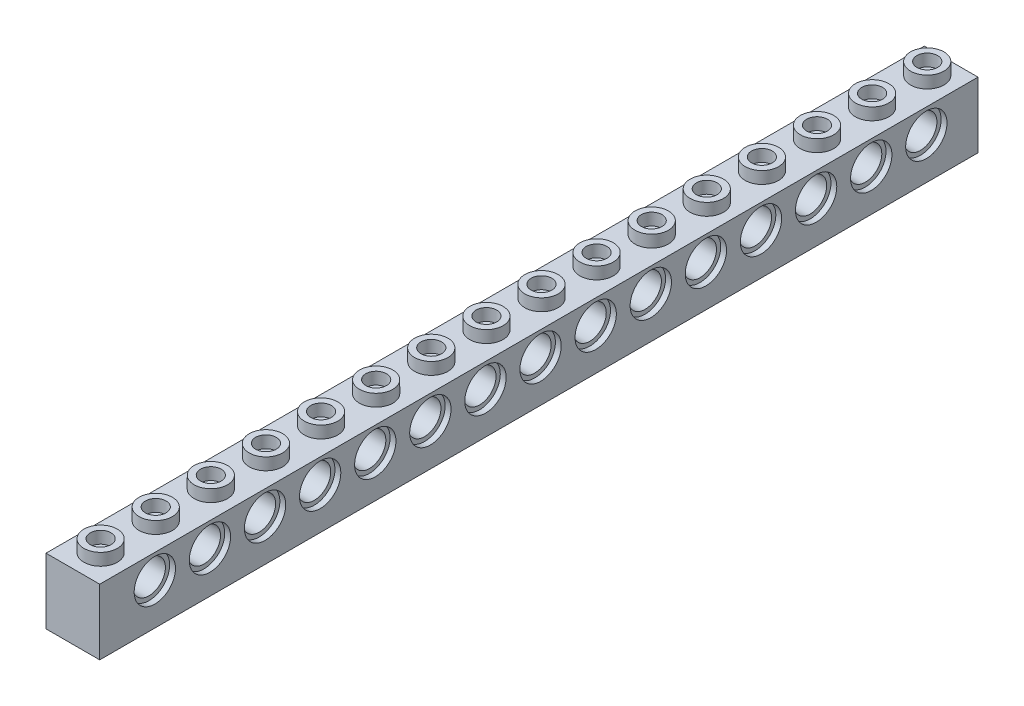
ISO-10303-21;
HEADER;
FILE_DESCRIPTION(('STEP AP214'),'2;1');
FILE_NAME('part.step','',(''),(''),'','','');
FILE_SCHEMA(('AUTOMOTIVE_DESIGN { 1 0 10303 214 1 1 1 1 }'));
ENDSEC;
DATA;
#1=APPLICATION_CONTEXT('core data for automotive mechanical design processes');
#2=APPLICATION_PROTOCOL_DEFINITION('international standard','automotive_design',2000,#1);
#3=PRODUCT_CONTEXT('',#1,'mechanical');
#4=PRODUCT('Part','Part','',(#3));
#5=PRODUCT_RELATED_PRODUCT_CATEGORY('part','',(#4));
#6=PRODUCT_DEFINITION_FORMATION('','',#4);
#7=PRODUCT_DEFINITION_CONTEXT('part definition',#1,'design');
#8=PRODUCT_DEFINITION('design','',#6,#7);
#9=PRODUCT_DEFINITION_SHAPE('','',#8);
#10=(LENGTH_UNIT() NAMED_UNIT(*) SI_UNIT(.MILLI.,.METRE.));
#11=(NAMED_UNIT(*) PLANE_ANGLE_UNIT() SI_UNIT($,.RADIAN.));
#12=(NAMED_UNIT(*) SI_UNIT($,.STERADIAN.) SOLID_ANGLE_UNIT());
#13=UNCERTAINTY_MEASURE_WITH_UNIT(LENGTH_MEASURE(1.E-05),#10,'distance_accuracy_value','');
#14=(GEOMETRIC_REPRESENTATION_CONTEXT(3) GLOBAL_UNCERTAINTY_ASSIGNED_CONTEXT((#13)) GLOBAL_UNIT_ASSIGNED_CONTEXT((#10,
#11,#12)) REPRESENTATION_CONTEXT('',''));
#15=CARTESIAN_POINT('',(0.,0.,0.));
#16=DIRECTION('',(0.,0.,1.));
#17=DIRECTION('',(1.,0.,0.));
#18=AXIS2_PLACEMENT_3D('',#15,#16,#17);
#19=CARTESIAN_POINT('',(3.9,4.76,127.5));
#20=DIRECTION('',(0.,-1.,0.));
#21=DIRECTION('',(1.,0.,0.));
#22=AXIS2_PLACEMENT_3D('',#19,#20,#21);
#23=PLANE('',#22);
#24=DIRECTION('',(-1.,0.,0.));
#25=VECTOR('',#24,1.);
#26=CARTESIAN_POINT('',(3.9,4.76,0.));
#27=LINE('',#26,#25);
#28=CARTESIAN_POINT('',(3.9,4.76,0.));
#29=VERTEX_POINT('',#28);
#30=CARTESIAN_POINT('',(-3.9,4.76,0.));
#31=VERTEX_POINT('',#30);
#32=EDGE_CURVE('E78',#29,#31,#27,.T.);
#33=ORIENTED_EDGE('',*,*,#32,.T.);
#34=DIRECTION('',(0.,0.,-1.));
#35=VECTOR('',#34,1.);
#36=CARTESIAN_POINT('',(-3.9,4.76,127.5));
#37=LINE('',#36,#35);
#38=CARTESIAN_POINT('',(-3.9,4.76,127.5));
#39=VERTEX_POINT('',#38);
#40=EDGE_CURVE('E462',#39,#31,#37,.T.);
#41=ORIENTED_EDGE('',*,*,#40,.F.);
#42=DIRECTION('',(-1.,0.,0.));
#43=VECTOR('',#42,1.);
#44=CARTESIAN_POINT('',(3.9,4.76,127.5));
#45=LINE('',#44,#43);
#46=CARTESIAN_POINT('',(3.9,4.76,127.5));
#47=VERTEX_POINT('',#46);
#48=EDGE_CURVE('E57',#47,#39,#45,.T.);
#49=ORIENTED_EDGE('',*,*,#48,.F.);
#50=DIRECTION('',(0.,0.,-1.));
#51=VECTOR('',#50,1.);
#52=CARTESIAN_POINT('',(3.9,4.76,127.5));
#53=LINE('',#52,#51);
#54=EDGE_CURVE('E471',#47,#29,#53,.T.);
#55=ORIENTED_EDGE('',*,*,#54,.T.);
#56=EDGE_LOOP('',(#33,#41,#49,#55));
#57=FACE_BOUND('',#56,.T.);
#58=CARTESIAN_POINT('',(0.,4.76,3.47));
#59=DIRECTION('',(0.,-1.,0.));
#60=DIRECTION('',(1.,0.,0.));
#61=AXIS2_PLACEMENT_3D('',#58,#59,#60);
#62=CIRCLE('',#61,2.425);
#63=CARTESIAN_POINT('',(2.425,4.76,3.47));
#64=VERTEX_POINT('',#63);
#65=EDGE_CURVE('E478',#64,#64,#62,.F.);
#66=ORIENTED_EDGE('',*,*,#65,.F.);
#67=EDGE_LOOP('',(#66));
#68=FACE_BOUND('',#67,.T.);
#69=CARTESIAN_POINT('',(0.,4.76,11.47));
#70=DIRECTION('',(0.,-1.,0.));
#71=DIRECTION('',(1.,0.,0.));
#72=AXIS2_PLACEMENT_3D('',#69,#70,#71);
#73=CIRCLE('',#72,2.425);
#74=CARTESIAN_POINT('',(2.425,4.76,11.47));
#75=VERTEX_POINT('',#74);
#76=EDGE_CURVE('E481',#75,#75,#73,.F.);
#77=ORIENTED_EDGE('',*,*,#76,.F.);
#78=EDGE_LOOP('',(#77));
#79=FACE_BOUND('',#78,.T.);
#80=CARTESIAN_POINT('',(0.,4.76,19.47));
#81=DIRECTION('',(0.,-1.,0.));
#82=DIRECTION('',(1.,0.,0.));
#83=AXIS2_PLACEMENT_3D('',#80,#81,#82);
#84=CIRCLE('',#83,2.425);
#85=CARTESIAN_POINT('',(2.425,4.76,19.47));
#86=VERTEX_POINT('',#85);
#87=EDGE_CURVE('E484',#86,#86,#84,.F.);
#88=ORIENTED_EDGE('',*,*,#87,.F.);
#89=EDGE_LOOP('',(#88));
#90=FACE_BOUND('',#89,.T.);
#91=CARTESIAN_POINT('',(0.,4.76,27.47));
#92=DIRECTION('',(0.,-1.,0.));
#93=DIRECTION('',(1.,0.,0.));
#94=AXIS2_PLACEMENT_3D('',#91,#92,#93);
#95=CIRCLE('',#94,2.425);
#96=CARTESIAN_POINT('',(2.425,4.76,27.47));
#97=VERTEX_POINT('',#96);
#98=EDGE_CURVE('E487',#97,#97,#95,.F.);
#99=ORIENTED_EDGE('',*,*,#98,.F.);
#100=EDGE_LOOP('',(#99));
#101=FACE_BOUND('',#100,.T.);
#102=CARTESIAN_POINT('',(0.,4.76,35.47));
#103=DIRECTION('',(0.,-1.,0.));
#104=DIRECTION('',(1.,0.,0.));
#105=AXIS2_PLACEMENT_3D('',#102,#103,#104);
#106=CIRCLE('',#105,2.425);
#107=CARTESIAN_POINT('',(2.425,4.76,35.47));
#108=VERTEX_POINT('',#107);
#109=EDGE_CURVE('E490',#108,#108,#106,.F.);
#110=ORIENTED_EDGE('',*,*,#109,.F.);
#111=EDGE_LOOP('',(#110));
#112=FACE_BOUND('',#111,.T.);
#113=CARTESIAN_POINT('',(0.,4.76,43.47));
#114=DIRECTION('',(0.,-1.,0.));
#115=DIRECTION('',(1.,0.,0.));
#116=AXIS2_PLACEMENT_3D('',#113,#114,#115);
#117=CIRCLE('',#116,2.425);
#118=CARTESIAN_POINT('',(2.425,4.76,43.47));
#119=VERTEX_POINT('',#118);
#120=EDGE_CURVE('E493',#119,#119,#117,.F.);
#121=ORIENTED_EDGE('',*,*,#120,.F.);
#122=EDGE_LOOP('',(#121));
#123=FACE_BOUND('',#122,.T.);
#124=CARTESIAN_POINT('',(0.,4.76,51.47));
#125=DIRECTION('',(0.,-1.,0.));
#126=DIRECTION('',(1.,0.,0.));
#127=AXIS2_PLACEMENT_3D('',#124,#125,#126);
#128=CIRCLE('',#127,2.425);
#129=CARTESIAN_POINT('',(2.425,4.76,51.47));
#130=VERTEX_POINT('',#129);
#131=EDGE_CURVE('E496',#130,#130,#128,.F.);
#132=ORIENTED_EDGE('',*,*,#131,.F.);
#133=EDGE_LOOP('',(#132));
#134=FACE_BOUND('',#133,.T.);
#135=CARTESIAN_POINT('',(0.,4.76,59.47));
#136=DIRECTION('',(0.,-1.,0.));
#137=DIRECTION('',(1.,0.,0.));
#138=AXIS2_PLACEMENT_3D('',#135,#136,#137);
#139=CIRCLE('',#138,2.425);
#140=CARTESIAN_POINT('',(2.425,4.76,59.47));
#141=VERTEX_POINT('',#140);
#142=EDGE_CURVE('E499',#141,#141,#139,.F.);
#143=ORIENTED_EDGE('',*,*,#142,.F.);
#144=EDGE_LOOP('',(#143));
#145=FACE_BOUND('',#144,.T.);
#146=CARTESIAN_POINT('',(0.,4.76,67.47));
#147=DIRECTION('',(0.,-1.,0.));
#148=DIRECTION('',(1.,0.,0.));
#149=AXIS2_PLACEMENT_3D('',#146,#147,#148);
#150=CIRCLE('',#149,2.425);
#151=CARTESIAN_POINT('',(2.425,4.76,67.47));
#152=VERTEX_POINT('',#151);
#153=EDGE_CURVE('E502',#152,#152,#150,.F.);
#154=ORIENTED_EDGE('',*,*,#153,.F.);
#155=EDGE_LOOP('',(#154));
#156=FACE_BOUND('',#155,.T.);
#157=CARTESIAN_POINT('',(0.,4.76,75.47));
#158=DIRECTION('',(0.,-1.,0.));
#159=DIRECTION('',(1.,0.,0.));
#160=AXIS2_PLACEMENT_3D('',#157,#158,#159);
#161=CIRCLE('',#160,2.425);
#162=CARTESIAN_POINT('',(2.425,4.76,75.47));
#163=VERTEX_POINT('',#162);
#164=EDGE_CURVE('E505',#163,#163,#161,.F.);
#165=ORIENTED_EDGE('',*,*,#164,.F.);
#166=EDGE_LOOP('',(#165));
#167=FACE_BOUND('',#166,.T.);
#168=CARTESIAN_POINT('',(0.,4.76,83.47));
#169=DIRECTION('',(0.,-1.,0.));
#170=DIRECTION('',(1.,0.,0.));
#171=AXIS2_PLACEMENT_3D('',#168,#169,#170);
#172=CIRCLE('',#171,2.425);
#173=CARTESIAN_POINT('',(2.425,4.76,83.47));
#174=VERTEX_POINT('',#173);
#175=EDGE_CURVE('E508',#174,#174,#172,.F.);
#176=ORIENTED_EDGE('',*,*,#175,.F.);
#177=EDGE_LOOP('',(#176));
#178=FACE_BOUND('',#177,.T.);
#179=CARTESIAN_POINT('',(0.,4.76,91.47));
#180=DIRECTION('',(0.,-1.,0.));
#181=DIRECTION('',(1.,0.,0.));
#182=AXIS2_PLACEMENT_3D('',#179,#180,#181);
#183=CIRCLE('',#182,2.425);
#184=CARTESIAN_POINT('',(2.425,4.76,91.47));
#185=VERTEX_POINT('',#184);
#186=EDGE_CURVE('E511',#185,#185,#183,.F.);
#187=ORIENTED_EDGE('',*,*,#186,.F.);
#188=EDGE_LOOP('',(#187));
#189=FACE_BOUND('',#188,.T.);
#190=CARTESIAN_POINT('',(0.,4.76,99.47));
#191=DIRECTION('',(0.,-1.,0.));
#192=DIRECTION('',(1.,0.,0.));
#193=AXIS2_PLACEMENT_3D('',#190,#191,#192);
#194=CIRCLE('',#193,2.425);
#195=CARTESIAN_POINT('',(2.425,4.76,99.47));
#196=VERTEX_POINT('',#195);
#197=EDGE_CURVE('E514',#196,#196,#194,.F.);
#198=ORIENTED_EDGE('',*,*,#197,.F.);
#199=EDGE_LOOP('',(#198));
#200=FACE_BOUND('',#199,.T.);
#201=CARTESIAN_POINT('',(0.,4.76,107.47));
#202=DIRECTION('',(0.,-1.,0.));
#203=DIRECTION('',(1.,0.,0.));
#204=AXIS2_PLACEMENT_3D('',#201,#202,#203);
#205=CIRCLE('',#204,2.425);
#206=CARTESIAN_POINT('',(2.425,4.76,107.47));
#207=VERTEX_POINT('',#206);
#208=EDGE_CURVE('E517',#207,#207,#205,.F.);
#209=ORIENTED_EDGE('',*,*,#208,.F.);
#210=EDGE_LOOP('',(#209));
#211=FACE_BOUND('',#210,.T.);
#212=CARTESIAN_POINT('',(0.,4.76,115.47));
#213=DIRECTION('',(0.,-1.,0.));
#214=DIRECTION('',(1.,0.,0.));
#215=AXIS2_PLACEMENT_3D('',#212,#213,#214);
#216=CIRCLE('',#215,2.425);
#217=CARTESIAN_POINT('',(2.425,4.76,115.47));
#218=VERTEX_POINT('',#217);
#219=EDGE_CURVE('E520',#218,#218,#216,.F.);
#220=ORIENTED_EDGE('',*,*,#219,.F.);
#221=EDGE_LOOP('',(#220));
#222=FACE_BOUND('',#221,.T.);
#223=CARTESIAN_POINT('',(0.,4.76,123.47));
#224=DIRECTION('',(0.,-1.,0.));
#225=DIRECTION('',(1.,0.,0.));
#226=AXIS2_PLACEMENT_3D('',#223,#224,#225);
#227=CIRCLE('',#226,2.425);
#228=CARTESIAN_POINT('',(2.425,4.76,123.47));
#229=VERTEX_POINT('',#228);
#230=EDGE_CURVE('E523',#229,#229,#227,.F.);
#231=ORIENTED_EDGE('',*,*,#230,.F.);
#232=EDGE_LOOP('',(#231));
#233=FACE_BOUND('',#232,.T.);
#234=ADVANCED_FACE('F33',(#57,#68,#79,#90,#101,#112,#123,#134,#145,#156,#167,#178,#189,#200,
#211,#222,#233),#23,.F.);
#235=CARTESIAN_POINT('',(-3.9,-4.76,127.5));
#236=DIRECTION('',(1.,0.,0.));
#237=DIRECTION('',(0.,0.,-1.));
#238=AXIS2_PLACEMENT_3D('',#235,#236,#237);
#239=PLANE('',#238);
#240=CARTESIAN_POINT('',(-3.9,1.26,119.5));
#241=DIRECTION('',(-1.,0.,0.));
#242=DIRECTION('',(0.,0.,1.));
#243=AXIS2_PLACEMENT_3D('',#240,#241,#242);
#244=CIRCLE('',#243,3.);
#245=CARTESIAN_POINT('',(-3.9,1.26,122.5));
#246=VERTEX_POINT('',#245);
#247=EDGE_CURVE('E209',#246,#246,#244,.T.);
#248=ORIENTED_EDGE('',*,*,#247,.F.);
#249=EDGE_LOOP('',(#248));
#250=FACE_BOUND('',#249,.T.);
#251=CARTESIAN_POINT('',(-3.9,1.26,111.5));
#252=DIRECTION('',(-1.,0.,0.));
#253=DIRECTION('',(0.,0.,1.));
#254=AXIS2_PLACEMENT_3D('',#251,#252,#253);
#255=CIRCLE('',#254,3.);
#256=CARTESIAN_POINT('',(-3.9,1.26,114.5));
#257=VERTEX_POINT('',#256);
#258=EDGE_CURVE('E208',#257,#257,#255,.T.);
#259=ORIENTED_EDGE('',*,*,#258,.F.);
#260=EDGE_LOOP('',(#259));
#261=FACE_BOUND('',#260,.T.);
#262=CARTESIAN_POINT('',(-3.9,1.26,103.5));
#263=DIRECTION('',(-1.,0.,0.));
#264=DIRECTION('',(0.,0.,1.));
#265=AXIS2_PLACEMENT_3D('',#262,#263,#264);
#266=CIRCLE('',#265,3.);
#267=CARTESIAN_POINT('',(-3.9,1.26,106.5));
#268=VERTEX_POINT('',#267);
#269=EDGE_CURVE('E215',#268,#268,#266,.T.);
#270=ORIENTED_EDGE('',*,*,#269,.F.);
#271=EDGE_LOOP('',(#270));
#272=FACE_BOUND('',#271,.T.);
#273=CARTESIAN_POINT('',(-3.9,1.26,95.5));
#274=DIRECTION('',(-1.,0.,0.));
#275=DIRECTION('',(0.,0.,1.));
#276=AXIS2_PLACEMENT_3D('',#273,#274,#275);
#277=CIRCLE('',#276,3.);
#278=CARTESIAN_POINT('',(-3.9,1.26,98.5));
#279=VERTEX_POINT('',#278);
#280=EDGE_CURVE('E221',#279,#279,#277,.T.);
#281=ORIENTED_EDGE('',*,*,#280,.F.);
#282=EDGE_LOOP('',(#281));
#283=FACE_BOUND('',#282,.T.);
#284=CARTESIAN_POINT('',(-3.9,1.26,87.5));
#285=DIRECTION('',(-1.,0.,0.));
#286=DIRECTION('',(0.,0.,1.));
#287=AXIS2_PLACEMENT_3D('',#284,#285,#286);
#288=CIRCLE('',#287,3.);
#289=CARTESIAN_POINT('',(-3.9,1.26,90.5));
#290=VERTEX_POINT('',#289);
#291=EDGE_CURVE('E227',#290,#290,#288,.T.);
#292=ORIENTED_EDGE('',*,*,#291,.F.);
#293=EDGE_LOOP('',(#292));
#294=FACE_BOUND('',#293,.T.);
#295=CARTESIAN_POINT('',(-3.9,1.26,79.5));
#296=DIRECTION('',(-1.,0.,0.));
#297=DIRECTION('',(0.,0.,1.));
#298=AXIS2_PLACEMENT_3D('',#295,#296,#297);
#299=CIRCLE('',#298,3.);
#300=CARTESIAN_POINT('',(-3.9,1.26,82.5));
#301=VERTEX_POINT('',#300);
#302=EDGE_CURVE('E233',#301,#301,#299,.T.);
#303=ORIENTED_EDGE('',*,*,#302,.F.);
#304=EDGE_LOOP('',(#303));
#305=FACE_BOUND('',#304,.T.);
#306=CARTESIAN_POINT('',(-3.9,1.26,71.5));
#307=DIRECTION('',(-1.,0.,0.));
#308=DIRECTION('',(0.,0.,1.));
#309=AXIS2_PLACEMENT_3D('',#306,#307,#308);
#310=CIRCLE('',#309,3.);
#311=CARTESIAN_POINT('',(-3.9,1.26,74.5));
#312=VERTEX_POINT('',#311);
#313=EDGE_CURVE('E239',#312,#312,#310,.T.);
#314=ORIENTED_EDGE('',*,*,#313,.F.);
#315=EDGE_LOOP('',(#314));
#316=FACE_BOUND('',#315,.T.);
#317=CARTESIAN_POINT('',(-3.9,1.26,63.5));
#318=DIRECTION('',(-1.,0.,0.));
#319=DIRECTION('',(0.,0.,1.));
#320=AXIS2_PLACEMENT_3D('',#317,#318,#319);
#321=CIRCLE('',#320,3.);
#322=CARTESIAN_POINT('',(-3.9,1.26,66.5));
#323=VERTEX_POINT('',#322);
#324=EDGE_CURVE('E245',#323,#323,#321,.T.);
#325=ORIENTED_EDGE('',*,*,#324,.F.);
#326=EDGE_LOOP('',(#325));
#327=FACE_BOUND('',#326,.T.);
#328=CARTESIAN_POINT('',(-3.9,1.26,55.5));
#329=DIRECTION('',(-1.,0.,0.));
#330=DIRECTION('',(0.,0.,1.));
#331=AXIS2_PLACEMENT_3D('',#328,#329,#330);
#332=CIRCLE('',#331,3.);
#333=CARTESIAN_POINT('',(-3.9,1.26,58.5));
#334=VERTEX_POINT('',#333);
#335=EDGE_CURVE('E251',#334,#334,#332,.T.);
#336=ORIENTED_EDGE('',*,*,#335,.F.);
#337=EDGE_LOOP('',(#336));
#338=FACE_BOUND('',#337,.T.);
#339=CARTESIAN_POINT('',(-3.9,1.26,47.5));
#340=DIRECTION('',(-1.,0.,0.));
#341=DIRECTION('',(0.,0.,1.));
#342=AXIS2_PLACEMENT_3D('',#339,#340,#341);
#343=CIRCLE('',#342,3.);
#344=CARTESIAN_POINT('',(-3.9,1.26,50.5));
#345=VERTEX_POINT('',#344);
#346=EDGE_CURVE('E257',#345,#345,#343,.T.);
#347=ORIENTED_EDGE('',*,*,#346,.F.);
#348=EDGE_LOOP('',(#347));
#349=FACE_BOUND('',#348,.T.);
#350=CARTESIAN_POINT('',(-3.9,1.26,39.5));
#351=DIRECTION('',(-1.,0.,0.));
#352=DIRECTION('',(0.,0.,1.));
#353=AXIS2_PLACEMENT_3D('',#350,#351,#352);
#354=CIRCLE('',#353,3.);
#355=CARTESIAN_POINT('',(-3.9,1.26,42.5));
#356=VERTEX_POINT('',#355);
#357=EDGE_CURVE('E263',#356,#356,#354,.T.);
#358=ORIENTED_EDGE('',*,*,#357,.F.);
#359=EDGE_LOOP('',(#358));
#360=FACE_BOUND('',#359,.T.);
#361=CARTESIAN_POINT('',(-3.9,1.26,31.5));
#362=DIRECTION('',(-1.,0.,0.));
#363=DIRECTION('',(0.,0.,1.));
#364=AXIS2_PLACEMENT_3D('',#361,#362,#363);
#365=CIRCLE('',#364,3.);
#366=CARTESIAN_POINT('',(-3.9,1.26,34.5));
#367=VERTEX_POINT('',#366);
#368=EDGE_CURVE('E269',#367,#367,#365,.T.);
#369=ORIENTED_EDGE('',*,*,#368,.F.);
#370=EDGE_LOOP('',(#369));
#371=FACE_BOUND('',#370,.T.);
#372=CARTESIAN_POINT('',(-3.9,1.26,23.5));
#373=DIRECTION('',(-1.,0.,0.));
#374=DIRECTION('',(0.,0.,1.));
#375=AXIS2_PLACEMENT_3D('',#372,#373,#374);
#376=CIRCLE('',#375,3.);
#377=CARTESIAN_POINT('',(-3.9,1.26,26.5));
#378=VERTEX_POINT('',#377);
#379=EDGE_CURVE('E275',#378,#378,#376,.T.);
#380=ORIENTED_EDGE('',*,*,#379,.F.);
#381=EDGE_LOOP('',(#380));
#382=FACE_BOUND('',#381,.T.);
#383=CARTESIAN_POINT('',(-3.9,1.26,15.5));
#384=DIRECTION('',(-1.,0.,0.));
#385=DIRECTION('',(0.,0.,1.));
#386=AXIS2_PLACEMENT_3D('',#383,#384,#385);
#387=CIRCLE('',#386,3.);
#388=CARTESIAN_POINT('',(-3.9,1.26,18.5));
#389=VERTEX_POINT('',#388);
#390=EDGE_CURVE('E281',#389,#389,#387,.T.);
#391=ORIENTED_EDGE('',*,*,#390,.F.);
#392=EDGE_LOOP('',(#391));
#393=FACE_BOUND('',#392,.T.);
#394=CARTESIAN_POINT('',(-3.9,1.26,7.50000000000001));
#395=DIRECTION('',(-1.,0.,0.));
#396=DIRECTION('',(0.,0.,1.));
#397=AXIS2_PLACEMENT_3D('',#394,#395,#396);
#398=CIRCLE('',#397,3.);
#399=CARTESIAN_POINT('',(-3.9,1.26,10.5));
#400=VERTEX_POINT('',#399);
#401=EDGE_CURVE('E303',#400,#400,#398,.T.);
#402=ORIENTED_EDGE('',*,*,#401,.F.);
#403=EDGE_LOOP('',(#402));
#404=FACE_BOUND('',#403,.T.);
#405=DIRECTION('',(0.,-1.,0.));
#406=VECTOR('',#405,1.);
#407=CARTESIAN_POINT('',(-3.9,-4.76,0.));
#408=LINE('',#407,#406);
#409=CARTESIAN_POINT('',(-3.9,-4.76,0.));
#410=VERTEX_POINT('',#409);
#411=EDGE_CURVE('E455',#31,#410,#408,.T.);
#412=ORIENTED_EDGE('',*,*,#411,.T.);
#413=DIRECTION('',(0.,0.,-1.));
#414=VECTOR('',#413,1.);
#415=CARTESIAN_POINT('',(-3.9,-4.76,127.5));
#416=LINE('',#415,#414);
#417=CARTESIAN_POINT('',(-3.9,-4.76,127.5));
#418=VERTEX_POINT('',#417);
#419=EDGE_CURVE('E476',#418,#410,#416,.T.);
#420=ORIENTED_EDGE('',*,*,#419,.F.);
#421=DIRECTION('',(0.,-1.,0.));
#422=VECTOR('',#421,1.);
#423=CARTESIAN_POINT('',(-3.9,-4.76,127.5));
#424=LINE('',#423,#422);
#425=EDGE_CURVE('E456',#39,#418,#424,.T.);
#426=ORIENTED_EDGE('',*,*,#425,.F.);
#427=ORIENTED_EDGE('',*,*,#40,.T.);
#428=EDGE_LOOP('',(#412,#420,#426,#427));
#429=FACE_BOUND('',#428,.T.);
#430=ADVANCED_FACE('F774',(#250,#261,#272,#283,#294,#305,#316,#327,#338,#349,#360,#371,#382,
#393,#404,#429),#239,.F.);
#431=CARTESIAN_POINT('',(3.9,-4.76,127.5));
#432=DIRECTION('',(0.,1.,0.));
#433=DIRECTION('',(-1.,0.,0.));
#434=AXIS2_PLACEMENT_3D('',#431,#432,#433);
#435=PLANE('',#434);
#436=DIRECTION('',(1.,0.,0.));
#437=VECTOR('',#436,1.);
#438=CARTESIAN_POINT('',(-2.44999999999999,-4.76,1.45));
#439=LINE('',#438,#437);
#440=CARTESIAN_POINT('',(-2.44999999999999,-4.76,1.45));
#441=VERTEX_POINT('',#440);
#442=CARTESIAN_POINT('',(2.45000000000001,-4.76,1.45000000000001));
#443=VERTEX_POINT('',#442);
#444=EDGE_CURVE('E140',#441,#443,#439,.T.);
#445=ORIENTED_EDGE('',*,*,#444,.F.);
#446=DIRECTION('',(0.,0.,-1.));
#447=VECTOR('',#446,1.);
#448=CARTESIAN_POINT('',(-2.45,-4.76,126.05));
#449=LINE('',#448,#447);
#450=CARTESIAN_POINT('',(-2.45,-4.76,126.05));
#451=VERTEX_POINT('',#450);
#452=EDGE_CURVE('E48',#451,#441,#449,.T.);
#453=ORIENTED_EDGE('',*,*,#452,.F.);
#454=DIRECTION('',(-1.,0.,0.));
#455=VECTOR('',#454,1.);
#456=CARTESIAN_POINT('',(-2.45,-4.76,126.05));
#457=LINE('',#456,#455);
#458=CARTESIAN_POINT('',(2.45,-4.76,126.05));
#459=VERTEX_POINT('',#458);
#460=EDGE_CURVE('E128',#459,#451,#457,.T.);
#461=ORIENTED_EDGE('',*,*,#460,.F.);
#462=DIRECTION('',(0.,0.,1.));
#463=VECTOR('',#462,1.);
#464=CARTESIAN_POINT('',(2.45,-4.76,126.05));
#465=LINE('',#464,#463);
#466=EDGE_CURVE('E131',#443,#459,#465,.T.);
#467=ORIENTED_EDGE('',*,*,#466,.F.);
#468=EDGE_LOOP('',(#445,#453,#461,#467));
#469=FACE_BOUND('',#468,.T.);
#470=DIRECTION('',(1.,0.,0.));
#471=VECTOR('',#470,1.);
#472=CARTESIAN_POINT('',(3.9,-4.76,0.));
#473=LINE('',#472,#471);
#474=CARTESIAN_POINT('',(3.9,-4.76,0.));
#475=VERTEX_POINT('',#474);
#476=EDGE_CURVE('E465',#410,#475,#473,.T.);
#477=ORIENTED_EDGE('',*,*,#476,.T.);
#478=DIRECTION('',(0.,0.,-1.));
#479=VECTOR('',#478,1.);
#480=CARTESIAN_POINT('',(3.9,-4.76,127.5));
#481=LINE('',#480,#479);
#482=CARTESIAN_POINT('',(3.9,-4.76,127.5));
#483=VERTEX_POINT('',#482);
#484=EDGE_CURVE('E473',#483,#475,#481,.T.);
#485=ORIENTED_EDGE('',*,*,#484,.F.);
#486=DIRECTION('',(1.,0.,0.));
#487=VECTOR('',#486,1.);
#488=CARTESIAN_POINT('',(3.9,-4.76,127.5));
#489=LINE('',#488,#487);
#490=EDGE_CURVE('E86',#418,#483,#489,.T.);
#491=ORIENTED_EDGE('',*,*,#490,.F.);
#492=ORIENTED_EDGE('',*,*,#419,.T.);
#493=EDGE_LOOP('',(#477,#485,#491,#492));
#494=FACE_BOUND('',#493,.T.);
#495=ADVANCED_FACE('F781',(#469,#494),#435,.F.);
#496=CARTESIAN_POINT('',(3.9,-4.76,127.5));
#497=DIRECTION('',(-1.,0.,0.));
#498=DIRECTION('',(0.,0.,1.));
#499=AXIS2_PLACEMENT_3D('',#496,#497,#498);
#500=PLANE('',#499);
#501=CARTESIAN_POINT('',(3.9,1.26,15.5));
#502=DIRECTION('',(1.,0.,0.));
#503=DIRECTION('',(0.,0.,-1.));
#504=AXIS2_PLACEMENT_3D('',#501,#502,#503);
#505=CIRCLE('',#504,3.);
#506=CARTESIAN_POINT('',(3.9,1.26,12.5));
#507=VERTEX_POINT('',#506);
#508=EDGE_CURVE('E287',#507,#507,#505,.T.);
#509=ORIENTED_EDGE('',*,*,#508,.F.);
#510=EDGE_LOOP('',(#509));
#511=FACE_BOUND('',#510,.T.);
#512=CARTESIAN_POINT('',(3.9,1.26,7.50000000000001));
#513=DIRECTION('',(1.,0.,0.));
#514=DIRECTION('',(0.,0.,-1.));
#515=AXIS2_PLACEMENT_3D('',#512,#513,#514);
#516=CIRCLE('',#515,3.);
#517=CARTESIAN_POINT('',(3.9,1.26,4.50000000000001));
#518=VERTEX_POINT('',#517);
#519=EDGE_CURVE('E302',#518,#518,#516,.T.);
#520=ORIENTED_EDGE('',*,*,#519,.F.);
#521=EDGE_LOOP('',(#520));
#522=FACE_BOUND('',#521,.T.);
#523=DIRECTION('',(0.,1.,0.));
#524=VECTOR('',#523,1.);
#525=CARTESIAN_POINT('',(3.9,-4.76,0.));
#526=LINE('',#525,#524);
#527=EDGE_CURVE('E467',#475,#29,#526,.T.);
#528=ORIENTED_EDGE('',*,*,#527,.T.);
#529=ORIENTED_EDGE('',*,*,#54,.F.);
#530=DIRECTION('',(0.,1.,0.));
#531=VECTOR('',#530,1.);
#532=CARTESIAN_POINT('',(3.9,-4.76,127.5));
#533=LINE('',#532,#531);
#534=EDGE_CURVE('E459',#483,#47,#533,.T.);
#535=ORIENTED_EDGE('',*,*,#534,.F.);
#536=ORIENTED_EDGE('',*,*,#484,.T.);
#537=EDGE_LOOP('',(#528,#529,#535,#536));
#538=FACE_BOUND('',#537,.T.);
#539=CARTESIAN_POINT('',(3.9,1.26,23.5));
#540=DIRECTION('',(1.,0.,0.));
#541=DIRECTION('',(0.,0.,-1.));
#542=AXIS2_PLACEMENT_3D('',#539,#540,#541);
#543=CIRCLE('',#542,3.);
#544=CARTESIAN_POINT('',(3.9,1.26,20.5));
#545=VERTEX_POINT('',#544);
#546=EDGE_CURVE('E526',#545,#545,#543,.T.);
#547=ORIENTED_EDGE('',*,*,#546,.F.);
#548=EDGE_LOOP('',(#547));
#549=FACE_BOUND('',#548,.T.);
#550=CARTESIAN_POINT('',(3.9,1.26,31.5));
#551=DIRECTION('',(1.,0.,0.));
#552=DIRECTION('',(0.,0.,-1.));
#553=AXIS2_PLACEMENT_3D('',#550,#551,#552);
#554=CIRCLE('',#553,3.);
#555=CARTESIAN_POINT('',(3.9,1.26,28.5));
#556=VERTEX_POINT('',#555);
#557=EDGE_CURVE('E534',#556,#556,#554,.T.);
#558=ORIENTED_EDGE('',*,*,#557,.F.);
#559=EDGE_LOOP('',(#558));
#560=FACE_BOUND('',#559,.T.);
#561=CARTESIAN_POINT('',(3.9,1.26,39.5));
#562=DIRECTION('',(1.,0.,0.));
#563=DIRECTION('',(0.,0.,-1.));
#564=AXIS2_PLACEMENT_3D('',#561,#562,#563);
#565=CIRCLE('',#564,3.);
#566=CARTESIAN_POINT('',(3.9,1.26,36.5));
#567=VERTEX_POINT('',#566);
#568=EDGE_CURVE('E540',#567,#567,#565,.T.);
#569=ORIENTED_EDGE('',*,*,#568,.F.);
#570=EDGE_LOOP('',(#569));
#571=FACE_BOUND('',#570,.T.);
#572=CARTESIAN_POINT('',(3.9,1.26,47.5));
#573=DIRECTION('',(1.,0.,0.));
#574=DIRECTION('',(0.,0.,-1.));
#575=AXIS2_PLACEMENT_3D('',#572,#573,#574);
#576=CIRCLE('',#575,3.);
#577=CARTESIAN_POINT('',(3.9,1.26,44.5));
#578=VERTEX_POINT('',#577);
#579=EDGE_CURVE('E546',#578,#578,#576,.T.);
#580=ORIENTED_EDGE('',*,*,#579,.F.);
#581=EDGE_LOOP('',(#580));
#582=FACE_BOUND('',#581,.T.);
#583=CARTESIAN_POINT('',(3.9,1.26,55.5));
#584=DIRECTION('',(1.,0.,0.));
#585=DIRECTION('',(0.,0.,-1.));
#586=AXIS2_PLACEMENT_3D('',#583,#584,#585);
#587=CIRCLE('',#586,3.);
#588=CARTESIAN_POINT('',(3.9,1.26,52.5));
#589=VERTEX_POINT('',#588);
#590=EDGE_CURVE('E552',#589,#589,#587,.T.);
#591=ORIENTED_EDGE('',*,*,#590,.F.);
#592=EDGE_LOOP('',(#591));
#593=FACE_BOUND('',#592,.T.);
#594=CARTESIAN_POINT('',(3.9,1.26,63.5));
#595=DIRECTION('',(1.,0.,0.));
#596=DIRECTION('',(0.,0.,-1.));
#597=AXIS2_PLACEMENT_3D('',#594,#595,#596);
#598=CIRCLE('',#597,3.);
#599=CARTESIAN_POINT('',(3.9,1.26,60.5));
#600=VERTEX_POINT('',#599);
#601=EDGE_CURVE('E558',#600,#600,#598,.T.);
#602=ORIENTED_EDGE('',*,*,#601,.F.);
#603=EDGE_LOOP('',(#602));
#604=FACE_BOUND('',#603,.T.);
#605=CARTESIAN_POINT('',(3.9,1.26,71.5));
#606=DIRECTION('',(1.,0.,0.));
#607=DIRECTION('',(0.,0.,-1.));
#608=AXIS2_PLACEMENT_3D('',#605,#606,#607);
#609=CIRCLE('',#608,3.);
#610=CARTESIAN_POINT('',(3.9,1.26,68.5));
#611=VERTEX_POINT('',#610);
#612=EDGE_CURVE('E564',#611,#611,#609,.T.);
#613=ORIENTED_EDGE('',*,*,#612,.F.);
#614=EDGE_LOOP('',(#613));
#615=FACE_BOUND('',#614,.T.);
#616=CARTESIAN_POINT('',(3.9,1.26,79.5));
#617=DIRECTION('',(1.,0.,0.));
#618=DIRECTION('',(0.,0.,-1.));
#619=AXIS2_PLACEMENT_3D('',#616,#617,#618);
#620=CIRCLE('',#619,3.);
#621=CARTESIAN_POINT('',(3.9,1.26,76.5));
#622=VERTEX_POINT('',#621);
#623=EDGE_CURVE('E570',#622,#622,#620,.T.);
#624=ORIENTED_EDGE('',*,*,#623,.F.);
#625=EDGE_LOOP('',(#624));
#626=FACE_BOUND('',#625,.T.);
#627=CARTESIAN_POINT('',(3.9,1.26,87.5));
#628=DIRECTION('',(1.,0.,0.));
#629=DIRECTION('',(0.,0.,-1.));
#630=AXIS2_PLACEMENT_3D('',#627,#628,#629);
#631=CIRCLE('',#630,3.);
#632=CARTESIAN_POINT('',(3.9,1.26,84.5));
#633=VERTEX_POINT('',#632);
#634=EDGE_CURVE('E576',#633,#633,#631,.T.);
#635=ORIENTED_EDGE('',*,*,#634,.F.);
#636=EDGE_LOOP('',(#635));
#637=FACE_BOUND('',#636,.T.);
#638=CARTESIAN_POINT('',(3.9,1.26,95.5));
#639=DIRECTION('',(1.,0.,0.));
#640=DIRECTION('',(0.,0.,-1.));
#641=AXIS2_PLACEMENT_3D('',#638,#639,#640);
#642=CIRCLE('',#641,3.);
#643=CARTESIAN_POINT('',(3.9,1.26,92.5));
#644=VERTEX_POINT('',#643);
#645=EDGE_CURVE('E582',#644,#644,#642,.T.);
#646=ORIENTED_EDGE('',*,*,#645,.F.);
#647=EDGE_LOOP('',(#646));
#648=FACE_BOUND('',#647,.T.);
#649=CARTESIAN_POINT('',(3.9,1.26,103.5));
#650=DIRECTION('',(1.,0.,0.));
#651=DIRECTION('',(0.,0.,-1.));
#652=AXIS2_PLACEMENT_3D('',#649,#650,#651);
#653=CIRCLE('',#652,3.);
#654=CARTESIAN_POINT('',(3.9,1.26,100.5));
#655=VERTEX_POINT('',#654);
#656=EDGE_CURVE('E588',#655,#655,#653,.T.);
#657=ORIENTED_EDGE('',*,*,#656,.F.);
#658=EDGE_LOOP('',(#657));
#659=FACE_BOUND('',#658,.T.);
#660=CARTESIAN_POINT('',(3.9,1.26,111.5));
#661=DIRECTION('',(1.,0.,0.));
#662=DIRECTION('',(0.,0.,-1.));
#663=AXIS2_PLACEMENT_3D('',#660,#661,#662);
#664=CIRCLE('',#663,3.);
#665=CARTESIAN_POINT('',(3.9,1.26,108.5));
#666=VERTEX_POINT('',#665);
#667=EDGE_CURVE('E594',#666,#666,#664,.T.);
#668=ORIENTED_EDGE('',*,*,#667,.F.);
#669=EDGE_LOOP('',(#668));
#670=FACE_BOUND('',#669,.T.);
#671=CARTESIAN_POINT('',(3.9,1.26,119.5));
#672=DIRECTION('',(1.,0.,0.));
#673=DIRECTION('',(0.,0.,-1.));
#674=AXIS2_PLACEMENT_3D('',#671,#672,#673);
#675=CIRCLE('',#674,3.);
#676=CARTESIAN_POINT('',(3.9,1.26,116.5));
#677=VERTEX_POINT('',#676);
#678=EDGE_CURVE('E600',#677,#677,#675,.T.);
#679=ORIENTED_EDGE('',*,*,#678,.F.);
#680=EDGE_LOOP('',(#679));
#681=FACE_BOUND('',#680,.T.);
#682=ADVANCED_FACE('F1059',(#511,#522,#538,#549,#560,#571,#582,#593,#604,#615,#626,#637,#648,
#659,#670,#681),#500,.F.);
#683=CARTESIAN_POINT('',(-3.9,4.76,127.5));
#684=DIRECTION('',(0.,0.,1.));
#685=DIRECTION('',(1.,0.,0.));
#686=AXIS2_PLACEMENT_3D('',#683,#684,#685);
#687=PLANE('',#686);
#688=ORIENTED_EDGE('',*,*,#425,.T.);
#689=ORIENTED_EDGE('',*,*,#490,.T.);
#690=ORIENTED_EDGE('',*,*,#534,.T.);
#691=ORIENTED_EDGE('',*,*,#48,.T.);
#692=EDGE_LOOP('',(#688,#689,#690,#691));
#693=FACE_BOUND('',#692,.T.);
#694=ADVANCED_FACE('F1057',(#693),#687,.T.);
#695=CARTESIAN_POINT('',(-3.9,4.76,0.));
#696=DIRECTION('',(0.,0.,1.));
#697=DIRECTION('',(1.,0.,0.));
#698=AXIS2_PLACEMENT_3D('',#695,#696,#697);
#699=PLANE('',#698);
#700=ORIENTED_EDGE('',*,*,#411,.F.);
#701=ORIENTED_EDGE('',*,*,#32,.F.);
#702=ORIENTED_EDGE('',*,*,#527,.F.);
#703=ORIENTED_EDGE('',*,*,#476,.F.);
#704=EDGE_LOOP('',(#700,#701,#702,#703));
#705=FACE_BOUND('',#704,.T.);
#706=ADVANCED_FACE('F1052',(#705),#699,.F.);
#707=CARTESIAN_POINT('',(0.,6.51,3.47));
#708=DIRECTION('',(0.,1.,0.));
#709=DIRECTION('',(-1.,0.,0.));
#710=AXIS2_PLACEMENT_3D('',#707,#708,#709);
#711=PLANE('',#710);
#712=CARTESIAN_POINT('',(0.,6.51,3.47));
#713=DIRECTION('',(0.,1.,0.));
#714=DIRECTION('',(-1.,0.,0.));
#715=AXIS2_PLACEMENT_3D('',#712,#713,#714);
#716=CIRCLE('',#715,2.425);
#717=CARTESIAN_POINT('',(-2.425,6.51,3.47));
#718=VERTEX_POINT('',#717);
#719=EDGE_CURVE('E450',#718,#718,#716,.T.);
#720=ORIENTED_EDGE('',*,*,#719,.T.);
#721=EDGE_LOOP('',(#720));
#722=FACE_BOUND('',#721,.T.);
#723=CARTESIAN_POINT('',(0.,6.51,3.47));
#724=DIRECTION('',(0.,1.,0.));
#725=DIRECTION('',(-1.,0.,0.));
#726=AXIS2_PLACEMENT_3D('',#723,#724,#725);
#727=CIRCLE('',#726,1.5);
#728=CARTESIAN_POINT('',(-1.5,6.51,3.47));
#729=VERTEX_POINT('',#728);
#730=EDGE_CURVE('E447',#729,#729,#727,.T.);
#731=ORIENTED_EDGE('',*,*,#730,.F.);
#732=EDGE_LOOP('',(#731));
#733=FACE_BOUND('',#732,.T.);
#734=ADVANCED_FACE('F1049',(#722,#733),#711,.T.);
#735=CARTESIAN_POINT('',(0.,6.51,3.47));
#736=DIRECTION('',(0.,-1.,0.));
#737=DIRECTION('',(1.,0.,0.));
#738=AXIS2_PLACEMENT_3D('',#735,#736,#737);
#739=CYLINDRICAL_SURFACE('',#738,2.425);
#740=ORIENTED_EDGE('',*,*,#719,.F.);
#741=EDGE_LOOP('',(#740));
#742=FACE_BOUND('',#741,.T.);
#743=ORIENTED_EDGE('',*,*,#65,.T.);
#744=EDGE_LOOP('',(#743));
#745=FACE_BOUND('',#744,.T.);
#746=ADVANCED_FACE('F804',(#742,#745),#739,.T.);
#747=CARTESIAN_POINT('',(0.,6.51,3.47));
#748=DIRECTION('',(0.,-1.,0.));
#749=DIRECTION('',(1.,0.,0.));
#750=AXIS2_PLACEMENT_3D('',#747,#748,#749);
#751=CYLINDRICAL_SURFACE('',#750,1.5);
#752=ORIENTED_EDGE('',*,*,#730,.T.);
#753=EDGE_LOOP('',(#752));
#754=FACE_BOUND('',#753,.T.);
#755=CARTESIAN_POINT('',(0.,4.76,3.47));
#756=DIRECTION('',(0.,1.,0.));
#757=DIRECTION('',(-1.,0.,0.));
#758=AXIS2_PLACEMENT_3D('',#755,#756,#757);
#759=CIRCLE('',#758,1.5);
#760=CARTESIAN_POINT('',(-1.5,4.76,3.47));
#761=VERTEX_POINT('',#760);
#762=EDGE_CURVE('E446',#761,#761,#759,.T.);
#763=ORIENTED_EDGE('',*,*,#762,.F.);
#764=EDGE_LOOP('',(#763));
#765=FACE_BOUND('',#764,.T.);
#766=ADVANCED_FACE('F794',(#754,#765),#751,.F.);
#767=ORIENTED_EDGE('',*,*,#762,.T.);
#768=EDGE_LOOP('',(#767));
#769=FACE_BOUND('',#768,.T.);
#770=ADVANCED_FACE('F777',(#769),#23,.F.);
#771=CARTESIAN_POINT('',(0.,6.51,11.47));
#772=DIRECTION('',(0.,1.,0.));
#773=DIRECTION('',(-1.,0.,0.));
#774=AXIS2_PLACEMENT_3D('',#771,#772,#773);
#775=PLANE('',#774);
#776=CARTESIAN_POINT('',(0.,6.51,11.47));
#777=DIRECTION('',(0.,1.,0.));
#778=DIRECTION('',(-1.,0.,0.));
#779=AXIS2_PLACEMENT_3D('',#776,#777,#778);
#780=CIRCLE('',#779,2.425);
#781=CARTESIAN_POINT('',(-2.425,6.51,11.47));
#782=VERTEX_POINT('',#781);
#783=EDGE_CURVE('E441',#782,#782,#780,.T.);
#784=ORIENTED_EDGE('',*,*,#783,.T.);
#785=EDGE_LOOP('',(#784));
#786=FACE_BOUND('',#785,.T.);
#787=CARTESIAN_POINT('',(0.,6.51,11.47));
#788=DIRECTION('',(0.,1.,0.));
#789=DIRECTION('',(-1.,0.,0.));
#790=AXIS2_PLACEMENT_3D('',#787,#788,#789);
#791=CIRCLE('',#790,1.5);
#792=CARTESIAN_POINT('',(-1.5,6.51,11.47));
#793=VERTEX_POINT('',#792);
#794=EDGE_CURVE('E438',#793,#793,#791,.T.);
#795=ORIENTED_EDGE('',*,*,#794,.F.);
#796=EDGE_LOOP('',(#795));
#797=FACE_BOUND('',#796,.T.);
#798=ADVANCED_FACE('F793',(#786,#797),#775,.T.);
#799=CARTESIAN_POINT('',(0.,6.51,11.47));
#800=DIRECTION('',(0.,-1.,0.));
#801=DIRECTION('',(1.,0.,0.));
#802=AXIS2_PLACEMENT_3D('',#799,#800,#801);
#803=CYLINDRICAL_SURFACE('',#802,2.425);
#804=ORIENTED_EDGE('',*,*,#783,.F.);
#805=EDGE_LOOP('',(#804));
#806=FACE_BOUND('',#805,.T.);
#807=ORIENTED_EDGE('',*,*,#76,.T.);
#808=EDGE_LOOP('',(#807));
#809=FACE_BOUND('',#808,.T.);
#810=ADVANCED_FACE('F801',(#806,#809),#803,.T.);
#811=CARTESIAN_POINT('',(0.,6.51,11.47));
#812=DIRECTION('',(0.,-1.,0.));
#813=DIRECTION('',(1.,0.,0.));
#814=AXIS2_PLACEMENT_3D('',#811,#812,#813);
#815=CYLINDRICAL_SURFACE('',#814,1.5);
#816=ORIENTED_EDGE('',*,*,#794,.T.);
#817=EDGE_LOOP('',(#816));
#818=FACE_BOUND('',#817,.T.);
#819=CARTESIAN_POINT('',(0.,4.76,11.47));
#820=DIRECTION('',(0.,1.,0.));
#821=DIRECTION('',(-1.,0.,0.));
#822=AXIS2_PLACEMENT_3D('',#819,#820,#821);
#823=CIRCLE('',#822,1.5);
#824=CARTESIAN_POINT('',(-1.5,4.76,11.47));
#825=VERTEX_POINT('',#824);
#826=EDGE_CURVE('E437',#825,#825,#823,.T.);
#827=ORIENTED_EDGE('',*,*,#826,.F.);
#828=EDGE_LOOP('',(#827));
#829=FACE_BOUND('',#828,.T.);
#830=ADVANCED_FACE('F809',(#818,#829),#815,.F.);
#831=ORIENTED_EDGE('',*,*,#826,.T.);
#832=EDGE_LOOP('',(#831));
#833=FACE_BOUND('',#832,.T.);
#834=ADVANCED_FACE('F796',(#833),#23,.F.);
#835=CARTESIAN_POINT('',(0.,6.51,19.47));
#836=DIRECTION('',(0.,1.,0.));
#837=DIRECTION('',(-1.,0.,0.));
#838=AXIS2_PLACEMENT_3D('',#835,#836,#837);
#839=PLANE('',#838);
#840=CARTESIAN_POINT('',(0.,6.51,19.47));
#841=DIRECTION('',(0.,1.,0.));
#842=DIRECTION('',(-1.,0.,0.));
#843=AXIS2_PLACEMENT_3D('',#840,#841,#842);
#844=CIRCLE('',#843,2.425);
#845=CARTESIAN_POINT('',(-2.425,6.51,19.47));
#846=VERTEX_POINT('',#845);
#847=EDGE_CURVE('E432',#846,#846,#844,.T.);
#848=ORIENTED_EDGE('',*,*,#847,.T.);
#849=EDGE_LOOP('',(#848));
#850=FACE_BOUND('',#849,.T.);
#851=CARTESIAN_POINT('',(0.,6.51,19.47));
#852=DIRECTION('',(0.,1.,0.));
#853=DIRECTION('',(-1.,0.,0.));
#854=AXIS2_PLACEMENT_3D('',#851,#852,#853);
#855=CIRCLE('',#854,1.5);
#856=CARTESIAN_POINT('',(-1.5,6.51,19.47));
#857=VERTEX_POINT('',#856);
#858=EDGE_CURVE('E429',#857,#857,#855,.T.);
#859=ORIENTED_EDGE('',*,*,#858,.F.);
#860=EDGE_LOOP('',(#859));
#861=FACE_BOUND('',#860,.T.);
#862=ADVANCED_FACE('F808',(#850,#861),#839,.T.);
#863=CARTESIAN_POINT('',(0.,6.51,19.47));
#864=DIRECTION('',(0.,-1.,0.));
#865=DIRECTION('',(1.,0.,0.));
#866=AXIS2_PLACEMENT_3D('',#863,#864,#865);
#867=CYLINDRICAL_SURFACE('',#866,2.425);
#868=ORIENTED_EDGE('',*,*,#847,.F.);
#869=EDGE_LOOP('',(#868));
#870=FACE_BOUND('',#869,.T.);
#871=ORIENTED_EDGE('',*,*,#87,.T.);
#872=EDGE_LOOP('',(#871));
#873=FACE_BOUND('',#872,.T.);
#874=ADVANCED_FACE('F816',(#870,#873),#867,.T.);
#875=CARTESIAN_POINT('',(0.,6.51,19.47));
#876=DIRECTION('',(0.,-1.,0.));
#877=DIRECTION('',(1.,0.,0.));
#878=AXIS2_PLACEMENT_3D('',#875,#876,#877);
#879=CYLINDRICAL_SURFACE('',#878,1.5);
#880=ORIENTED_EDGE('',*,*,#858,.T.);
#881=EDGE_LOOP('',(#880));
#882=FACE_BOUND('',#881,.T.);
#883=CARTESIAN_POINT('',(0.,4.76,19.47));
#884=DIRECTION('',(0.,1.,0.));
#885=DIRECTION('',(-1.,0.,0.));
#886=AXIS2_PLACEMENT_3D('',#883,#884,#885);
#887=CIRCLE('',#886,1.5);
#888=CARTESIAN_POINT('',(-1.5,4.76,19.47));
#889=VERTEX_POINT('',#888);
#890=EDGE_CURVE('E428',#889,#889,#887,.T.);
#891=ORIENTED_EDGE('',*,*,#890,.F.);
#892=EDGE_LOOP('',(#891));
#893=FACE_BOUND('',#892,.T.);
#894=ADVANCED_FACE('F823',(#882,#893),#879,.F.);
#895=ORIENTED_EDGE('',*,*,#890,.T.);
#896=EDGE_LOOP('',(#895));
#897=FACE_BOUND('',#896,.T.);
#898=ADVANCED_FACE('F811',(#897),#23,.F.);
#899=CARTESIAN_POINT('',(0.,6.51,27.47));
#900=DIRECTION('',(0.,1.,0.));
#901=DIRECTION('',(-1.,0.,0.));
#902=AXIS2_PLACEMENT_3D('',#899,#900,#901);
#903=PLANE('',#902);
#904=CARTESIAN_POINT('',(0.,6.51,27.47));
#905=DIRECTION('',(0.,1.,0.));
#906=DIRECTION('',(-1.,0.,0.));
#907=AXIS2_PLACEMENT_3D('',#904,#905,#906);
#908=CIRCLE('',#907,2.425);
#909=CARTESIAN_POINT('',(-2.425,6.51,27.47));
#910=VERTEX_POINT('',#909);
#911=EDGE_CURVE('E423',#910,#910,#908,.T.);
#912=ORIENTED_EDGE('',*,*,#911,.T.);
#913=EDGE_LOOP('',(#912));
#914=FACE_BOUND('',#913,.T.);
#915=CARTESIAN_POINT('',(0.,6.51,27.47));
#916=DIRECTION('',(0.,1.,0.));
#917=DIRECTION('',(-1.,0.,0.));
#918=AXIS2_PLACEMENT_3D('',#915,#916,#917);
#919=CIRCLE('',#918,1.5);
#920=CARTESIAN_POINT('',(-1.5,6.51,27.47));
#921=VERTEX_POINT('',#920);
#922=EDGE_CURVE('E420',#921,#921,#919,.T.);
#923=ORIENTED_EDGE('',*,*,#922,.F.);
#924=EDGE_LOOP('',(#923));
#925=FACE_BOUND('',#924,.T.);
#926=ADVANCED_FACE('F822',(#914,#925),#903,.T.);
#927=CARTESIAN_POINT('',(0.,6.51,27.47));
#928=DIRECTION('',(0.,-1.,0.));
#929=DIRECTION('',(1.,0.,0.));
#930=AXIS2_PLACEMENT_3D('',#927,#928,#929);
#931=CYLINDRICAL_SURFACE('',#930,2.425);
#932=ORIENTED_EDGE('',*,*,#911,.F.);
#933=EDGE_LOOP('',(#932));
#934=FACE_BOUND('',#933,.T.);
#935=ORIENTED_EDGE('',*,*,#98,.T.);
#936=EDGE_LOOP('',(#935));
#937=FACE_BOUND('',#936,.T.);
#938=ADVANCED_FACE('F830',(#934,#937),#931,.T.);
#939=CARTESIAN_POINT('',(0.,6.51,27.47));
#940=DIRECTION('',(0.,-1.,0.));
#941=DIRECTION('',(1.,0.,0.));
#942=AXIS2_PLACEMENT_3D('',#939,#940,#941);
#943=CYLINDRICAL_SURFACE('',#942,1.5);
#944=ORIENTED_EDGE('',*,*,#922,.T.);
#945=EDGE_LOOP('',(#944));
#946=FACE_BOUND('',#945,.T.);
#947=CARTESIAN_POINT('',(0.,4.76,27.47));
#948=DIRECTION('',(0.,1.,0.));
#949=DIRECTION('',(-1.,0.,0.));
#950=AXIS2_PLACEMENT_3D('',#947,#948,#949);
#951=CIRCLE('',#950,1.5);
#952=CARTESIAN_POINT('',(-1.5,4.76,27.47));
#953=VERTEX_POINT('',#952);
#954=EDGE_CURVE('E419',#953,#953,#951,.T.);
#955=ORIENTED_EDGE('',*,*,#954,.F.);
#956=EDGE_LOOP('',(#955));
#957=FACE_BOUND('',#956,.T.);
#958=ADVANCED_FACE('F837',(#946,#957),#943,.F.);
#959=ORIENTED_EDGE('',*,*,#954,.T.);
#960=EDGE_LOOP('',(#959));
#961=FACE_BOUND('',#960,.T.);
#962=ADVANCED_FACE('F825',(#961),#23,.F.);
#963=CARTESIAN_POINT('',(0.,6.51,35.47));
#964=DIRECTION('',(0.,1.,0.));
#965=DIRECTION('',(-1.,0.,0.));
#966=AXIS2_PLACEMENT_3D('',#963,#964,#965);
#967=PLANE('',#966);
#968=CARTESIAN_POINT('',(0.,6.51,35.47));
#969=DIRECTION('',(0.,1.,0.));
#970=DIRECTION('',(-1.,0.,0.));
#971=AXIS2_PLACEMENT_3D('',#968,#969,#970);
#972=CIRCLE('',#971,2.425);
#973=CARTESIAN_POINT('',(-2.425,6.51,35.47));
#974=VERTEX_POINT('',#973);
#975=EDGE_CURVE('E414',#974,#974,#972,.T.);
#976=ORIENTED_EDGE('',*,*,#975,.T.);
#977=EDGE_LOOP('',(#976));
#978=FACE_BOUND('',#977,.T.);
#979=CARTESIAN_POINT('',(0.,6.51,35.47));
#980=DIRECTION('',(0.,1.,0.));
#981=DIRECTION('',(-1.,0.,0.));
#982=AXIS2_PLACEMENT_3D('',#979,#980,#981);
#983=CIRCLE('',#982,1.5);
#984=CARTESIAN_POINT('',(-1.5,6.51,35.47));
#985=VERTEX_POINT('',#984);
#986=EDGE_CURVE('E411',#985,#985,#983,.T.);
#987=ORIENTED_EDGE('',*,*,#986,.F.);
#988=EDGE_LOOP('',(#987));
#989=FACE_BOUND('',#988,.T.);
#990=ADVANCED_FACE('F836',(#978,#989),#967,.T.);
#991=CARTESIAN_POINT('',(0.,6.51,35.47));
#992=DIRECTION('',(0.,-1.,0.));
#993=DIRECTION('',(1.,0.,0.));
#994=AXIS2_PLACEMENT_3D('',#991,#992,#993);
#995=CYLINDRICAL_SURFACE('',#994,2.425);
#996=ORIENTED_EDGE('',*,*,#975,.F.);
#997=EDGE_LOOP('',(#996));
#998=FACE_BOUND('',#997,.T.);
#999=ORIENTED_EDGE('',*,*,#109,.T.);
#1000=EDGE_LOOP('',(#999));
#1001=FACE_BOUND('',#1000,.T.);
#1002=ADVANCED_FACE('F844',(#998,#1001),#995,.T.);
#1003=CARTESIAN_POINT('',(0.,6.51,35.47));
#1004=DIRECTION('',(0.,-1.,0.));
#1005=DIRECTION('',(1.,0.,0.));
#1006=AXIS2_PLACEMENT_3D('',#1003,#1004,#1005);
#1007=CYLINDRICAL_SURFACE('',#1006,1.5);
#1008=ORIENTED_EDGE('',*,*,#986,.T.);
#1009=EDGE_LOOP('',(#1008));
#1010=FACE_BOUND('',#1009,.T.);
#1011=CARTESIAN_POINT('',(0.,4.76,35.47));
#1012=DIRECTION('',(0.,1.,0.));
#1013=DIRECTION('',(-1.,0.,0.));
#1014=AXIS2_PLACEMENT_3D('',#1011,#1012,#1013);
#1015=CIRCLE('',#1014,1.5);
#1016=CARTESIAN_POINT('',(-1.5,4.76,35.47));
#1017=VERTEX_POINT('',#1016);
#1018=EDGE_CURVE('E410',#1017,#1017,#1015,.T.);
#1019=ORIENTED_EDGE('',*,*,#1018,.F.);
#1020=EDGE_LOOP('',(#1019));
#1021=FACE_BOUND('',#1020,.T.);
#1022=ADVANCED_FACE('F851',(#1010,#1021),#1007,.F.);
#1023=ORIENTED_EDGE('',*,*,#1018,.T.);
#1024=EDGE_LOOP('',(#1023));
#1025=FACE_BOUND('',#1024,.T.);
#1026=ADVANCED_FACE('F839',(#1025),#23,.F.);
#1027=CARTESIAN_POINT('',(0.,6.51,43.47));
#1028=DIRECTION('',(0.,1.,0.));
#1029=DIRECTION('',(-1.,0.,0.));
#1030=AXIS2_PLACEMENT_3D('',#1027,#1028,#1029);
#1031=PLANE('',#1030);
#1032=CARTESIAN_POINT('',(0.,6.51,43.47));
#1033=DIRECTION('',(0.,1.,0.));
#1034=DIRECTION('',(-1.,0.,0.));
#1035=AXIS2_PLACEMENT_3D('',#1032,#1033,#1034);
#1036=CIRCLE('',#1035,2.425);
#1037=CARTESIAN_POINT('',(-2.425,6.51,43.47));
#1038=VERTEX_POINT('',#1037);
#1039=EDGE_CURVE('E405',#1038,#1038,#1036,.T.);
#1040=ORIENTED_EDGE('',*,*,#1039,.T.);
#1041=EDGE_LOOP('',(#1040));
#1042=FACE_BOUND('',#1041,.T.);
#1043=CARTESIAN_POINT('',(0.,6.51,43.47));
#1044=DIRECTION('',(0.,1.,0.));
#1045=DIRECTION('',(-1.,0.,0.));
#1046=AXIS2_PLACEMENT_3D('',#1043,#1044,#1045);
#1047=CIRCLE('',#1046,1.5);
#1048=CARTESIAN_POINT('',(-1.5,6.51,43.47));
#1049=VERTEX_POINT('',#1048);
#1050=EDGE_CURVE('E402',#1049,#1049,#1047,.T.);
#1051=ORIENTED_EDGE('',*,*,#1050,.F.);
#1052=EDGE_LOOP('',(#1051));
#1053=FACE_BOUND('',#1052,.T.);
#1054=ADVANCED_FACE('F850',(#1042,#1053),#1031,.T.);
#1055=CARTESIAN_POINT('',(0.,6.51,43.47));
#1056=DIRECTION('',(0.,-1.,0.));
#1057=DIRECTION('',(1.,0.,0.));
#1058=AXIS2_PLACEMENT_3D('',#1055,#1056,#1057);
#1059=CYLINDRICAL_SURFACE('',#1058,2.425);
#1060=ORIENTED_EDGE('',*,*,#1039,.F.);
#1061=EDGE_LOOP('',(#1060));
#1062=FACE_BOUND('',#1061,.T.);
#1063=ORIENTED_EDGE('',*,*,#120,.T.);
#1064=EDGE_LOOP('',(#1063));
#1065=FACE_BOUND('',#1064,.T.);
#1066=ADVANCED_FACE('F858',(#1062,#1065),#1059,.T.);
#1067=CARTESIAN_POINT('',(0.,6.51,43.47));
#1068=DIRECTION('',(0.,-1.,0.));
#1069=DIRECTION('',(1.,0.,0.));
#1070=AXIS2_PLACEMENT_3D('',#1067,#1068,#1069);
#1071=CYLINDRICAL_SURFACE('',#1070,1.5);
#1072=ORIENTED_EDGE('',*,*,#1050,.T.);
#1073=EDGE_LOOP('',(#1072));
#1074=FACE_BOUND('',#1073,.T.);
#1075=CARTESIAN_POINT('',(0.,4.76,43.47));
#1076=DIRECTION('',(0.,1.,0.));
#1077=DIRECTION('',(-1.,0.,0.));
#1078=AXIS2_PLACEMENT_3D('',#1075,#1076,#1077);
#1079=CIRCLE('',#1078,1.5);
#1080=CARTESIAN_POINT('',(-1.5,4.76,43.47));
#1081=VERTEX_POINT('',#1080);
#1082=EDGE_CURVE('E401',#1081,#1081,#1079,.T.);
#1083=ORIENTED_EDGE('',*,*,#1082,.F.);
#1084=EDGE_LOOP('',(#1083));
#1085=FACE_BOUND('',#1084,.T.);
#1086=ADVANCED_FACE('F865',(#1074,#1085),#1071,.F.);
#1087=ORIENTED_EDGE('',*,*,#1082,.T.);
#1088=EDGE_LOOP('',(#1087));
#1089=FACE_BOUND('',#1088,.T.);
#1090=ADVANCED_FACE('F853',(#1089),#23,.F.);
#1091=CARTESIAN_POINT('',(0.,6.51,51.47));
#1092=DIRECTION('',(0.,1.,0.));
#1093=DIRECTION('',(-1.,0.,0.));
#1094=AXIS2_PLACEMENT_3D('',#1091,#1092,#1093);
#1095=PLANE('',#1094);
#1096=CARTESIAN_POINT('',(0.,6.51,51.47));
#1097=DIRECTION('',(0.,1.,0.));
#1098=DIRECTION('',(-1.,0.,0.));
#1099=AXIS2_PLACEMENT_3D('',#1096,#1097,#1098);
#1100=CIRCLE('',#1099,2.425);
#1101=CARTESIAN_POINT('',(-2.425,6.51,51.47));
#1102=VERTEX_POINT('',#1101);
#1103=EDGE_CURVE('E396',#1102,#1102,#1100,.T.);
#1104=ORIENTED_EDGE('',*,*,#1103,.T.);
#1105=EDGE_LOOP('',(#1104));
#1106=FACE_BOUND('',#1105,.T.);
#1107=CARTESIAN_POINT('',(0.,6.51,51.47));
#1108=DIRECTION('',(0.,1.,0.));
#1109=DIRECTION('',(-1.,0.,0.));
#1110=AXIS2_PLACEMENT_3D('',#1107,#1108,#1109);
#1111=CIRCLE('',#1110,1.5);
#1112=CARTESIAN_POINT('',(-1.5,6.51,51.47));
#1113=VERTEX_POINT('',#1112);
#1114=EDGE_CURVE('E393',#1113,#1113,#1111,.T.);
#1115=ORIENTED_EDGE('',*,*,#1114,.F.);
#1116=EDGE_LOOP('',(#1115));
#1117=FACE_BOUND('',#1116,.T.);
#1118=ADVANCED_FACE('F864',(#1106,#1117),#1095,.T.);
#1119=CARTESIAN_POINT('',(0.,6.51,51.47));
#1120=DIRECTION('',(0.,-1.,0.));
#1121=DIRECTION('',(1.,0.,0.));
#1122=AXIS2_PLACEMENT_3D('',#1119,#1120,#1121);
#1123=CYLINDRICAL_SURFACE('',#1122,2.425);
#1124=ORIENTED_EDGE('',*,*,#1103,.F.);
#1125=EDGE_LOOP('',(#1124));
#1126=FACE_BOUND('',#1125,.T.);
#1127=ORIENTED_EDGE('',*,*,#131,.T.);
#1128=EDGE_LOOP('',(#1127));
#1129=FACE_BOUND('',#1128,.T.);
#1130=ADVANCED_FACE('F872',(#1126,#1129),#1123,.T.);
#1131=CARTESIAN_POINT('',(0.,6.51,51.47));
#1132=DIRECTION('',(0.,-1.,0.));
#1133=DIRECTION('',(1.,0.,0.));
#1134=AXIS2_PLACEMENT_3D('',#1131,#1132,#1133);
#1135=CYLINDRICAL_SURFACE('',#1134,1.5);
#1136=ORIENTED_EDGE('',*,*,#1114,.T.);
#1137=EDGE_LOOP('',(#1136));
#1138=FACE_BOUND('',#1137,.T.);
#1139=CARTESIAN_POINT('',(0.,4.76,51.47));
#1140=DIRECTION('',(0.,1.,0.));
#1141=DIRECTION('',(-1.,0.,0.));
#1142=AXIS2_PLACEMENT_3D('',#1139,#1140,#1141);
#1143=CIRCLE('',#1142,1.5);
#1144=CARTESIAN_POINT('',(-1.5,4.76,51.47));
#1145=VERTEX_POINT('',#1144);
#1146=EDGE_CURVE('E392',#1145,#1145,#1143,.T.);
#1147=ORIENTED_EDGE('',*,*,#1146,.F.);
#1148=EDGE_LOOP('',(#1147));
#1149=FACE_BOUND('',#1148,.T.);
#1150=ADVANCED_FACE('F879',(#1138,#1149),#1135,.F.);
#1151=ORIENTED_EDGE('',*,*,#1146,.T.);
#1152=EDGE_LOOP('',(#1151));
#1153=FACE_BOUND('',#1152,.T.);
#1154=ADVANCED_FACE('F867',(#1153),#23,.F.);
#1155=CARTESIAN_POINT('',(0.,6.51,59.47));
#1156=DIRECTION('',(0.,1.,0.));
#1157=DIRECTION('',(-1.,0.,0.));
#1158=AXIS2_PLACEMENT_3D('',#1155,#1156,#1157);
#1159=PLANE('',#1158);
#1160=CARTESIAN_POINT('',(0.,6.51,59.47));
#1161=DIRECTION('',(0.,1.,0.));
#1162=DIRECTION('',(-1.,0.,0.));
#1163=AXIS2_PLACEMENT_3D('',#1160,#1161,#1162);
#1164=CIRCLE('',#1163,2.425);
#1165=CARTESIAN_POINT('',(-2.425,6.51,59.47));
#1166=VERTEX_POINT('',#1165);
#1167=EDGE_CURVE('E387',#1166,#1166,#1164,.T.);
#1168=ORIENTED_EDGE('',*,*,#1167,.T.);
#1169=EDGE_LOOP('',(#1168));
#1170=FACE_BOUND('',#1169,.T.);
#1171=CARTESIAN_POINT('',(0.,6.51,59.47));
#1172=DIRECTION('',(0.,1.,0.));
#1173=DIRECTION('',(-1.,0.,0.));
#1174=AXIS2_PLACEMENT_3D('',#1171,#1172,#1173);
#1175=CIRCLE('',#1174,1.5);
#1176=CARTESIAN_POINT('',(-1.5,6.51,59.47));
#1177=VERTEX_POINT('',#1176);
#1178=EDGE_CURVE('E384',#1177,#1177,#1175,.T.);
#1179=ORIENTED_EDGE('',*,*,#1178,.F.);
#1180=EDGE_LOOP('',(#1179));
#1181=FACE_BOUND('',#1180,.T.);
#1182=ADVANCED_FACE('F878',(#1170,#1181),#1159,.T.);
#1183=CARTESIAN_POINT('',(0.,6.51,59.47));
#1184=DIRECTION('',(0.,-1.,0.));
#1185=DIRECTION('',(1.,0.,0.));
#1186=AXIS2_PLACEMENT_3D('',#1183,#1184,#1185);
#1187=CYLINDRICAL_SURFACE('',#1186,2.425);
#1188=ORIENTED_EDGE('',*,*,#1167,.F.);
#1189=EDGE_LOOP('',(#1188));
#1190=FACE_BOUND('',#1189,.T.);
#1191=ORIENTED_EDGE('',*,*,#142,.T.);
#1192=EDGE_LOOP('',(#1191));
#1193=FACE_BOUND('',#1192,.T.);
#1194=ADVANCED_FACE('F886',(#1190,#1193),#1187,.T.);
#1195=CARTESIAN_POINT('',(0.,6.51,59.47));
#1196=DIRECTION('',(0.,-1.,0.));
#1197=DIRECTION('',(1.,0.,0.));
#1198=AXIS2_PLACEMENT_3D('',#1195,#1196,#1197);
#1199=CYLINDRICAL_SURFACE('',#1198,1.5);
#1200=ORIENTED_EDGE('',*,*,#1178,.T.);
#1201=EDGE_LOOP('',(#1200));
#1202=FACE_BOUND('',#1201,.T.);
#1203=CARTESIAN_POINT('',(0.,4.76,59.47));
#1204=DIRECTION('',(0.,1.,0.));
#1205=DIRECTION('',(-1.,0.,0.));
#1206=AXIS2_PLACEMENT_3D('',#1203,#1204,#1205);
#1207=CIRCLE('',#1206,1.5);
#1208=CARTESIAN_POINT('',(-1.5,4.76,59.47));
#1209=VERTEX_POINT('',#1208);
#1210=EDGE_CURVE('E383',#1209,#1209,#1207,.T.);
#1211=ORIENTED_EDGE('',*,*,#1210,.F.);
#1212=EDGE_LOOP('',(#1211));
#1213=FACE_BOUND('',#1212,.T.);
#1214=ADVANCED_FACE('F893',(#1202,#1213),#1199,.F.);
#1215=ORIENTED_EDGE('',*,*,#1210,.T.);
#1216=EDGE_LOOP('',(#1215));
#1217=FACE_BOUND('',#1216,.T.);
#1218=ADVANCED_FACE('F881',(#1217),#23,.F.);
#1219=CARTESIAN_POINT('',(0.,6.51,67.47));
#1220=DIRECTION('',(0.,1.,0.));
#1221=DIRECTION('',(-1.,0.,0.));
#1222=AXIS2_PLACEMENT_3D('',#1219,#1220,#1221);
#1223=PLANE('',#1222);
#1224=CARTESIAN_POINT('',(0.,6.51,67.47));
#1225=DIRECTION('',(0.,1.,0.));
#1226=DIRECTION('',(-1.,0.,0.));
#1227=AXIS2_PLACEMENT_3D('',#1224,#1225,#1226);
#1228=CIRCLE('',#1227,2.425);
#1229=CARTESIAN_POINT('',(-2.425,6.51,67.47));
#1230=VERTEX_POINT('',#1229);
#1231=EDGE_CURVE('E378',#1230,#1230,#1228,.T.);
#1232=ORIENTED_EDGE('',*,*,#1231,.T.);
#1233=EDGE_LOOP('',(#1232));
#1234=FACE_BOUND('',#1233,.T.);
#1235=CARTESIAN_POINT('',(0.,6.51,67.47));
#1236=DIRECTION('',(0.,1.,0.));
#1237=DIRECTION('',(-1.,0.,0.));
#1238=AXIS2_PLACEMENT_3D('',#1235,#1236,#1237);
#1239=CIRCLE('',#1238,1.5);
#1240=CARTESIAN_POINT('',(-1.5,6.51,67.47));
#1241=VERTEX_POINT('',#1240);
#1242=EDGE_CURVE('E375',#1241,#1241,#1239,.T.);
#1243=ORIENTED_EDGE('',*,*,#1242,.F.);
#1244=EDGE_LOOP('',(#1243));
#1245=FACE_BOUND('',#1244,.T.);
#1246=ADVANCED_FACE('F892',(#1234,#1245),#1223,.T.);
#1247=CARTESIAN_POINT('',(0.,6.51,67.47));
#1248=DIRECTION('',(0.,-1.,0.));
#1249=DIRECTION('',(1.,0.,0.));
#1250=AXIS2_PLACEMENT_3D('',#1247,#1248,#1249);
#1251=CYLINDRICAL_SURFACE('',#1250,2.425);
#1252=ORIENTED_EDGE('',*,*,#1231,.F.);
#1253=EDGE_LOOP('',(#1252));
#1254=FACE_BOUND('',#1253,.T.);
#1255=ORIENTED_EDGE('',*,*,#153,.T.);
#1256=EDGE_LOOP('',(#1255));
#1257=FACE_BOUND('',#1256,.T.);
#1258=ADVANCED_FACE('F900',(#1254,#1257),#1251,.T.);
#1259=CARTESIAN_POINT('',(0.,6.51,67.47));
#1260=DIRECTION('',(0.,-1.,0.));
#1261=DIRECTION('',(1.,0.,0.));
#1262=AXIS2_PLACEMENT_3D('',#1259,#1260,#1261);
#1263=CYLINDRICAL_SURFACE('',#1262,1.5);
#1264=ORIENTED_EDGE('',*,*,#1242,.T.);
#1265=EDGE_LOOP('',(#1264));
#1266=FACE_BOUND('',#1265,.T.);
#1267=CARTESIAN_POINT('',(0.,4.76,67.47));
#1268=DIRECTION('',(0.,1.,0.));
#1269=DIRECTION('',(-1.,0.,0.));
#1270=AXIS2_PLACEMENT_3D('',#1267,#1268,#1269);
#1271=CIRCLE('',#1270,1.5);
#1272=CARTESIAN_POINT('',(-1.5,4.76,67.47));
#1273=VERTEX_POINT('',#1272);
#1274=EDGE_CURVE('E374',#1273,#1273,#1271,.T.);
#1275=ORIENTED_EDGE('',*,*,#1274,.F.);
#1276=EDGE_LOOP('',(#1275));
#1277=FACE_BOUND('',#1276,.T.);
#1278=ADVANCED_FACE('F907',(#1266,#1277),#1263,.F.);
#1279=ORIENTED_EDGE('',*,*,#1274,.T.);
#1280=EDGE_LOOP('',(#1279));
#1281=FACE_BOUND('',#1280,.T.);
#1282=ADVANCED_FACE('F895',(#1281),#23,.F.);
#1283=CARTESIAN_POINT('',(0.,6.51,75.47));
#1284=DIRECTION('',(0.,1.,0.));
#1285=DIRECTION('',(-1.,0.,0.));
#1286=AXIS2_PLACEMENT_3D('',#1283,#1284,#1285);
#1287=PLANE('',#1286);
#1288=CARTESIAN_POINT('',(0.,6.51,75.47));
#1289=DIRECTION('',(0.,1.,0.));
#1290=DIRECTION('',(-1.,0.,0.));
#1291=AXIS2_PLACEMENT_3D('',#1288,#1289,#1290);
#1292=CIRCLE('',#1291,2.425);
#1293=CARTESIAN_POINT('',(-2.425,6.51,75.47));
#1294=VERTEX_POINT('',#1293);
#1295=EDGE_CURVE('E369',#1294,#1294,#1292,.T.);
#1296=ORIENTED_EDGE('',*,*,#1295,.T.);
#1297=EDGE_LOOP('',(#1296));
#1298=FACE_BOUND('',#1297,.T.);
#1299=CARTESIAN_POINT('',(0.,6.51,75.47));
#1300=DIRECTION('',(0.,1.,0.));
#1301=DIRECTION('',(-1.,0.,0.));
#1302=AXIS2_PLACEMENT_3D('',#1299,#1300,#1301);
#1303=CIRCLE('',#1302,1.5);
#1304=CARTESIAN_POINT('',(-1.5,6.51,75.47));
#1305=VERTEX_POINT('',#1304);
#1306=EDGE_CURVE('E366',#1305,#1305,#1303,.T.);
#1307=ORIENTED_EDGE('',*,*,#1306,.F.);
#1308=EDGE_LOOP('',(#1307));
#1309=FACE_BOUND('',#1308,.T.);
#1310=ADVANCED_FACE('F906',(#1298,#1309),#1287,.T.);
#1311=CARTESIAN_POINT('',(0.,6.51,75.47));
#1312=DIRECTION('',(0.,-1.,0.));
#1313=DIRECTION('',(1.,0.,0.));
#1314=AXIS2_PLACEMENT_3D('',#1311,#1312,#1313);
#1315=CYLINDRICAL_SURFACE('',#1314,2.425);
#1316=ORIENTED_EDGE('',*,*,#1295,.F.);
#1317=EDGE_LOOP('',(#1316));
#1318=FACE_BOUND('',#1317,.T.);
#1319=ORIENTED_EDGE('',*,*,#164,.T.);
#1320=EDGE_LOOP('',(#1319));
#1321=FACE_BOUND('',#1320,.T.);
#1322=ADVANCED_FACE('F914',(#1318,#1321),#1315,.T.);
#1323=CARTESIAN_POINT('',(0.,6.51,75.47));
#1324=DIRECTION('',(0.,-1.,0.));
#1325=DIRECTION('',(1.,0.,0.));
#1326=AXIS2_PLACEMENT_3D('',#1323,#1324,#1325);
#1327=CYLINDRICAL_SURFACE('',#1326,1.5);
#1328=ORIENTED_EDGE('',*,*,#1306,.T.);
#1329=EDGE_LOOP('',(#1328));
#1330=FACE_BOUND('',#1329,.T.);
#1331=CARTESIAN_POINT('',(0.,4.76,75.47));
#1332=DIRECTION('',(0.,1.,0.));
#1333=DIRECTION('',(-1.,0.,0.));
#1334=AXIS2_PLACEMENT_3D('',#1331,#1332,#1333);
#1335=CIRCLE('',#1334,1.5);
#1336=CARTESIAN_POINT('',(-1.5,4.76,75.47));
#1337=VERTEX_POINT('',#1336);
#1338=EDGE_CURVE('E365',#1337,#1337,#1335,.T.);
#1339=ORIENTED_EDGE('',*,*,#1338,.F.);
#1340=EDGE_LOOP('',(#1339));
#1341=FACE_BOUND('',#1340,.T.);
#1342=ADVANCED_FACE('F921',(#1330,#1341),#1327,.F.);
#1343=ORIENTED_EDGE('',*,*,#1338,.T.);
#1344=EDGE_LOOP('',(#1343));
#1345=FACE_BOUND('',#1344,.T.);
#1346=ADVANCED_FACE('F909',(#1345),#23,.F.);
#1347=CARTESIAN_POINT('',(0.,6.51,83.47));
#1348=DIRECTION('',(0.,1.,0.));
#1349=DIRECTION('',(-1.,0.,0.));
#1350=AXIS2_PLACEMENT_3D('',#1347,#1348,#1349);
#1351=PLANE('',#1350);
#1352=CARTESIAN_POINT('',(0.,6.51,83.47));
#1353=DIRECTION('',(0.,1.,0.));
#1354=DIRECTION('',(-1.,0.,0.));
#1355=AXIS2_PLACEMENT_3D('',#1352,#1353,#1354);
#1356=CIRCLE('',#1355,2.425);
#1357=CARTESIAN_POINT('',(-2.425,6.51,83.47));
#1358=VERTEX_POINT('',#1357);
#1359=EDGE_CURVE('E360',#1358,#1358,#1356,.T.);
#1360=ORIENTED_EDGE('',*,*,#1359,.T.);
#1361=EDGE_LOOP('',(#1360));
#1362=FACE_BOUND('',#1361,.T.);
#1363=CARTESIAN_POINT('',(0.,6.51,83.47));
#1364=DIRECTION('',(0.,1.,0.));
#1365=DIRECTION('',(-1.,0.,0.));
#1366=AXIS2_PLACEMENT_3D('',#1363,#1364,#1365);
#1367=CIRCLE('',#1366,1.5);
#1368=CARTESIAN_POINT('',(-1.5,6.51,83.47));
#1369=VERTEX_POINT('',#1368);
#1370=EDGE_CURVE('E357',#1369,#1369,#1367,.T.);
#1371=ORIENTED_EDGE('',*,*,#1370,.F.);
#1372=EDGE_LOOP('',(#1371));
#1373=FACE_BOUND('',#1372,.T.);
#1374=ADVANCED_FACE('F920',(#1362,#1373),#1351,.T.);
#1375=CARTESIAN_POINT('',(0.,6.51,83.47));
#1376=DIRECTION('',(0.,-1.,0.));
#1377=DIRECTION('',(1.,0.,0.));
#1378=AXIS2_PLACEMENT_3D('',#1375,#1376,#1377);
#1379=CYLINDRICAL_SURFACE('',#1378,2.425);
#1380=ORIENTED_EDGE('',*,*,#1359,.F.);
#1381=EDGE_LOOP('',(#1380));
#1382=FACE_BOUND('',#1381,.T.);
#1383=ORIENTED_EDGE('',*,*,#175,.T.);
#1384=EDGE_LOOP('',(#1383));
#1385=FACE_BOUND('',#1384,.T.);
#1386=ADVANCED_FACE('F928',(#1382,#1385),#1379,.T.);
#1387=CARTESIAN_POINT('',(0.,6.51,83.47));
#1388=DIRECTION('',(0.,-1.,0.));
#1389=DIRECTION('',(1.,0.,0.));
#1390=AXIS2_PLACEMENT_3D('',#1387,#1388,#1389);
#1391=CYLINDRICAL_SURFACE('',#1390,1.5);
#1392=ORIENTED_EDGE('',*,*,#1370,.T.);
#1393=EDGE_LOOP('',(#1392));
#1394=FACE_BOUND('',#1393,.T.);
#1395=CARTESIAN_POINT('',(0.,4.76,83.47));
#1396=DIRECTION('',(0.,1.,0.));
#1397=DIRECTION('',(-1.,0.,0.));
#1398=AXIS2_PLACEMENT_3D('',#1395,#1396,#1397);
#1399=CIRCLE('',#1398,1.5);
#1400=CARTESIAN_POINT('',(-1.5,4.76,83.47));
#1401=VERTEX_POINT('',#1400);
#1402=EDGE_CURVE('E356',#1401,#1401,#1399,.T.);
#1403=ORIENTED_EDGE('',*,*,#1402,.F.);
#1404=EDGE_LOOP('',(#1403));
#1405=FACE_BOUND('',#1404,.T.);
#1406=ADVANCED_FACE('F935',(#1394,#1405),#1391,.F.);
#1407=ORIENTED_EDGE('',*,*,#1402,.T.);
#1408=EDGE_LOOP('',(#1407));
#1409=FACE_BOUND('',#1408,.T.);
#1410=ADVANCED_FACE('F923',(#1409),#23,.F.);
#1411=CARTESIAN_POINT('',(0.,6.51,91.47));
#1412=DIRECTION('',(0.,1.,0.));
#1413=DIRECTION('',(-1.,0.,0.));
#1414=AXIS2_PLACEMENT_3D('',#1411,#1412,#1413);
#1415=PLANE('',#1414);
#1416=CARTESIAN_POINT('',(0.,6.51,91.47));
#1417=DIRECTION('',(0.,1.,0.));
#1418=DIRECTION('',(-1.,0.,0.));
#1419=AXIS2_PLACEMENT_3D('',#1416,#1417,#1418);
#1420=CIRCLE('',#1419,2.425);
#1421=CARTESIAN_POINT('',(-2.425,6.51,91.47));
#1422=VERTEX_POINT('',#1421);
#1423=EDGE_CURVE('E351',#1422,#1422,#1420,.T.);
#1424=ORIENTED_EDGE('',*,*,#1423,.T.);
#1425=EDGE_LOOP('',(#1424));
#1426=FACE_BOUND('',#1425,.T.);
#1427=CARTESIAN_POINT('',(0.,6.51,91.47));
#1428=DIRECTION('',(0.,1.,0.));
#1429=DIRECTION('',(-1.,0.,0.));
#1430=AXIS2_PLACEMENT_3D('',#1427,#1428,#1429);
#1431=CIRCLE('',#1430,1.5);
#1432=CARTESIAN_POINT('',(-1.5,6.51,91.47));
#1433=VERTEX_POINT('',#1432);
#1434=EDGE_CURVE('E348',#1433,#1433,#1431,.T.);
#1435=ORIENTED_EDGE('',*,*,#1434,.F.);
#1436=EDGE_LOOP('',(#1435));
#1437=FACE_BOUND('',#1436,.T.);
#1438=ADVANCED_FACE('F934',(#1426,#1437),#1415,.T.);
#1439=CARTESIAN_POINT('',(0.,6.51,91.47));
#1440=DIRECTION('',(0.,-1.,0.));
#1441=DIRECTION('',(1.,0.,0.));
#1442=AXIS2_PLACEMENT_3D('',#1439,#1440,#1441);
#1443=CYLINDRICAL_SURFACE('',#1442,2.425);
#1444=ORIENTED_EDGE('',*,*,#1423,.F.);
#1445=EDGE_LOOP('',(#1444));
#1446=FACE_BOUND('',#1445,.T.);
#1447=ORIENTED_EDGE('',*,*,#186,.T.);
#1448=EDGE_LOOP('',(#1447));
#1449=FACE_BOUND('',#1448,.T.);
#1450=ADVANCED_FACE('F942',(#1446,#1449),#1443,.T.);
#1451=CARTESIAN_POINT('',(0.,6.51,91.47));
#1452=DIRECTION('',(0.,-1.,0.));
#1453=DIRECTION('',(1.,0.,0.));
#1454=AXIS2_PLACEMENT_3D('',#1451,#1452,#1453);
#1455=CYLINDRICAL_SURFACE('',#1454,1.5);
#1456=ORIENTED_EDGE('',*,*,#1434,.T.);
#1457=EDGE_LOOP('',(#1456));
#1458=FACE_BOUND('',#1457,.T.);
#1459=CARTESIAN_POINT('',(0.,4.76,91.47));
#1460=DIRECTION('',(0.,1.,0.));
#1461=DIRECTION('',(-1.,0.,0.));
#1462=AXIS2_PLACEMENT_3D('',#1459,#1460,#1461);
#1463=CIRCLE('',#1462,1.5);
#1464=CARTESIAN_POINT('',(-1.5,4.76,91.47));
#1465=VERTEX_POINT('',#1464);
#1466=EDGE_CURVE('E347',#1465,#1465,#1463,.T.);
#1467=ORIENTED_EDGE('',*,*,#1466,.F.);
#1468=EDGE_LOOP('',(#1467));
#1469=FACE_BOUND('',#1468,.T.);
#1470=ADVANCED_FACE('F949',(#1458,#1469),#1455,.F.);
#1471=ORIENTED_EDGE('',*,*,#1466,.T.);
#1472=EDGE_LOOP('',(#1471));
#1473=FACE_BOUND('',#1472,.T.);
#1474=ADVANCED_FACE('F937',(#1473),#23,.F.);
#1475=CARTESIAN_POINT('',(0.,6.51,99.47));
#1476=DIRECTION('',(0.,1.,0.));
#1477=DIRECTION('',(-1.,0.,0.));
#1478=AXIS2_PLACEMENT_3D('',#1475,#1476,#1477);
#1479=PLANE('',#1478);
#1480=CARTESIAN_POINT('',(0.,6.51,99.47));
#1481=DIRECTION('',(0.,1.,0.));
#1482=DIRECTION('',(-1.,0.,0.));
#1483=AXIS2_PLACEMENT_3D('',#1480,#1481,#1482);
#1484=CIRCLE('',#1483,2.425);
#1485=CARTESIAN_POINT('',(-2.425,6.51,99.47));
#1486=VERTEX_POINT('',#1485);
#1487=EDGE_CURVE('E342',#1486,#1486,#1484,.T.);
#1488=ORIENTED_EDGE('',*,*,#1487,.T.);
#1489=EDGE_LOOP('',(#1488));
#1490=FACE_BOUND('',#1489,.T.);
#1491=CARTESIAN_POINT('',(0.,6.51,99.47));
#1492=DIRECTION('',(0.,1.,0.));
#1493=DIRECTION('',(-1.,0.,0.));
#1494=AXIS2_PLACEMENT_3D('',#1491,#1492,#1493);
#1495=CIRCLE('',#1494,1.5);
#1496=CARTESIAN_POINT('',(-1.5,6.51,99.47));
#1497=VERTEX_POINT('',#1496);
#1498=EDGE_CURVE('E339',#1497,#1497,#1495,.T.);
#1499=ORIENTED_EDGE('',*,*,#1498,.F.);
#1500=EDGE_LOOP('',(#1499));
#1501=FACE_BOUND('',#1500,.T.);
#1502=ADVANCED_FACE('F948',(#1490,#1501),#1479,.T.);
#1503=CARTESIAN_POINT('',(0.,6.51,99.47));
#1504=DIRECTION('',(0.,-1.,0.));
#1505=DIRECTION('',(1.,0.,0.));
#1506=AXIS2_PLACEMENT_3D('',#1503,#1504,#1505);
#1507=CYLINDRICAL_SURFACE('',#1506,2.425);
#1508=ORIENTED_EDGE('',*,*,#1487,.F.);
#1509=EDGE_LOOP('',(#1508));
#1510=FACE_BOUND('',#1509,.T.);
#1511=ORIENTED_EDGE('',*,*,#197,.T.);
#1512=EDGE_LOOP('',(#1511));
#1513=FACE_BOUND('',#1512,.T.);
#1514=ADVANCED_FACE('F956',(#1510,#1513),#1507,.T.);
#1515=CARTESIAN_POINT('',(0.,6.51,99.47));
#1516=DIRECTION('',(0.,-1.,0.));
#1517=DIRECTION('',(1.,0.,0.));
#1518=AXIS2_PLACEMENT_3D('',#1515,#1516,#1517);
#1519=CYLINDRICAL_SURFACE('',#1518,1.5);
#1520=ORIENTED_EDGE('',*,*,#1498,.T.);
#1521=EDGE_LOOP('',(#1520));
#1522=FACE_BOUND('',#1521,.T.);
#1523=CARTESIAN_POINT('',(0.,4.76,99.47));
#1524=DIRECTION('',(0.,1.,0.));
#1525=DIRECTION('',(-1.,0.,0.));
#1526=AXIS2_PLACEMENT_3D('',#1523,#1524,#1525);
#1527=CIRCLE('',#1526,1.5);
#1528=CARTESIAN_POINT('',(-1.5,4.76,99.47));
#1529=VERTEX_POINT('',#1528);
#1530=EDGE_CURVE('E338',#1529,#1529,#1527,.T.);
#1531=ORIENTED_EDGE('',*,*,#1530,.F.);
#1532=EDGE_LOOP('',(#1531));
#1533=FACE_BOUND('',#1532,.T.);
#1534=ADVANCED_FACE('F963',(#1522,#1533),#1519,.F.);
#1535=ORIENTED_EDGE('',*,*,#1530,.T.);
#1536=EDGE_LOOP('',(#1535));
#1537=FACE_BOUND('',#1536,.T.);
#1538=ADVANCED_FACE('F951',(#1537),#23,.F.);
#1539=CARTESIAN_POINT('',(0.,6.51,107.47));
#1540=DIRECTION('',(0.,1.,0.));
#1541=DIRECTION('',(-1.,0.,0.));
#1542=AXIS2_PLACEMENT_3D('',#1539,#1540,#1541);
#1543=PLANE('',#1542);
#1544=CARTESIAN_POINT('',(0.,6.51,107.47));
#1545=DIRECTION('',(0.,1.,0.));
#1546=DIRECTION('',(-1.,0.,0.));
#1547=AXIS2_PLACEMENT_3D('',#1544,#1545,#1546);
#1548=CIRCLE('',#1547,2.425);
#1549=CARTESIAN_POINT('',(-2.425,6.51,107.47));
#1550=VERTEX_POINT('',#1549);
#1551=EDGE_CURVE('E333',#1550,#1550,#1548,.T.);
#1552=ORIENTED_EDGE('',*,*,#1551,.T.);
#1553=EDGE_LOOP('',(#1552));
#1554=FACE_BOUND('',#1553,.T.);
#1555=CARTESIAN_POINT('',(0.,6.51,107.47));
#1556=DIRECTION('',(0.,1.,0.));
#1557=DIRECTION('',(-1.,0.,0.));
#1558=AXIS2_PLACEMENT_3D('',#1555,#1556,#1557);
#1559=CIRCLE('',#1558,1.5);
#1560=CARTESIAN_POINT('',(-1.5,6.51,107.47));
#1561=VERTEX_POINT('',#1560);
#1562=EDGE_CURVE('E330',#1561,#1561,#1559,.T.);
#1563=ORIENTED_EDGE('',*,*,#1562,.F.);
#1564=EDGE_LOOP('',(#1563));
#1565=FACE_BOUND('',#1564,.T.);
#1566=ADVANCED_FACE('F962',(#1554,#1565),#1543,.T.);
#1567=CARTESIAN_POINT('',(0.,6.51,107.47));
#1568=DIRECTION('',(0.,-1.,0.));
#1569=DIRECTION('',(1.,0.,0.));
#1570=AXIS2_PLACEMENT_3D('',#1567,#1568,#1569);
#1571=CYLINDRICAL_SURFACE('',#1570,2.425);
#1572=ORIENTED_EDGE('',*,*,#1551,.F.);
#1573=EDGE_LOOP('',(#1572));
#1574=FACE_BOUND('',#1573,.T.);
#1575=ORIENTED_EDGE('',*,*,#208,.T.);
#1576=EDGE_LOOP('',(#1575));
#1577=FACE_BOUND('',#1576,.T.);
#1578=ADVANCED_FACE('F970',(#1574,#1577),#1571,.T.);
#1579=CARTESIAN_POINT('',(0.,6.51,107.47));
#1580=DIRECTION('',(0.,-1.,0.));
#1581=DIRECTION('',(1.,0.,0.));
#1582=AXIS2_PLACEMENT_3D('',#1579,#1580,#1581);
#1583=CYLINDRICAL_SURFACE('',#1582,1.5);
#1584=ORIENTED_EDGE('',*,*,#1562,.T.);
#1585=EDGE_LOOP('',(#1584));
#1586=FACE_BOUND('',#1585,.T.);
#1587=CARTESIAN_POINT('',(0.,4.76,107.47));
#1588=DIRECTION('',(0.,1.,0.));
#1589=DIRECTION('',(-1.,0.,0.));
#1590=AXIS2_PLACEMENT_3D('',#1587,#1588,#1589);
#1591=CIRCLE('',#1590,1.5);
#1592=CARTESIAN_POINT('',(-1.5,4.76,107.47));
#1593=VERTEX_POINT('',#1592);
#1594=EDGE_CURVE('E329',#1593,#1593,#1591,.T.);
#1595=ORIENTED_EDGE('',*,*,#1594,.F.);
#1596=EDGE_LOOP('',(#1595));
#1597=FACE_BOUND('',#1596,.T.);
#1598=ADVANCED_FACE('F977',(#1586,#1597),#1583,.F.);
#1599=ORIENTED_EDGE('',*,*,#1594,.T.);
#1600=EDGE_LOOP('',(#1599));
#1601=FACE_BOUND('',#1600,.T.);
#1602=ADVANCED_FACE('F965',(#1601),#23,.F.);
#1603=CARTESIAN_POINT('',(0.,6.51,115.47));
#1604=DIRECTION('',(0.,1.,0.));
#1605=DIRECTION('',(-1.,0.,0.));
#1606=AXIS2_PLACEMENT_3D('',#1603,#1604,#1605);
#1607=PLANE('',#1606);
#1608=CARTESIAN_POINT('',(0.,6.51,115.47));
#1609=DIRECTION('',(0.,1.,0.));
#1610=DIRECTION('',(-1.,0.,0.));
#1611=AXIS2_PLACEMENT_3D('',#1608,#1609,#1610);
#1612=CIRCLE('',#1611,2.425);
#1613=CARTESIAN_POINT('',(-2.425,6.51,115.47));
#1614=VERTEX_POINT('',#1613);
#1615=EDGE_CURVE('E324',#1614,#1614,#1612,.T.);
#1616=ORIENTED_EDGE('',*,*,#1615,.T.);
#1617=EDGE_LOOP('',(#1616));
#1618=FACE_BOUND('',#1617,.T.);
#1619=CARTESIAN_POINT('',(0.,6.51,115.47));
#1620=DIRECTION('',(0.,1.,0.));
#1621=DIRECTION('',(-1.,0.,0.));
#1622=AXIS2_PLACEMENT_3D('',#1619,#1620,#1621);
#1623=CIRCLE('',#1622,1.5);
#1624=CARTESIAN_POINT('',(-1.5,6.51,115.47));
#1625=VERTEX_POINT('',#1624);
#1626=EDGE_CURVE('E321',#1625,#1625,#1623,.T.);
#1627=ORIENTED_EDGE('',*,*,#1626,.F.);
#1628=EDGE_LOOP('',(#1627));
#1629=FACE_BOUND('',#1628,.T.);
#1630=ADVANCED_FACE('F976',(#1618,#1629),#1607,.T.);
#1631=CARTESIAN_POINT('',(0.,6.51,115.47));
#1632=DIRECTION('',(0.,-1.,0.));
#1633=DIRECTION('',(1.,0.,0.));
#1634=AXIS2_PLACEMENT_3D('',#1631,#1632,#1633);
#1635=CYLINDRICAL_SURFACE('',#1634,2.425);
#1636=ORIENTED_EDGE('',*,*,#1615,.F.);
#1637=EDGE_LOOP('',(#1636));
#1638=FACE_BOUND('',#1637,.T.);
#1639=ORIENTED_EDGE('',*,*,#219,.T.);
#1640=EDGE_LOOP('',(#1639));
#1641=FACE_BOUND('',#1640,.T.);
#1642=ADVANCED_FACE('F983',(#1638,#1641),#1635,.T.);
#1643=CARTESIAN_POINT('',(0.,6.51,115.47));
#1644=DIRECTION('',(0.,-1.,0.));
#1645=DIRECTION('',(1.,0.,0.));
#1646=AXIS2_PLACEMENT_3D('',#1643,#1644,#1645);
#1647=CYLINDRICAL_SURFACE('',#1646,1.5);
#1648=ORIENTED_EDGE('',*,*,#1626,.T.);
#1649=EDGE_LOOP('',(#1648));
#1650=FACE_BOUND('',#1649,.T.);
#1651=CARTESIAN_POINT('',(0.,4.76,115.47));
#1652=DIRECTION('',(0.,1.,0.));
#1653=DIRECTION('',(-1.,0.,0.));
#1654=AXIS2_PLACEMENT_3D('',#1651,#1652,#1653);
#1655=CIRCLE('',#1654,1.5);
#1656=CARTESIAN_POINT('',(-1.5,4.76,115.47));
#1657=VERTEX_POINT('',#1656);
#1658=EDGE_CURVE('E320',#1657,#1657,#1655,.T.);
#1659=ORIENTED_EDGE('',*,*,#1658,.F.);
#1660=EDGE_LOOP('',(#1659));
#1661=FACE_BOUND('',#1660,.T.);
#1662=ADVANCED_FACE('F990',(#1650,#1661),#1647,.F.);
#1663=ORIENTED_EDGE('',*,*,#1658,.T.);
#1664=EDGE_LOOP('',(#1663));
#1665=FACE_BOUND('',#1664,.T.);
#1666=ADVANCED_FACE('F791',(#1665),#23,.F.);
#1667=CARTESIAN_POINT('',(0.,6.51,123.47));
#1668=DIRECTION('',(0.,1.,0.));
#1669=DIRECTION('',(-1.,0.,0.));
#1670=AXIS2_PLACEMENT_3D('',#1667,#1668,#1669);
#1671=PLANE('',#1670);
#1672=CARTESIAN_POINT('',(0.,6.51,123.47));
#1673=DIRECTION('',(0.,1.,0.));
#1674=DIRECTION('',(-1.,0.,0.));
#1675=AXIS2_PLACEMENT_3D('',#1672,#1673,#1674);
#1676=CIRCLE('',#1675,2.425);
#1677=CARTESIAN_POINT('',(-2.425,6.51,123.47));
#1678=VERTEX_POINT('',#1677);
#1679=EDGE_CURVE('E315',#1678,#1678,#1676,.T.);
#1680=ORIENTED_EDGE('',*,*,#1679,.T.);
#1681=EDGE_LOOP('',(#1680));
#1682=FACE_BOUND('',#1681,.T.);
#1683=CARTESIAN_POINT('',(0.,6.51,123.47));
#1684=DIRECTION('',(0.,1.,0.));
#1685=DIRECTION('',(-1.,0.,0.));
#1686=AXIS2_PLACEMENT_3D('',#1683,#1684,#1685);
#1687=CIRCLE('',#1686,1.5);
#1688=CARTESIAN_POINT('',(-1.5,6.51,123.47));
#1689=VERTEX_POINT('',#1688);
#1690=EDGE_CURVE('E312',#1689,#1689,#1687,.T.);
#1691=ORIENTED_EDGE('',*,*,#1690,.F.);
#1692=EDGE_LOOP('',(#1691));
#1693=FACE_BOUND('',#1692,.T.);
#1694=ADVANCED_FACE('F989',(#1682,#1693),#1671,.T.);
#1695=CARTESIAN_POINT('',(0.,6.51,123.47));
#1696=DIRECTION('',(0.,-1.,0.));
#1697=DIRECTION('',(1.,0.,0.));
#1698=AXIS2_PLACEMENT_3D('',#1695,#1696,#1697);
#1699=CYLINDRICAL_SURFACE('',#1698,2.425);
#1700=ORIENTED_EDGE('',*,*,#1679,.F.);
#1701=EDGE_LOOP('',(#1700));
#1702=FACE_BOUND('',#1701,.T.);
#1703=ORIENTED_EDGE('',*,*,#230,.T.);
#1704=EDGE_LOOP('',(#1703));
#1705=FACE_BOUND('',#1704,.T.);
#1706=ADVANCED_FACE('F996',(#1702,#1705),#1699,.T.);
#1707=CARTESIAN_POINT('',(0.,6.51,123.47));
#1708=DIRECTION('',(0.,-1.,0.));
#1709=DIRECTION('',(1.,0.,0.));
#1710=AXIS2_PLACEMENT_3D('',#1707,#1708,#1709);
#1711=CYLINDRICAL_SURFACE('',#1710,1.5);
#1712=ORIENTED_EDGE('',*,*,#1690,.T.);
#1713=EDGE_LOOP('',(#1712));
#1714=FACE_BOUND('',#1713,.T.);
#1715=CARTESIAN_POINT('',(0.,4.76,123.47));
#1716=DIRECTION('',(0.,1.,0.));
#1717=DIRECTION('',(-1.,0.,0.));
#1718=AXIS2_PLACEMENT_3D('',#1715,#1716,#1717);
#1719=CIRCLE('',#1718,1.5);
#1720=CARTESIAN_POINT('',(-1.5,4.76,123.47));
#1721=VERTEX_POINT('',#1720);
#1722=EDGE_CURVE('E309',#1721,#1721,#1719,.T.);
#1723=ORIENTED_EDGE('',*,*,#1722,.F.);
#1724=EDGE_LOOP('',(#1723));
#1725=FACE_BOUND('',#1724,.T.);
#1726=ADVANCED_FACE('F789',(#1714,#1725),#1711,.F.);
#1727=ORIENTED_EDGE('',*,*,#1722,.T.);
#1728=EDGE_LOOP('',(#1727));
#1729=FACE_BOUND('',#1728,.T.);
#1730=ADVANCED_FACE('F776',(#1729),#23,.F.);
#1731=CARTESIAN_POINT('',(3.05,1.26,7.50000000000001));
#1732=DIRECTION('',(1.,0.,0.));
#1733=DIRECTION('',(0.,0.,-1.));
#1734=AXIS2_PLACEMENT_3D('',#1731,#1732,#1733);
#1735=CYLINDRICAL_SURFACE('',#1734,3.);
#1736=CARTESIAN_POINT('',(3.05,1.26,7.50000000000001));
#1737=DIRECTION('',(1.,0.,0.));
#1738=DIRECTION('',(0.,0.,-1.));
#1739=AXIS2_PLACEMENT_3D('',#1736,#1737,#1738);
#1740=CIRCLE('',#1739,3.);
#1741=CARTESIAN_POINT('',(3.05,1.26,4.50000000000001));
#1742=VERTEX_POINT('',#1741);
#1743=EDGE_CURVE('E306',#1742,#1742,#1740,.T.);
#1744=ORIENTED_EDGE('',*,*,#1743,.F.);
#1745=EDGE_LOOP('',(#1744));
#1746=FACE_BOUND('',#1745,.T.);
#1747=ORIENTED_EDGE('',*,*,#519,.T.);
#1748=EDGE_LOOP('',(#1747));
#1749=FACE_BOUND('',#1748,.T.);
#1750=ADVANCED_FACE('F788',(#1746,#1749),#1735,.F.);
#1751=CARTESIAN_POINT('',(3.05,1.26,7.50000000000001));
#1752=DIRECTION('',(1.,0.,0.));
#1753=DIRECTION('',(0.,0.,-1.));
#1754=AXIS2_PLACEMENT_3D('',#1751,#1752,#1753);
#1755=PLANE('',#1754);
#1756=CARTESIAN_POINT('',(3.05,1.26,7.50000000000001));
#1757=DIRECTION('',(1.,0.,0.));
#1758=DIRECTION('',(0.,0.,-1.));
#1759=AXIS2_PLACEMENT_3D('',#1756,#1757,#1758);
#1760=CIRCLE('',#1759,2.385);
#1761=CARTESIAN_POINT('',(3.05,1.26,5.11500000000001));
#1762=VERTEX_POINT('',#1761);
#1763=EDGE_CURVE('E295',#1762,#1762,#1760,.T.);
#1764=ORIENTED_EDGE('',*,*,#1763,.F.);
#1765=EDGE_LOOP('',(#1764));
#1766=FACE_BOUND('',#1765,.T.);
#1767=ORIENTED_EDGE('',*,*,#1743,.T.);
#1768=EDGE_LOOP('',(#1767));
#1769=FACE_BOUND('',#1768,.T.);
#1770=ADVANCED_FACE('F1386',(#1766,#1769),#1755,.T.);
#1771=CARTESIAN_POINT('',(-3.05,1.26,7.50000000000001));
#1772=DIRECTION('',(-1.,0.,0.));
#1773=DIRECTION('',(0.,0.,1.));
#1774=AXIS2_PLACEMENT_3D('',#1771,#1772,#1773);
#1775=CYLINDRICAL_SURFACE('',#1774,3.);
#1776=CARTESIAN_POINT('',(-3.05,1.26,7.50000000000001));
#1777=DIRECTION('',(-1.,0.,0.));
#1778=DIRECTION('',(0.,0.,1.));
#1779=AXIS2_PLACEMENT_3D('',#1776,#1777,#1778);
#1780=CIRCLE('',#1779,3.);
#1781=CARTESIAN_POINT('',(-3.05,1.26,10.5));
#1782=VERTEX_POINT('',#1781);
#1783=EDGE_CURVE('E299',#1782,#1782,#1780,.T.);
#1784=ORIENTED_EDGE('',*,*,#1783,.F.);
#1785=EDGE_LOOP('',(#1784));
#1786=FACE_BOUND('',#1785,.T.);
#1787=ORIENTED_EDGE('',*,*,#401,.T.);
#1788=EDGE_LOOP('',(#1787));
#1789=FACE_BOUND('',#1788,.T.);
#1790=ADVANCED_FACE('F1382',(#1786,#1789),#1775,.F.);
#1791=CARTESIAN_POINT('',(-3.05,1.26,7.50000000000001));
#1792=DIRECTION('',(-1.,0.,0.));
#1793=DIRECTION('',(0.,0.,1.));
#1794=AXIS2_PLACEMENT_3D('',#1791,#1792,#1793);
#1795=PLANE('',#1794);
#1796=CARTESIAN_POINT('',(-3.05,1.26,7.50000000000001));
#1797=DIRECTION('',(-1.,0.,0.));
#1798=DIRECTION('',(0.,0.,1.));
#1799=AXIS2_PLACEMENT_3D('',#1796,#1797,#1798);
#1800=CIRCLE('',#1799,2.385);
#1801=CARTESIAN_POINT('',(-3.05,1.26,9.88500000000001));
#1802=VERTEX_POINT('',#1801);
#1803=EDGE_CURVE('E298',#1802,#1802,#1800,.T.);
#1804=ORIENTED_EDGE('',*,*,#1803,.F.);
#1805=EDGE_LOOP('',(#1804));
#1806=FACE_BOUND('',#1805,.T.);
#1807=ORIENTED_EDGE('',*,*,#1783,.T.);
#1808=EDGE_LOOP('',(#1807));
#1809=FACE_BOUND('',#1808,.T.);
#1810=ADVANCED_FACE('F1378',(#1806,#1809),#1795,.T.);
#1811=CARTESIAN_POINT('',(-3.9,1.26,7.50000000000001));
#1812=DIRECTION('',(1.,0.,0.));
#1813=DIRECTION('',(0.,0.,-1.));
#1814=AXIS2_PLACEMENT_3D('',#1811,#1812,#1813);
#1815=CYLINDRICAL_SURFACE('',#1814,2.385);
#1816=ORIENTED_EDGE('',*,*,#1803,.T.);
#1817=EDGE_LOOP('',(#1816));
#1818=FACE_BOUND('',#1817,.T.);
#1819=ORIENTED_EDGE('',*,*,#1763,.T.);
#1820=EDGE_LOOP('',(#1819));
#1821=FACE_BOUND('',#1820,.T.);
#1822=ADVANCED_FACE('F1372',(#1818,#1821),#1815,.F.);
#1823=CARTESIAN_POINT('',(3.05,1.26,15.5));
#1824=DIRECTION('',(1.,0.,0.));
#1825=DIRECTION('',(0.,0.,-1.));
#1826=AXIS2_PLACEMENT_3D('',#1823,#1824,#1825);
#1827=CYLINDRICAL_SURFACE('',#1826,3.);
#1828=CARTESIAN_POINT('',(3.05,1.26,15.5));
#1829=DIRECTION('',(1.,0.,0.));
#1830=DIRECTION('',(0.,0.,-1.));
#1831=AXIS2_PLACEMENT_3D('',#1828,#1829,#1830);
#1832=CIRCLE('',#1831,3.);
#1833=CARTESIAN_POINT('',(3.05,1.26,12.5));
#1834=VERTEX_POINT('',#1833);
#1835=EDGE_CURVE('E292',#1834,#1834,#1832,.T.);
#1836=ORIENTED_EDGE('',*,*,#1835,.F.);
#1837=EDGE_LOOP('',(#1836));
#1838=FACE_BOUND('',#1837,.T.);
#1839=ORIENTED_EDGE('',*,*,#508,.T.);
#1840=EDGE_LOOP('',(#1839));
#1841=FACE_BOUND('',#1840,.T.);
#1842=ADVANCED_FACE('F1091',(#1838,#1841),#1827,.F.);
#1843=CARTESIAN_POINT('',(3.05,1.26,15.5));
#1844=DIRECTION('',(1.,0.,0.));
#1845=DIRECTION('',(0.,0.,-1.));
#1846=AXIS2_PLACEMENT_3D('',#1843,#1844,#1845);
#1847=PLANE('',#1846);
#1848=CARTESIAN_POINT('',(3.05,1.26,15.5));
#1849=DIRECTION('',(1.,0.,0.));
#1850=DIRECTION('',(0.,0.,-1.));
#1851=AXIS2_PLACEMENT_3D('',#1848,#1849,#1850);
#1852=CIRCLE('',#1851,2.385);
#1853=CARTESIAN_POINT('',(3.05,1.26,13.115));
#1854=VERTEX_POINT('',#1853);
#1855=EDGE_CURVE('E201',#1854,#1854,#1852,.T.);
#1856=ORIENTED_EDGE('',*,*,#1855,.F.);
#1857=EDGE_LOOP('',(#1856));
#1858=FACE_BOUND('',#1857,.T.);
#1859=ORIENTED_EDGE('',*,*,#1835,.T.);
#1860=EDGE_LOOP('',(#1859));
#1861=FACE_BOUND('',#1860,.T.);
#1862=ADVANCED_FACE('F1089',(#1858,#1861),#1847,.T.);
#1863=CARTESIAN_POINT('',(3.05,1.26,23.5));
#1864=DIRECTION('',(1.,0.,0.));
#1865=DIRECTION('',(0.,0.,-1.));
#1866=AXIS2_PLACEMENT_3D('',#1863,#1864,#1865);
#1867=PLANE('',#1866);
#1868=CARTESIAN_POINT('',(3.05,1.26,23.5));
#1869=DIRECTION('',(1.,0.,0.));
#1870=DIRECTION('',(0.,0.,-1.));
#1871=AXIS2_PLACEMENT_3D('',#1868,#1869,#1870);
#1872=CIRCLE('',#1871,2.385);
#1873=CARTESIAN_POINT('',(3.05,1.26,21.115));
#1874=VERTEX_POINT('',#1873);
#1875=EDGE_CURVE('E197',#1874,#1874,#1872,.T.);
#1876=ORIENTED_EDGE('',*,*,#1875,.F.);
#1877=EDGE_LOOP('',(#1876));
#1878=FACE_BOUND('',#1877,.T.);
#1879=CARTESIAN_POINT('',(3.05,1.26,23.5));
#1880=DIRECTION('',(1.,0.,0.));
#1881=DIRECTION('',(0.,0.,-1.));
#1882=AXIS2_PLACEMENT_3D('',#1879,#1880,#1881);
#1883=CIRCLE('',#1882,3.);
#1884=CARTESIAN_POINT('',(3.05,1.26,20.5));
#1885=VERTEX_POINT('',#1884);
#1886=EDGE_CURVE('E531',#1885,#1885,#1883,.T.);
#1887=ORIENTED_EDGE('',*,*,#1886,.T.);
#1888=EDGE_LOOP('',(#1887));
#1889=FACE_BOUND('',#1888,.T.);
#1890=ADVANCED_FACE('F1085',(#1878,#1889),#1867,.T.);
#1891=CARTESIAN_POINT('',(3.05,1.26,23.5));
#1892=DIRECTION('',(1.,0.,0.));
#1893=DIRECTION('',(0.,0.,-1.));
#1894=AXIS2_PLACEMENT_3D('',#1891,#1892,#1893);
#1895=CYLINDRICAL_SURFACE('',#1894,3.);
#1896=ORIENTED_EDGE('',*,*,#1886,.F.);
#1897=EDGE_LOOP('',(#1896));
#1898=FACE_BOUND('',#1897,.T.);
#1899=ORIENTED_EDGE('',*,*,#546,.T.);
#1900=EDGE_LOOP('',(#1899));
#1901=FACE_BOUND('',#1900,.T.);
#1902=ADVANCED_FACE('F1081',(#1898,#1901),#1895,.F.);
#1903=CARTESIAN_POINT('',(3.05,1.26,31.5));
#1904=DIRECTION('',(1.,0.,0.));
#1905=DIRECTION('',(0.,0.,-1.));
#1906=AXIS2_PLACEMENT_3D('',#1903,#1904,#1905);
#1907=PLANE('',#1906);
#1908=CARTESIAN_POINT('',(3.05,1.26,31.5));
#1909=DIRECTION('',(1.,0.,0.));
#1910=DIRECTION('',(0.,0.,-1.));
#1911=AXIS2_PLACEMENT_3D('',#1908,#1909,#1910);
#1912=CIRCLE('',#1911,2.385);
#1913=CARTESIAN_POINT('',(3.05,1.26,29.115));
#1914=VERTEX_POINT('',#1913);
#1915=EDGE_CURVE('E193',#1914,#1914,#1912,.T.);
#1916=ORIENTED_EDGE('',*,*,#1915,.F.);
#1917=EDGE_LOOP('',(#1916));
#1918=FACE_BOUND('',#1917,.T.);
#1919=CARTESIAN_POINT('',(3.05,1.26,31.5));
#1920=DIRECTION('',(1.,0.,0.));
#1921=DIRECTION('',(0.,0.,-1.));
#1922=AXIS2_PLACEMENT_3D('',#1919,#1920,#1921);
#1923=CIRCLE('',#1922,3.);
#1924=CARTESIAN_POINT('',(3.05,1.26,28.5));
#1925=VERTEX_POINT('',#1924);
#1926=EDGE_CURVE('E537',#1925,#1925,#1923,.T.);
#1927=ORIENTED_EDGE('',*,*,#1926,.T.);
#1928=EDGE_LOOP('',(#1927));
#1929=FACE_BOUND('',#1928,.T.);
#1930=ADVANCED_FACE('F1084',(#1918,#1929),#1907,.T.);
#1931=CARTESIAN_POINT('',(3.05,1.26,31.5));
#1932=DIRECTION('',(1.,0.,0.));
#1933=DIRECTION('',(0.,0.,-1.));
#1934=AXIS2_PLACEMENT_3D('',#1931,#1932,#1933);
#1935=CYLINDRICAL_SURFACE('',#1934,3.);
#1936=ORIENTED_EDGE('',*,*,#1926,.F.);
#1937=EDGE_LOOP('',(#1936));
#1938=FACE_BOUND('',#1937,.T.);
#1939=ORIENTED_EDGE('',*,*,#557,.T.);
#1940=EDGE_LOOP('',(#1939));
#1941=FACE_BOUND('',#1940,.T.);
#1942=ADVANCED_FACE('F1092',(#1938,#1941),#1935,.F.);
#1943=CARTESIAN_POINT('',(3.05,1.26,39.5));
#1944=DIRECTION('',(1.,0.,0.));
#1945=DIRECTION('',(0.,0.,-1.));
#1946=AXIS2_PLACEMENT_3D('',#1943,#1944,#1945);
#1947=PLANE('',#1946);
#1948=CARTESIAN_POINT('',(3.05,1.26,39.5));
#1949=DIRECTION('',(1.,0.,0.));
#1950=DIRECTION('',(0.,0.,-1.));
#1951=AXIS2_PLACEMENT_3D('',#1948,#1949,#1950);
#1952=CIRCLE('',#1951,2.385);
#1953=CARTESIAN_POINT('',(3.05,1.26,37.115));
#1954=VERTEX_POINT('',#1953);
#1955=EDGE_CURVE('E189',#1954,#1954,#1952,.T.);
#1956=ORIENTED_EDGE('',*,*,#1955,.F.);
#1957=EDGE_LOOP('',(#1956));
#1958=FACE_BOUND('',#1957,.T.);
#1959=CARTESIAN_POINT('',(3.05,1.26,39.5));
#1960=DIRECTION('',(1.,0.,0.));
#1961=DIRECTION('',(0.,0.,-1.));
#1962=AXIS2_PLACEMENT_3D('',#1959,#1960,#1961);
#1963=CIRCLE('',#1962,3.);
#1964=CARTESIAN_POINT('',(3.05,1.26,36.5));
#1965=VERTEX_POINT('',#1964);
#1966=EDGE_CURVE('E543',#1965,#1965,#1963,.T.);
#1967=ORIENTED_EDGE('',*,*,#1966,.T.);
#1968=EDGE_LOOP('',(#1967));
#1969=FACE_BOUND('',#1968,.T.);
#1970=ADVANCED_FACE('F1095',(#1958,#1969),#1947,.T.);
#1971=CARTESIAN_POINT('',(3.05,1.26,39.5));
#1972=DIRECTION('',(1.,0.,0.));
#1973=DIRECTION('',(0.,0.,-1.));
#1974=AXIS2_PLACEMENT_3D('',#1971,#1972,#1973);
#1975=CYLINDRICAL_SURFACE('',#1974,3.);
#1976=ORIENTED_EDGE('',*,*,#1966,.F.);
#1977=EDGE_LOOP('',(#1976));
#1978=FACE_BOUND('',#1977,.T.);
#1979=ORIENTED_EDGE('',*,*,#568,.T.);
#1980=EDGE_LOOP('',(#1979));
#1981=FACE_BOUND('',#1980,.T.);
#1982=ADVANCED_FACE('F1100',(#1978,#1981),#1975,.F.);
#1983=CARTESIAN_POINT('',(3.05,1.26,47.5));
#1984=DIRECTION('',(1.,0.,0.));
#1985=DIRECTION('',(0.,0.,-1.));
#1986=AXIS2_PLACEMENT_3D('',#1983,#1984,#1985);
#1987=PLANE('',#1986);
#1988=CARTESIAN_POINT('',(3.05,1.26,47.5));
#1989=DIRECTION('',(1.,0.,0.));
#1990=DIRECTION('',(0.,0.,-1.));
#1991=AXIS2_PLACEMENT_3D('',#1988,#1989,#1990);
#1992=CIRCLE('',#1991,2.385);
#1993=CARTESIAN_POINT('',(3.05,1.26,45.115));
#1994=VERTEX_POINT('',#1993);
#1995=EDGE_CURVE('E185',#1994,#1994,#1992,.T.);
#1996=ORIENTED_EDGE('',*,*,#1995,.F.);
#1997=EDGE_LOOP('',(#1996));
#1998=FACE_BOUND('',#1997,.T.);
#1999=CARTESIAN_POINT('',(3.05,1.26,47.5));
#2000=DIRECTION('',(1.,0.,0.));
#2001=DIRECTION('',(0.,0.,-1.));
#2002=AXIS2_PLACEMENT_3D('',#1999,#2000,#2001);
#2003=CIRCLE('',#2002,3.);
#2004=CARTESIAN_POINT('',(3.05,1.26,44.5));
#2005=VERTEX_POINT('',#2004);
#2006=EDGE_CURVE('E549',#2005,#2005,#2003,.T.);
#2007=ORIENTED_EDGE('',*,*,#2006,.T.);
#2008=EDGE_LOOP('',(#2007));
#2009=FACE_BOUND('',#2008,.T.);
#2010=ADVANCED_FACE('F1103',(#1998,#2009),#1987,.T.);
#2011=CARTESIAN_POINT('',(3.05,1.26,47.5));
#2012=DIRECTION('',(1.,0.,0.));
#2013=DIRECTION('',(0.,0.,-1.));
#2014=AXIS2_PLACEMENT_3D('',#2011,#2012,#2013);
#2015=CYLINDRICAL_SURFACE('',#2014,3.);
#2016=ORIENTED_EDGE('',*,*,#2006,.F.);
#2017=EDGE_LOOP('',(#2016));
#2018=FACE_BOUND('',#2017,.T.);
#2019=ORIENTED_EDGE('',*,*,#579,.T.);
#2020=EDGE_LOOP('',(#2019));
#2021=FACE_BOUND('',#2020,.T.);
#2022=ADVANCED_FACE('F1108',(#2018,#2021),#2015,.F.);
#2023=CARTESIAN_POINT('',(3.05,1.26,55.5));
#2024=DIRECTION('',(1.,0.,0.));
#2025=DIRECTION('',(0.,0.,-1.));
#2026=AXIS2_PLACEMENT_3D('',#2023,#2024,#2025);
#2027=PLANE('',#2026);
#2028=CARTESIAN_POINT('',(3.05,1.26,55.5));
#2029=DIRECTION('',(1.,0.,0.));
#2030=DIRECTION('',(0.,0.,-1.));
#2031=AXIS2_PLACEMENT_3D('',#2028,#2029,#2030);
#2032=CIRCLE('',#2031,2.385);
#2033=CARTESIAN_POINT('',(3.05,1.26,53.115));
#2034=VERTEX_POINT('',#2033);
#2035=EDGE_CURVE('E181',#2034,#2034,#2032,.T.);
#2036=ORIENTED_EDGE('',*,*,#2035,.F.);
#2037=EDGE_LOOP('',(#2036));
#2038=FACE_BOUND('',#2037,.T.);
#2039=CARTESIAN_POINT('',(3.05,1.26,55.5));
#2040=DIRECTION('',(1.,0.,0.));
#2041=DIRECTION('',(0.,0.,-1.));
#2042=AXIS2_PLACEMENT_3D('',#2039,#2040,#2041);
#2043=CIRCLE('',#2042,3.);
#2044=CARTESIAN_POINT('',(3.05,1.26,52.5));
#2045=VERTEX_POINT('',#2044);
#2046=EDGE_CURVE('E555',#2045,#2045,#2043,.T.);
#2047=ORIENTED_EDGE('',*,*,#2046,.T.);
#2048=EDGE_LOOP('',(#2047));
#2049=FACE_BOUND('',#2048,.T.);
#2050=ADVANCED_FACE('F1111',(#2038,#2049),#2027,.T.);
#2051=CARTESIAN_POINT('',(3.05,1.26,55.5));
#2052=DIRECTION('',(1.,0.,0.));
#2053=DIRECTION('',(0.,0.,-1.));
#2054=AXIS2_PLACEMENT_3D('',#2051,#2052,#2053);
#2055=CYLINDRICAL_SURFACE('',#2054,3.);
#2056=ORIENTED_EDGE('',*,*,#2046,.F.);
#2057=EDGE_LOOP('',(#2056));
#2058=FACE_BOUND('',#2057,.T.);
#2059=ORIENTED_EDGE('',*,*,#590,.T.);
#2060=EDGE_LOOP('',(#2059));
#2061=FACE_BOUND('',#2060,.T.);
#2062=ADVANCED_FACE('F1116',(#2058,#2061),#2055,.F.);
#2063=CARTESIAN_POINT('',(3.05,1.26,63.5));
#2064=DIRECTION('',(1.,0.,0.));
#2065=DIRECTION('',(0.,0.,-1.));
#2066=AXIS2_PLACEMENT_3D('',#2063,#2064,#2065);
#2067=PLANE('',#2066);
#2068=CARTESIAN_POINT('',(3.05,1.26,63.5));
#2069=DIRECTION('',(1.,0.,0.));
#2070=DIRECTION('',(0.,0.,-1.));
#2071=AXIS2_PLACEMENT_3D('',#2068,#2069,#2070);
#2072=CIRCLE('',#2071,2.385);
#2073=CARTESIAN_POINT('',(3.05,1.26,61.115));
#2074=VERTEX_POINT('',#2073);
#2075=EDGE_CURVE('E177',#2074,#2074,#2072,.T.);
#2076=ORIENTED_EDGE('',*,*,#2075,.F.);
#2077=EDGE_LOOP('',(#2076));
#2078=FACE_BOUND('',#2077,.T.);
#2079=CARTESIAN_POINT('',(3.05,1.26,63.5));
#2080=DIRECTION('',(1.,0.,0.));
#2081=DIRECTION('',(0.,0.,-1.));
#2082=AXIS2_PLACEMENT_3D('',#2079,#2080,#2081);
#2083=CIRCLE('',#2082,3.);
#2084=CARTESIAN_POINT('',(3.05,1.26,60.5));
#2085=VERTEX_POINT('',#2084);
#2086=EDGE_CURVE('E561',#2085,#2085,#2083,.T.);
#2087=ORIENTED_EDGE('',*,*,#2086,.T.);
#2088=EDGE_LOOP('',(#2087));
#2089=FACE_BOUND('',#2088,.T.);
#2090=ADVANCED_FACE('F1119',(#2078,#2089),#2067,.T.);
#2091=CARTESIAN_POINT('',(3.05,1.26,63.5));
#2092=DIRECTION('',(1.,0.,0.));
#2093=DIRECTION('',(0.,0.,-1.));
#2094=AXIS2_PLACEMENT_3D('',#2091,#2092,#2093);
#2095=CYLINDRICAL_SURFACE('',#2094,3.);
#2096=ORIENTED_EDGE('',*,*,#2086,.F.);
#2097=EDGE_LOOP('',(#2096));
#2098=FACE_BOUND('',#2097,.T.);
#2099=ORIENTED_EDGE('',*,*,#601,.T.);
#2100=EDGE_LOOP('',(#2099));
#2101=FACE_BOUND('',#2100,.T.);
#2102=ADVANCED_FACE('F1124',(#2098,#2101),#2095,.F.);
#2103=CARTESIAN_POINT('',(3.05,1.26,71.5));
#2104=DIRECTION('',(1.,0.,0.));
#2105=DIRECTION('',(0.,0.,-1.));
#2106=AXIS2_PLACEMENT_3D('',#2103,#2104,#2105);
#2107=PLANE('',#2106);
#2108=CARTESIAN_POINT('',(3.05,1.26,71.5));
#2109=DIRECTION('',(1.,0.,0.));
#2110=DIRECTION('',(0.,0.,-1.));
#2111=AXIS2_PLACEMENT_3D('',#2108,#2109,#2110);
#2112=CIRCLE('',#2111,2.385);
#2113=CARTESIAN_POINT('',(3.05,1.26,69.115));
#2114=VERTEX_POINT('',#2113);
#2115=EDGE_CURVE('E173',#2114,#2114,#2112,.T.);
#2116=ORIENTED_EDGE('',*,*,#2115,.F.);
#2117=EDGE_LOOP('',(#2116));
#2118=FACE_BOUND('',#2117,.T.);
#2119=CARTESIAN_POINT('',(3.05,1.26,71.5));
#2120=DIRECTION('',(1.,0.,0.));
#2121=DIRECTION('',(0.,0.,-1.));
#2122=AXIS2_PLACEMENT_3D('',#2119,#2120,#2121);
#2123=CIRCLE('',#2122,3.);
#2124=CARTESIAN_POINT('',(3.05,1.26,68.5));
#2125=VERTEX_POINT('',#2124);
#2126=EDGE_CURVE('E567',#2125,#2125,#2123,.T.);
#2127=ORIENTED_EDGE('',*,*,#2126,.T.);
#2128=EDGE_LOOP('',(#2127));
#2129=FACE_BOUND('',#2128,.T.);
#2130=ADVANCED_FACE('F1127',(#2118,#2129),#2107,.T.);
#2131=CARTESIAN_POINT('',(3.05,1.26,71.5));
#2132=DIRECTION('',(1.,0.,0.));
#2133=DIRECTION('',(0.,0.,-1.));
#2134=AXIS2_PLACEMENT_3D('',#2131,#2132,#2133);
#2135=CYLINDRICAL_SURFACE('',#2134,3.);
#2136=ORIENTED_EDGE('',*,*,#2126,.F.);
#2137=EDGE_LOOP('',(#2136));
#2138=FACE_BOUND('',#2137,.T.);
#2139=ORIENTED_EDGE('',*,*,#612,.T.);
#2140=EDGE_LOOP('',(#2139));
#2141=FACE_BOUND('',#2140,.T.);
#2142=ADVANCED_FACE('F1132',(#2138,#2141),#2135,.F.);
#2143=CARTESIAN_POINT('',(3.05,1.26,79.5));
#2144=DIRECTION('',(1.,0.,0.));
#2145=DIRECTION('',(0.,0.,-1.));
#2146=AXIS2_PLACEMENT_3D('',#2143,#2144,#2145);
#2147=PLANE('',#2146);
#2148=CARTESIAN_POINT('',(3.05,1.26,79.5));
#2149=DIRECTION('',(1.,0.,0.));
#2150=DIRECTION('',(0.,0.,-1.));
#2151=AXIS2_PLACEMENT_3D('',#2148,#2149,#2150);
#2152=CIRCLE('',#2151,2.385);
#2153=CARTESIAN_POINT('',(3.05,1.26,77.115));
#2154=VERTEX_POINT('',#2153);
#2155=EDGE_CURVE('E169',#2154,#2154,#2152,.T.);
#2156=ORIENTED_EDGE('',*,*,#2155,.F.);
#2157=EDGE_LOOP('',(#2156));
#2158=FACE_BOUND('',#2157,.T.);
#2159=CARTESIAN_POINT('',(3.05,1.26,79.5));
#2160=DIRECTION('',(1.,0.,0.));
#2161=DIRECTION('',(0.,0.,-1.));
#2162=AXIS2_PLACEMENT_3D('',#2159,#2160,#2161);
#2163=CIRCLE('',#2162,3.);
#2164=CARTESIAN_POINT('',(3.05,1.26,76.5));
#2165=VERTEX_POINT('',#2164);
#2166=EDGE_CURVE('E573',#2165,#2165,#2163,.T.);
#2167=ORIENTED_EDGE('',*,*,#2166,.T.);
#2168=EDGE_LOOP('',(#2167));
#2169=FACE_BOUND('',#2168,.T.);
#2170=ADVANCED_FACE('F1135',(#2158,#2169),#2147,.T.);
#2171=CARTESIAN_POINT('',(3.05,1.26,79.5));
#2172=DIRECTION('',(1.,0.,0.));
#2173=DIRECTION('',(0.,0.,-1.));
#2174=AXIS2_PLACEMENT_3D('',#2171,#2172,#2173);
#2175=CYLINDRICAL_SURFACE('',#2174,3.);
#2176=ORIENTED_EDGE('',*,*,#2166,.F.);
#2177=EDGE_LOOP('',(#2176));
#2178=FACE_BOUND('',#2177,.T.);
#2179=ORIENTED_EDGE('',*,*,#623,.T.);
#2180=EDGE_LOOP('',(#2179));
#2181=FACE_BOUND('',#2180,.T.);
#2182=ADVANCED_FACE('F1140',(#2178,#2181),#2175,.F.);
#2183=CARTESIAN_POINT('',(3.05,1.26,87.5));
#2184=DIRECTION('',(1.,0.,0.));
#2185=DIRECTION('',(0.,0.,-1.));
#2186=AXIS2_PLACEMENT_3D('',#2183,#2184,#2185);
#2187=PLANE('',#2186);
#2188=CARTESIAN_POINT('',(3.05,1.26,87.5));
#2189=DIRECTION('',(1.,0.,0.));
#2190=DIRECTION('',(0.,0.,-1.));
#2191=AXIS2_PLACEMENT_3D('',#2188,#2189,#2190);
#2192=CIRCLE('',#2191,2.385);
#2193=CARTESIAN_POINT('',(3.05,1.26,85.115));
#2194=VERTEX_POINT('',#2193);
#2195=EDGE_CURVE('E165',#2194,#2194,#2192,.T.);
#2196=ORIENTED_EDGE('',*,*,#2195,.F.);
#2197=EDGE_LOOP('',(#2196));
#2198=FACE_BOUND('',#2197,.T.);
#2199=CARTESIAN_POINT('',(3.05,1.26,87.5));
#2200=DIRECTION('',(1.,0.,0.));
#2201=DIRECTION('',(0.,0.,-1.));
#2202=AXIS2_PLACEMENT_3D('',#2199,#2200,#2201);
#2203=CIRCLE('',#2202,3.);
#2204=CARTESIAN_POINT('',(3.05,1.26,84.5));
#2205=VERTEX_POINT('',#2204);
#2206=EDGE_CURVE('E579',#2205,#2205,#2203,.T.);
#2207=ORIENTED_EDGE('',*,*,#2206,.T.);
#2208=EDGE_LOOP('',(#2207));
#2209=FACE_BOUND('',#2208,.T.);
#2210=ADVANCED_FACE('F1143',(#2198,#2209),#2187,.T.);
#2211=CARTESIAN_POINT('',(3.05,1.26,87.5));
#2212=DIRECTION('',(1.,0.,0.));
#2213=DIRECTION('',(0.,0.,-1.));
#2214=AXIS2_PLACEMENT_3D('',#2211,#2212,#2213);
#2215=CYLINDRICAL_SURFACE('',#2214,3.);
#2216=ORIENTED_EDGE('',*,*,#2206,.F.);
#2217=EDGE_LOOP('',(#2216));
#2218=FACE_BOUND('',#2217,.T.);
#2219=ORIENTED_EDGE('',*,*,#634,.T.);
#2220=EDGE_LOOP('',(#2219));
#2221=FACE_BOUND('',#2220,.T.);
#2222=ADVANCED_FACE('F1148',(#2218,#2221),#2215,.F.);
#2223=CARTESIAN_POINT('',(3.05,1.26,95.5));
#2224=DIRECTION('',(1.,0.,0.));
#2225=DIRECTION('',(0.,0.,-1.));
#2226=AXIS2_PLACEMENT_3D('',#2223,#2224,#2225);
#2227=PLANE('',#2226);
#2228=CARTESIAN_POINT('',(3.05,1.26,95.5));
#2229=DIRECTION('',(1.,0.,0.));
#2230=DIRECTION('',(0.,0.,-1.));
#2231=AXIS2_PLACEMENT_3D('',#2228,#2229,#2230);
#2232=CIRCLE('',#2231,2.385);
#2233=CARTESIAN_POINT('',(3.05,1.26,93.115));
#2234=VERTEX_POINT('',#2233);
#2235=EDGE_CURVE('E161',#2234,#2234,#2232,.T.);
#2236=ORIENTED_EDGE('',*,*,#2235,.F.);
#2237=EDGE_LOOP('',(#2236));
#2238=FACE_BOUND('',#2237,.T.);
#2239=CARTESIAN_POINT('',(3.05,1.26,95.5));
#2240=DIRECTION('',(1.,0.,0.));
#2241=DIRECTION('',(0.,0.,-1.));
#2242=AXIS2_PLACEMENT_3D('',#2239,#2240,#2241);
#2243=CIRCLE('',#2242,3.);
#2244=CARTESIAN_POINT('',(3.05,1.26,92.5));
#2245=VERTEX_POINT('',#2244);
#2246=EDGE_CURVE('E585',#2245,#2245,#2243,.T.);
#2247=ORIENTED_EDGE('',*,*,#2246,.T.);
#2248=EDGE_LOOP('',(#2247));
#2249=FACE_BOUND('',#2248,.T.);
#2250=ADVANCED_FACE('F1151',(#2238,#2249),#2227,.T.);
#2251=CARTESIAN_POINT('',(3.05,1.26,95.5));
#2252=DIRECTION('',(1.,0.,0.));
#2253=DIRECTION('',(0.,0.,-1.));
#2254=AXIS2_PLACEMENT_3D('',#2251,#2252,#2253);
#2255=CYLINDRICAL_SURFACE('',#2254,3.);
#2256=ORIENTED_EDGE('',*,*,#2246,.F.);
#2257=EDGE_LOOP('',(#2256));
#2258=FACE_BOUND('',#2257,.T.);
#2259=ORIENTED_EDGE('',*,*,#645,.T.);
#2260=EDGE_LOOP('',(#2259));
#2261=FACE_BOUND('',#2260,.T.);
#2262=ADVANCED_FACE('F1156',(#2258,#2261),#2255,.F.);
#2263=CARTESIAN_POINT('',(3.05,1.26,103.5));
#2264=DIRECTION('',(1.,0.,0.));
#2265=DIRECTION('',(0.,0.,-1.));
#2266=AXIS2_PLACEMENT_3D('',#2263,#2264,#2265);
#2267=PLANE('',#2266);
#2268=CARTESIAN_POINT('',(3.05,1.26,103.5));
#2269=DIRECTION('',(1.,0.,0.));
#2270=DIRECTION('',(0.,0.,-1.));
#2271=AXIS2_PLACEMENT_3D('',#2268,#2269,#2270);
#2272=CIRCLE('',#2271,2.385);
#2273=CARTESIAN_POINT('',(3.05,1.26,101.115));
#2274=VERTEX_POINT('',#2273);
#2275=EDGE_CURVE('E157',#2274,#2274,#2272,.T.);
#2276=ORIENTED_EDGE('',*,*,#2275,.F.);
#2277=EDGE_LOOP('',(#2276));
#2278=FACE_BOUND('',#2277,.T.);
#2279=CARTESIAN_POINT('',(3.05,1.26,103.5));
#2280=DIRECTION('',(1.,0.,0.));
#2281=DIRECTION('',(0.,0.,-1.));
#2282=AXIS2_PLACEMENT_3D('',#2279,#2280,#2281);
#2283=CIRCLE('',#2282,3.);
#2284=CARTESIAN_POINT('',(3.05,1.26,100.5));
#2285=VERTEX_POINT('',#2284);
#2286=EDGE_CURVE('E591',#2285,#2285,#2283,.T.);
#2287=ORIENTED_EDGE('',*,*,#2286,.T.);
#2288=EDGE_LOOP('',(#2287));
#2289=FACE_BOUND('',#2288,.T.);
#2290=ADVANCED_FACE('F1159',(#2278,#2289),#2267,.T.);
#2291=CARTESIAN_POINT('',(3.05,1.26,103.5));
#2292=DIRECTION('',(1.,0.,0.));
#2293=DIRECTION('',(0.,0.,-1.));
#2294=AXIS2_PLACEMENT_3D('',#2291,#2292,#2293);
#2295=CYLINDRICAL_SURFACE('',#2294,3.);
#2296=ORIENTED_EDGE('',*,*,#2286,.F.);
#2297=EDGE_LOOP('',(#2296));
#2298=FACE_BOUND('',#2297,.T.);
#2299=ORIENTED_EDGE('',*,*,#656,.T.);
#2300=EDGE_LOOP('',(#2299));
#2301=FACE_BOUND('',#2300,.T.);
#2302=ADVANCED_FACE('F1164',(#2298,#2301),#2295,.F.);
#2303=CARTESIAN_POINT('',(3.05,1.26,111.5));
#2304=DIRECTION('',(1.,0.,0.));
#2305=DIRECTION('',(0.,0.,-1.));
#2306=AXIS2_PLACEMENT_3D('',#2303,#2304,#2305);
#2307=PLANE('',#2306);
#2308=CARTESIAN_POINT('',(3.05,1.26,111.5));
#2309=DIRECTION('',(1.,0.,0.));
#2310=DIRECTION('',(0.,0.,-1.));
#2311=AXIS2_PLACEMENT_3D('',#2308,#2309,#2310);
#2312=CIRCLE('',#2311,2.385);
#2313=CARTESIAN_POINT('',(3.05,1.26,109.115));
#2314=VERTEX_POINT('',#2313);
#2315=EDGE_CURVE('E153',#2314,#2314,#2312,.T.);
#2316=ORIENTED_EDGE('',*,*,#2315,.F.);
#2317=EDGE_LOOP('',(#2316));
#2318=FACE_BOUND('',#2317,.T.);
#2319=CARTESIAN_POINT('',(3.05,1.26,111.5));
#2320=DIRECTION('',(1.,0.,0.));
#2321=DIRECTION('',(0.,0.,-1.));
#2322=AXIS2_PLACEMENT_3D('',#2319,#2320,#2321);
#2323=CIRCLE('',#2322,3.);
#2324=CARTESIAN_POINT('',(3.05,1.26,108.5));
#2325=VERTEX_POINT('',#2324);
#2326=EDGE_CURVE('E597',#2325,#2325,#2323,.T.);
#2327=ORIENTED_EDGE('',*,*,#2326,.T.);
#2328=EDGE_LOOP('',(#2327));
#2329=FACE_BOUND('',#2328,.T.);
#2330=ADVANCED_FACE('F1167',(#2318,#2329),#2307,.T.);
#2331=CARTESIAN_POINT('',(3.05,1.26,111.5));
#2332=DIRECTION('',(1.,0.,0.));
#2333=DIRECTION('',(0.,0.,-1.));
#2334=AXIS2_PLACEMENT_3D('',#2331,#2332,#2333);
#2335=CYLINDRICAL_SURFACE('',#2334,3.);
#2336=ORIENTED_EDGE('',*,*,#2326,.F.);
#2337=EDGE_LOOP('',(#2336));
#2338=FACE_BOUND('',#2337,.T.);
#2339=ORIENTED_EDGE('',*,*,#667,.T.);
#2340=EDGE_LOOP('',(#2339));
#2341=FACE_BOUND('',#2340,.T.);
#2342=ADVANCED_FACE('F1172',(#2338,#2341),#2335,.F.);
#2343=CARTESIAN_POINT('',(3.05,1.26,119.5));
#2344=DIRECTION('',(1.,0.,0.));
#2345=DIRECTION('',(0.,0.,-1.));
#2346=AXIS2_PLACEMENT_3D('',#2343,#2344,#2345);
#2347=PLANE('',#2346);
#2348=CARTESIAN_POINT('',(3.05,1.26,119.5));
#2349=DIRECTION('',(1.,0.,0.));
#2350=DIRECTION('',(0.,0.,-1.));
#2351=AXIS2_PLACEMENT_3D('',#2348,#2349,#2350);
#2352=CIRCLE('',#2351,2.385);
#2353=CARTESIAN_POINT('',(3.05,1.26,117.115));
#2354=VERTEX_POINT('',#2353);
#2355=EDGE_CURVE('E146',#2354,#2354,#2352,.T.);
#2356=ORIENTED_EDGE('',*,*,#2355,.F.);
#2357=EDGE_LOOP('',(#2356));
#2358=FACE_BOUND('',#2357,.T.);
#2359=CARTESIAN_POINT('',(3.05,1.26,119.5));
#2360=DIRECTION('',(1.,0.,0.));
#2361=DIRECTION('',(0.,0.,-1.));
#2362=AXIS2_PLACEMENT_3D('',#2359,#2360,#2361);
#2363=CIRCLE('',#2362,3.);
#2364=CARTESIAN_POINT('',(3.05,1.26,116.5));
#2365=VERTEX_POINT('',#2364);
#2366=EDGE_CURVE('E603',#2365,#2365,#2363,.T.);
#2367=ORIENTED_EDGE('',*,*,#2366,.T.);
#2368=EDGE_LOOP('',(#2367));
#2369=FACE_BOUND('',#2368,.T.);
#2370=ADVANCED_FACE('F35',(#2358,#2369),#2347,.T.);
#2371=CARTESIAN_POINT('',(3.05,1.26,119.5));
#2372=DIRECTION('',(1.,0.,0.));
#2373=DIRECTION('',(0.,0.,-1.));
#2374=AXIS2_PLACEMENT_3D('',#2371,#2372,#2373);
#2375=CYLINDRICAL_SURFACE('',#2374,3.);
#2376=ORIENTED_EDGE('',*,*,#2366,.F.);
#2377=EDGE_LOOP('',(#2376));
#2378=FACE_BOUND('',#2377,.T.);
#2379=ORIENTED_EDGE('',*,*,#678,.T.);
#2380=EDGE_LOOP('',(#2379));
#2381=FACE_BOUND('',#2380,.T.);
#2382=ADVANCED_FACE('F1178',(#2378,#2381),#2375,.F.);
#2383=CARTESIAN_POINT('',(-3.05,1.26,15.5));
#2384=DIRECTION('',(-1.,0.,0.));
#2385=DIRECTION('',(0.,0.,1.));
#2386=AXIS2_PLACEMENT_3D('',#2383,#2384,#2385);
#2387=CYLINDRICAL_SURFACE('',#2386,3.);
#2388=CARTESIAN_POINT('',(-3.05,1.26,15.5));
#2389=DIRECTION('',(-1.,0.,0.));
#2390=DIRECTION('',(0.,0.,1.));
#2391=AXIS2_PLACEMENT_3D('',#2388,#2389,#2390);
#2392=CIRCLE('',#2391,3.);
#2393=CARTESIAN_POINT('',(-3.05,1.26,18.5));
#2394=VERTEX_POINT('',#2393);
#2395=EDGE_CURVE('E284',#2394,#2394,#2392,.T.);
#2396=ORIENTED_EDGE('',*,*,#2395,.F.);
#2397=EDGE_LOOP('',(#2396));
#2398=FACE_BOUND('',#2397,.T.);
#2399=ORIENTED_EDGE('',*,*,#390,.T.);
#2400=EDGE_LOOP('',(#2399));
#2401=FACE_BOUND('',#2400,.T.);
#2402=ADVANCED_FACE('F1180',(#2398,#2401),#2387,.F.);
#2403=CARTESIAN_POINT('',(-3.05,1.26,15.5));
#2404=DIRECTION('',(-1.,0.,0.));
#2405=DIRECTION('',(0.,0.,1.));
#2406=AXIS2_PLACEMENT_3D('',#2403,#2404,#2405);
#2407=PLANE('',#2406);
#2408=CARTESIAN_POINT('',(-3.05,1.26,15.5));
#2409=DIRECTION('',(-1.,0.,0.));
#2410=DIRECTION('',(0.,0.,1.));
#2411=AXIS2_PLACEMENT_3D('',#2408,#2409,#2410);
#2412=CIRCLE('',#2411,2.385);
#2413=CARTESIAN_POINT('',(-3.05,1.26,17.885));
#2414=VERTEX_POINT('',#2413);
#2415=EDGE_CURVE('E204',#2414,#2414,#2412,.T.);
#2416=ORIENTED_EDGE('',*,*,#2415,.F.);
#2417=EDGE_LOOP('',(#2416));
#2418=FACE_BOUND('',#2417,.T.);
#2419=ORIENTED_EDGE('',*,*,#2395,.T.);
#2420=EDGE_LOOP('',(#2419));
#2421=FACE_BOUND('',#2420,.T.);
#2422=ADVANCED_FACE('F1186',(#2418,#2421),#2407,.T.);
#2423=CARTESIAN_POINT('',(-3.05,1.26,23.5));
#2424=DIRECTION('',(-1.,0.,0.));
#2425=DIRECTION('',(0.,0.,1.));
#2426=AXIS2_PLACEMENT_3D('',#2423,#2424,#2425);
#2427=CYLINDRICAL_SURFACE('',#2426,3.);
#2428=CARTESIAN_POINT('',(-3.05,1.26,23.5));
#2429=DIRECTION('',(-1.,0.,0.));
#2430=DIRECTION('',(0.,0.,1.));
#2431=AXIS2_PLACEMENT_3D('',#2428,#2429,#2430);
#2432=CIRCLE('',#2431,3.);
#2433=CARTESIAN_POINT('',(-3.05,1.26,26.5));
#2434=VERTEX_POINT('',#2433);
#2435=EDGE_CURVE('E278',#2434,#2434,#2432,.T.);
#2436=ORIENTED_EDGE('',*,*,#2435,.F.);
#2437=EDGE_LOOP('',(#2436));
#2438=FACE_BOUND('',#2437,.T.);
#2439=ORIENTED_EDGE('',*,*,#379,.T.);
#2440=EDGE_LOOP('',(#2439));
#2441=FACE_BOUND('',#2440,.T.);
#2442=ADVANCED_FACE('F1361',(#2438,#2441),#2427,.F.);
#2443=CARTESIAN_POINT('',(-3.05,1.26,23.5));
#2444=DIRECTION('',(-1.,0.,0.));
#2445=DIRECTION('',(0.,0.,1.));
#2446=AXIS2_PLACEMENT_3D('',#2443,#2444,#2445);
#2447=PLANE('',#2446);
#2448=CARTESIAN_POINT('',(-3.05,1.26,23.5));
#2449=DIRECTION('',(-1.,0.,0.));
#2450=DIRECTION('',(0.,0.,1.));
#2451=AXIS2_PLACEMENT_3D('',#2448,#2449,#2450);
#2452=CIRCLE('',#2451,2.385);
#2453=CARTESIAN_POINT('',(-3.05,1.26,25.885));
#2454=VERTEX_POINT('',#2453);
#2455=EDGE_CURVE('E200',#2454,#2454,#2452,.T.);
#2456=ORIENTED_EDGE('',*,*,#2455,.F.);
#2457=EDGE_LOOP('',(#2456));
#2458=FACE_BOUND('',#2457,.T.);
#2459=ORIENTED_EDGE('',*,*,#2435,.T.);
#2460=EDGE_LOOP('',(#2459));
#2461=FACE_BOUND('',#2460,.T.);
#2462=ADVANCED_FACE('F1357',(#2458,#2461),#2447,.T.);
#2463=CARTESIAN_POINT('',(-3.05,1.26,31.5));
#2464=DIRECTION('',(-1.,0.,0.));
#2465=DIRECTION('',(0.,0.,1.));
#2466=AXIS2_PLACEMENT_3D('',#2463,#2464,#2465);
#2467=CYLINDRICAL_SURFACE('',#2466,3.);
#2468=CARTESIAN_POINT('',(-3.05,1.26,31.5));
#2469=DIRECTION('',(-1.,0.,0.));
#2470=DIRECTION('',(0.,0.,1.));
#2471=AXIS2_PLACEMENT_3D('',#2468,#2469,#2470);
#2472=CIRCLE('',#2471,3.);
#2473=CARTESIAN_POINT('',(-3.05,1.26,34.5));
#2474=VERTEX_POINT('',#2473);
#2475=EDGE_CURVE('E272',#2474,#2474,#2472,.T.);
#2476=ORIENTED_EDGE('',*,*,#2475,.F.);
#2477=EDGE_LOOP('',(#2476));
#2478=FACE_BOUND('',#2477,.T.);
#2479=ORIENTED_EDGE('',*,*,#368,.T.);
#2480=EDGE_LOOP('',(#2479));
#2481=FACE_BOUND('',#2480,.T.);
#2482=ADVANCED_FACE('F1353',(#2478,#2481),#2467,.F.);
#2483=CARTESIAN_POINT('',(-3.05,1.26,31.5));
#2484=DIRECTION('',(-1.,0.,0.));
#2485=DIRECTION('',(0.,0.,1.));
#2486=AXIS2_PLACEMENT_3D('',#2483,#2484,#2485);
#2487=PLANE('',#2486);
#2488=CARTESIAN_POINT('',(-3.05,1.26,31.5));
#2489=DIRECTION('',(-1.,0.,0.));
#2490=DIRECTION('',(0.,0.,1.));
#2491=AXIS2_PLACEMENT_3D('',#2488,#2489,#2490);
#2492=CIRCLE('',#2491,2.385);
#2493=CARTESIAN_POINT('',(-3.05,1.26,33.885));
#2494=VERTEX_POINT('',#2493);
#2495=EDGE_CURVE('E196',#2494,#2494,#2492,.T.);
#2496=ORIENTED_EDGE('',*,*,#2495,.F.);
#2497=EDGE_LOOP('',(#2496));
#2498=FACE_BOUND('',#2497,.T.);
#2499=ORIENTED_EDGE('',*,*,#2475,.T.);
#2500=EDGE_LOOP('',(#2499));
#2501=FACE_BOUND('',#2500,.T.);
#2502=ADVANCED_FACE('F1349',(#2498,#2501),#2487,.T.);
#2503=CARTESIAN_POINT('',(-3.05,1.26,39.5));
#2504=DIRECTION('',(-1.,0.,0.));
#2505=DIRECTION('',(0.,0.,1.));
#2506=AXIS2_PLACEMENT_3D('',#2503,#2504,#2505);
#2507=CYLINDRICAL_SURFACE('',#2506,3.);
#2508=CARTESIAN_POINT('',(-3.05,1.26,39.5));
#2509=DIRECTION('',(-1.,0.,0.));
#2510=DIRECTION('',(0.,0.,1.));
#2511=AXIS2_PLACEMENT_3D('',#2508,#2509,#2510);
#2512=CIRCLE('',#2511,3.);
#2513=CARTESIAN_POINT('',(-3.05,1.26,42.5));
#2514=VERTEX_POINT('',#2513);
#2515=EDGE_CURVE('E266',#2514,#2514,#2512,.T.);
#2516=ORIENTED_EDGE('',*,*,#2515,.F.);
#2517=EDGE_LOOP('',(#2516));
#2518=FACE_BOUND('',#2517,.T.);
#2519=ORIENTED_EDGE('',*,*,#357,.T.);
#2520=EDGE_LOOP('',(#2519));
#2521=FACE_BOUND('',#2520,.T.);
#2522=ADVANCED_FACE('F1345',(#2518,#2521),#2507,.F.);
#2523=CARTESIAN_POINT('',(-3.05,1.26,39.5));
#2524=DIRECTION('',(-1.,0.,0.));
#2525=DIRECTION('',(0.,0.,1.));
#2526=AXIS2_PLACEMENT_3D('',#2523,#2524,#2525);
#2527=PLANE('',#2526);
#2528=CARTESIAN_POINT('',(-3.05,1.26,39.5));
#2529=DIRECTION('',(-1.,0.,0.));
#2530=DIRECTION('',(0.,0.,1.));
#2531=AXIS2_PLACEMENT_3D('',#2528,#2529,#2530);
#2532=CIRCLE('',#2531,2.385);
#2533=CARTESIAN_POINT('',(-3.05,1.26,41.885));
#2534=VERTEX_POINT('',#2533);
#2535=EDGE_CURVE('E192',#2534,#2534,#2532,.T.);
#2536=ORIENTED_EDGE('',*,*,#2535,.F.);
#2537=EDGE_LOOP('',(#2536));
#2538=FACE_BOUND('',#2537,.T.);
#2539=ORIENTED_EDGE('',*,*,#2515,.T.);
#2540=EDGE_LOOP('',(#2539));
#2541=FACE_BOUND('',#2540,.T.);
#2542=ADVANCED_FACE('F1341',(#2538,#2541),#2527,.T.);
#2543=CARTESIAN_POINT('',(-3.05,1.26,47.5));
#2544=DIRECTION('',(-1.,0.,0.));
#2545=DIRECTION('',(0.,0.,1.));
#2546=AXIS2_PLACEMENT_3D('',#2543,#2544,#2545);
#2547=CYLINDRICAL_SURFACE('',#2546,3.);
#2548=CARTESIAN_POINT('',(-3.05,1.26,47.5));
#2549=DIRECTION('',(-1.,0.,0.));
#2550=DIRECTION('',(0.,0.,1.));
#2551=AXIS2_PLACEMENT_3D('',#2548,#2549,#2550);
#2552=CIRCLE('',#2551,3.);
#2553=CARTESIAN_POINT('',(-3.05,1.26,50.5));
#2554=VERTEX_POINT('',#2553);
#2555=EDGE_CURVE('E260',#2554,#2554,#2552,.T.);
#2556=ORIENTED_EDGE('',*,*,#2555,.F.);
#2557=EDGE_LOOP('',(#2556));
#2558=FACE_BOUND('',#2557,.T.);
#2559=ORIENTED_EDGE('',*,*,#346,.T.);
#2560=EDGE_LOOP('',(#2559));
#2561=FACE_BOUND('',#2560,.T.);
#2562=ADVANCED_FACE('F1337',(#2558,#2561),#2547,.F.);
#2563=CARTESIAN_POINT('',(-3.05,1.26,47.5));
#2564=DIRECTION('',(-1.,0.,0.));
#2565=DIRECTION('',(0.,0.,1.));
#2566=AXIS2_PLACEMENT_3D('',#2563,#2564,#2565);
#2567=PLANE('',#2566);
#2568=CARTESIAN_POINT('',(-3.05,1.26,47.5));
#2569=DIRECTION('',(-1.,0.,0.));
#2570=DIRECTION('',(0.,0.,1.));
#2571=AXIS2_PLACEMENT_3D('',#2568,#2569,#2570);
#2572=CIRCLE('',#2571,2.385);
#2573=CARTESIAN_POINT('',(-3.05,1.26,49.885));
#2574=VERTEX_POINT('',#2573);
#2575=EDGE_CURVE('E188',#2574,#2574,#2572,.T.);
#2576=ORIENTED_EDGE('',*,*,#2575,.F.);
#2577=EDGE_LOOP('',(#2576));
#2578=FACE_BOUND('',#2577,.T.);
#2579=ORIENTED_EDGE('',*,*,#2555,.T.);
#2580=EDGE_LOOP('',(#2579));
#2581=FACE_BOUND('',#2580,.T.);
#2582=ADVANCED_FACE('F1333',(#2578,#2581),#2567,.T.);
#2583=CARTESIAN_POINT('',(-3.05,1.26,55.5));
#2584=DIRECTION('',(-1.,0.,0.));
#2585=DIRECTION('',(0.,0.,1.));
#2586=AXIS2_PLACEMENT_3D('',#2583,#2584,#2585);
#2587=CYLINDRICAL_SURFACE('',#2586,3.);
#2588=CARTESIAN_POINT('',(-3.05,1.26,55.5));
#2589=DIRECTION('',(-1.,0.,0.));
#2590=DIRECTION('',(0.,0.,1.));
#2591=AXIS2_PLACEMENT_3D('',#2588,#2589,#2590);
#2592=CIRCLE('',#2591,3.);
#2593=CARTESIAN_POINT('',(-3.05,1.26,58.5));
#2594=VERTEX_POINT('',#2593);
#2595=EDGE_CURVE('E254',#2594,#2594,#2592,.T.);
#2596=ORIENTED_EDGE('',*,*,#2595,.F.);
#2597=EDGE_LOOP('',(#2596));
#2598=FACE_BOUND('',#2597,.T.);
#2599=ORIENTED_EDGE('',*,*,#335,.T.);
#2600=EDGE_LOOP('',(#2599));
#2601=FACE_BOUND('',#2600,.T.);
#2602=ADVANCED_FACE('F1329',(#2598,#2601),#2587,.F.);
#2603=CARTESIAN_POINT('',(-3.05,1.26,55.5));
#2604=DIRECTION('',(-1.,0.,0.));
#2605=DIRECTION('',(0.,0.,1.));
#2606=AXIS2_PLACEMENT_3D('',#2603,#2604,#2605);
#2607=PLANE('',#2606);
#2608=CARTESIAN_POINT('',(-3.05,1.26,55.5));
#2609=DIRECTION('',(-1.,0.,0.));
#2610=DIRECTION('',(0.,0.,1.));
#2611=AXIS2_PLACEMENT_3D('',#2608,#2609,#2610);
#2612=CIRCLE('',#2611,2.385);
#2613=CARTESIAN_POINT('',(-3.05,1.26,57.885));
#2614=VERTEX_POINT('',#2613);
#2615=EDGE_CURVE('E184',#2614,#2614,#2612,.T.);
#2616=ORIENTED_EDGE('',*,*,#2615,.F.);
#2617=EDGE_LOOP('',(#2616));
#2618=FACE_BOUND('',#2617,.T.);
#2619=ORIENTED_EDGE('',*,*,#2595,.T.);
#2620=EDGE_LOOP('',(#2619));
#2621=FACE_BOUND('',#2620,.T.);
#2622=ADVANCED_FACE('F1325',(#2618,#2621),#2607,.T.);
#2623=CARTESIAN_POINT('',(-3.05,1.26,63.5));
#2624=DIRECTION('',(-1.,0.,0.));
#2625=DIRECTION('',(0.,0.,1.));
#2626=AXIS2_PLACEMENT_3D('',#2623,#2624,#2625);
#2627=CYLINDRICAL_SURFACE('',#2626,3.);
#2628=CARTESIAN_POINT('',(-3.05,1.26,63.5));
#2629=DIRECTION('',(-1.,0.,0.));
#2630=DIRECTION('',(0.,0.,1.));
#2631=AXIS2_PLACEMENT_3D('',#2628,#2629,#2630);
#2632=CIRCLE('',#2631,3.);
#2633=CARTESIAN_POINT('',(-3.05,1.26,66.5));
#2634=VERTEX_POINT('',#2633);
#2635=EDGE_CURVE('E248',#2634,#2634,#2632,.T.);
#2636=ORIENTED_EDGE('',*,*,#2635,.F.);
#2637=EDGE_LOOP('',(#2636));
#2638=FACE_BOUND('',#2637,.T.);
#2639=ORIENTED_EDGE('',*,*,#324,.T.);
#2640=EDGE_LOOP('',(#2639));
#2641=FACE_BOUND('',#2640,.T.);
#2642=ADVANCED_FACE('F1321',(#2638,#2641),#2627,.F.);
#2643=CARTESIAN_POINT('',(-3.05,1.26,63.5));
#2644=DIRECTION('',(-1.,0.,0.));
#2645=DIRECTION('',(0.,0.,1.));
#2646=AXIS2_PLACEMENT_3D('',#2643,#2644,#2645);
#2647=PLANE('',#2646);
#2648=CARTESIAN_POINT('',(-3.05,1.26,63.5));
#2649=DIRECTION('',(-1.,0.,0.));
#2650=DIRECTION('',(0.,0.,1.));
#2651=AXIS2_PLACEMENT_3D('',#2648,#2649,#2650);
#2652=CIRCLE('',#2651,2.385);
#2653=CARTESIAN_POINT('',(-3.05,1.26,65.885));
#2654=VERTEX_POINT('',#2653);
#2655=EDGE_CURVE('E180',#2654,#2654,#2652,.T.);
#2656=ORIENTED_EDGE('',*,*,#2655,.F.);
#2657=EDGE_LOOP('',(#2656));
#2658=FACE_BOUND('',#2657,.T.);
#2659=ORIENTED_EDGE('',*,*,#2635,.T.);
#2660=EDGE_LOOP('',(#2659));
#2661=FACE_BOUND('',#2660,.T.);
#2662=ADVANCED_FACE('F1317',(#2658,#2661),#2647,.T.);
#2663=CARTESIAN_POINT('',(-3.05,1.26,71.5));
#2664=DIRECTION('',(-1.,0.,0.));
#2665=DIRECTION('',(0.,0.,1.));
#2666=AXIS2_PLACEMENT_3D('',#2663,#2664,#2665);
#2667=CYLINDRICAL_SURFACE('',#2666,3.);
#2668=CARTESIAN_POINT('',(-3.05,1.26,71.5));
#2669=DIRECTION('',(-1.,0.,0.));
#2670=DIRECTION('',(0.,0.,1.));
#2671=AXIS2_PLACEMENT_3D('',#2668,#2669,#2670);
#2672=CIRCLE('',#2671,3.);
#2673=CARTESIAN_POINT('',(-3.05,1.26,74.5));
#2674=VERTEX_POINT('',#2673);
#2675=EDGE_CURVE('E242',#2674,#2674,#2672,.T.);
#2676=ORIENTED_EDGE('',*,*,#2675,.F.);
#2677=EDGE_LOOP('',(#2676));
#2678=FACE_BOUND('',#2677,.T.);
#2679=ORIENTED_EDGE('',*,*,#313,.T.);
#2680=EDGE_LOOP('',(#2679));
#2681=FACE_BOUND('',#2680,.T.);
#2682=ADVANCED_FACE('F1313',(#2678,#2681),#2667,.F.);
#2683=CARTESIAN_POINT('',(-3.05,1.26,71.5));
#2684=DIRECTION('',(-1.,0.,0.));
#2685=DIRECTION('',(0.,0.,1.));
#2686=AXIS2_PLACEMENT_3D('',#2683,#2684,#2685);
#2687=PLANE('',#2686);
#2688=CARTESIAN_POINT('',(-3.05,1.26,71.5));
#2689=DIRECTION('',(-1.,0.,0.));
#2690=DIRECTION('',(0.,0.,1.));
#2691=AXIS2_PLACEMENT_3D('',#2688,#2689,#2690);
#2692=CIRCLE('',#2691,2.385);
#2693=CARTESIAN_POINT('',(-3.05,1.26,73.885));
#2694=VERTEX_POINT('',#2693);
#2695=EDGE_CURVE('E176',#2694,#2694,#2692,.T.);
#2696=ORIENTED_EDGE('',*,*,#2695,.F.);
#2697=EDGE_LOOP('',(#2696));
#2698=FACE_BOUND('',#2697,.T.);
#2699=ORIENTED_EDGE('',*,*,#2675,.T.);
#2700=EDGE_LOOP('',(#2699));
#2701=FACE_BOUND('',#2700,.T.);
#2702=ADVANCED_FACE('F1309',(#2698,#2701),#2687,.T.);
#2703=CARTESIAN_POINT('',(-3.05,1.26,79.5));
#2704=DIRECTION('',(-1.,0.,0.));
#2705=DIRECTION('',(0.,0.,1.));
#2706=AXIS2_PLACEMENT_3D('',#2703,#2704,#2705);
#2707=CYLINDRICAL_SURFACE('',#2706,3.);
#2708=CARTESIAN_POINT('',(-3.05,1.26,79.5));
#2709=DIRECTION('',(-1.,0.,0.));
#2710=DIRECTION('',(0.,0.,1.));
#2711=AXIS2_PLACEMENT_3D('',#2708,#2709,#2710);
#2712=CIRCLE('',#2711,3.);
#2713=CARTESIAN_POINT('',(-3.05,1.26,82.5));
#2714=VERTEX_POINT('',#2713);
#2715=EDGE_CURVE('E236',#2714,#2714,#2712,.T.);
#2716=ORIENTED_EDGE('',*,*,#2715,.F.);
#2717=EDGE_LOOP('',(#2716));
#2718=FACE_BOUND('',#2717,.T.);
#2719=ORIENTED_EDGE('',*,*,#302,.T.);
#2720=EDGE_LOOP('',(#2719));
#2721=FACE_BOUND('',#2720,.T.);
#2722=ADVANCED_FACE('F1305',(#2718,#2721),#2707,.F.);
#2723=CARTESIAN_POINT('',(-3.05,1.26,79.5));
#2724=DIRECTION('',(-1.,0.,0.));
#2725=DIRECTION('',(0.,0.,1.));
#2726=AXIS2_PLACEMENT_3D('',#2723,#2724,#2725);
#2727=PLANE('',#2726);
#2728=CARTESIAN_POINT('',(-3.05,1.26,79.5));
#2729=DIRECTION('',(-1.,0.,0.));
#2730=DIRECTION('',(0.,0.,1.));
#2731=AXIS2_PLACEMENT_3D('',#2728,#2729,#2730);
#2732=CIRCLE('',#2731,2.385);
#2733=CARTESIAN_POINT('',(-3.05,1.26,81.885));
#2734=VERTEX_POINT('',#2733);
#2735=EDGE_CURVE('E172',#2734,#2734,#2732,.T.);
#2736=ORIENTED_EDGE('',*,*,#2735,.F.);
#2737=EDGE_LOOP('',(#2736));
#2738=FACE_BOUND('',#2737,.T.);
#2739=ORIENTED_EDGE('',*,*,#2715,.T.);
#2740=EDGE_LOOP('',(#2739));
#2741=FACE_BOUND('',#2740,.T.);
#2742=ADVANCED_FACE('F1301',(#2738,#2741),#2727,.T.);
#2743=CARTESIAN_POINT('',(-3.05,1.26,87.5));
#2744=DIRECTION('',(-1.,0.,0.));
#2745=DIRECTION('',(0.,0.,1.));
#2746=AXIS2_PLACEMENT_3D('',#2743,#2744,#2745);
#2747=CYLINDRICAL_SURFACE('',#2746,3.);
#2748=CARTESIAN_POINT('',(-3.05,1.26,87.5));
#2749=DIRECTION('',(-1.,0.,0.));
#2750=DIRECTION('',(0.,0.,1.));
#2751=AXIS2_PLACEMENT_3D('',#2748,#2749,#2750);
#2752=CIRCLE('',#2751,3.);
#2753=CARTESIAN_POINT('',(-3.05,1.26,90.5));
#2754=VERTEX_POINT('',#2753);
#2755=EDGE_CURVE('E230',#2754,#2754,#2752,.T.);
#2756=ORIENTED_EDGE('',*,*,#2755,.F.);
#2757=EDGE_LOOP('',(#2756));
#2758=FACE_BOUND('',#2757,.T.);
#2759=ORIENTED_EDGE('',*,*,#291,.T.);
#2760=EDGE_LOOP('',(#2759));
#2761=FACE_BOUND('',#2760,.T.);
#2762=ADVANCED_FACE('F1297',(#2758,#2761),#2747,.F.);
#2763=CARTESIAN_POINT('',(-3.05,1.26,87.5));
#2764=DIRECTION('',(-1.,0.,0.));
#2765=DIRECTION('',(0.,0.,1.));
#2766=AXIS2_PLACEMENT_3D('',#2763,#2764,#2765);
#2767=PLANE('',#2766);
#2768=CARTESIAN_POINT('',(-3.05,1.26,87.5));
#2769=DIRECTION('',(-1.,0.,0.));
#2770=DIRECTION('',(0.,0.,1.));
#2771=AXIS2_PLACEMENT_3D('',#2768,#2769,#2770);
#2772=CIRCLE('',#2771,2.385);
#2773=CARTESIAN_POINT('',(-3.05,1.26,89.885));
#2774=VERTEX_POINT('',#2773);
#2775=EDGE_CURVE('E168',#2774,#2774,#2772,.T.);
#2776=ORIENTED_EDGE('',*,*,#2775,.F.);
#2777=EDGE_LOOP('',(#2776));
#2778=FACE_BOUND('',#2777,.T.);
#2779=ORIENTED_EDGE('',*,*,#2755,.T.);
#2780=EDGE_LOOP('',(#2779));
#2781=FACE_BOUND('',#2780,.T.);
#2782=ADVANCED_FACE('F1293',(#2778,#2781),#2767,.T.);
#2783=CARTESIAN_POINT('',(-3.05,1.26,95.5));
#2784=DIRECTION('',(-1.,0.,0.));
#2785=DIRECTION('',(0.,0.,1.));
#2786=AXIS2_PLACEMENT_3D('',#2783,#2784,#2785);
#2787=CYLINDRICAL_SURFACE('',#2786,3.);
#2788=CARTESIAN_POINT('',(-3.05,1.26,95.5));
#2789=DIRECTION('',(-1.,0.,0.));
#2790=DIRECTION('',(0.,0.,1.));
#2791=AXIS2_PLACEMENT_3D('',#2788,#2789,#2790);
#2792=CIRCLE('',#2791,3.);
#2793=CARTESIAN_POINT('',(-3.05,1.26,98.5));
#2794=VERTEX_POINT('',#2793);
#2795=EDGE_CURVE('E224',#2794,#2794,#2792,.T.);
#2796=ORIENTED_EDGE('',*,*,#2795,.F.);
#2797=EDGE_LOOP('',(#2796));
#2798=FACE_BOUND('',#2797,.T.);
#2799=ORIENTED_EDGE('',*,*,#280,.T.);
#2800=EDGE_LOOP('',(#2799));
#2801=FACE_BOUND('',#2800,.T.);
#2802=ADVANCED_FACE('F1289',(#2798,#2801),#2787,.F.);
#2803=CARTESIAN_POINT('',(-3.05,1.26,95.5));
#2804=DIRECTION('',(-1.,0.,0.));
#2805=DIRECTION('',(0.,0.,1.));
#2806=AXIS2_PLACEMENT_3D('',#2803,#2804,#2805);
#2807=PLANE('',#2806);
#2808=CARTESIAN_POINT('',(-3.05,1.26,95.5));
#2809=DIRECTION('',(-1.,0.,0.));
#2810=DIRECTION('',(0.,0.,1.));
#2811=AXIS2_PLACEMENT_3D('',#2808,#2809,#2810);
#2812=CIRCLE('',#2811,2.385);
#2813=CARTESIAN_POINT('',(-3.05,1.26,97.885));
#2814=VERTEX_POINT('',#2813);
#2815=EDGE_CURVE('E164',#2814,#2814,#2812,.T.);
#2816=ORIENTED_EDGE('',*,*,#2815,.F.);
#2817=EDGE_LOOP('',(#2816));
#2818=FACE_BOUND('',#2817,.T.);
#2819=ORIENTED_EDGE('',*,*,#2795,.T.);
#2820=EDGE_LOOP('',(#2819));
#2821=FACE_BOUND('',#2820,.T.);
#2822=ADVANCED_FACE('F1285',(#2818,#2821),#2807,.T.);
#2823=CARTESIAN_POINT('',(-3.05,1.26,103.5));
#2824=DIRECTION('',(-1.,0.,0.));
#2825=DIRECTION('',(0.,0.,1.));
#2826=AXIS2_PLACEMENT_3D('',#2823,#2824,#2825);
#2827=CYLINDRICAL_SURFACE('',#2826,3.);
#2828=CARTESIAN_POINT('',(-3.05,1.26,103.5));
#2829=DIRECTION('',(-1.,0.,0.));
#2830=DIRECTION('',(0.,0.,1.));
#2831=AXIS2_PLACEMENT_3D('',#2828,#2829,#2830);
#2832=CIRCLE('',#2831,3.);
#2833=CARTESIAN_POINT('',(-3.05,1.26,106.5));
#2834=VERTEX_POINT('',#2833);
#2835=EDGE_CURVE('E218',#2834,#2834,#2832,.T.);
#2836=ORIENTED_EDGE('',*,*,#2835,.F.);
#2837=EDGE_LOOP('',(#2836));
#2838=FACE_BOUND('',#2837,.T.);
#2839=ORIENTED_EDGE('',*,*,#269,.T.);
#2840=EDGE_LOOP('',(#2839));
#2841=FACE_BOUND('',#2840,.T.);
#2842=ADVANCED_FACE('F1281',(#2838,#2841),#2827,.F.);
#2843=CARTESIAN_POINT('',(-3.05,1.26,103.5));
#2844=DIRECTION('',(-1.,0.,0.));
#2845=DIRECTION('',(0.,0.,1.));
#2846=AXIS2_PLACEMENT_3D('',#2843,#2844,#2845);
#2847=PLANE('',#2846);
#2848=CARTESIAN_POINT('',(-3.05,1.26,103.5));
#2849=DIRECTION('',(-1.,0.,0.));
#2850=DIRECTION('',(0.,0.,1.));
#2851=AXIS2_PLACEMENT_3D('',#2848,#2849,#2850);
#2852=CIRCLE('',#2851,2.385);
#2853=CARTESIAN_POINT('',(-3.05,1.26,105.885));
#2854=VERTEX_POINT('',#2853);
#2855=EDGE_CURVE('E160',#2854,#2854,#2852,.T.);
#2856=ORIENTED_EDGE('',*,*,#2855,.F.);
#2857=EDGE_LOOP('',(#2856));
#2858=FACE_BOUND('',#2857,.T.);
#2859=ORIENTED_EDGE('',*,*,#2835,.T.);
#2860=EDGE_LOOP('',(#2859));
#2861=FACE_BOUND('',#2860,.T.);
#2862=ADVANCED_FACE('F1277',(#2858,#2861),#2847,.T.);
#2863=CARTESIAN_POINT('',(-3.05,1.26,111.5));
#2864=DIRECTION('',(-1.,0.,0.));
#2865=DIRECTION('',(0.,0.,1.));
#2866=AXIS2_PLACEMENT_3D('',#2863,#2864,#2865);
#2867=CYLINDRICAL_SURFACE('',#2866,3.);
#2868=CARTESIAN_POINT('',(-3.05,1.26,111.5));
#2869=DIRECTION('',(-1.,0.,0.));
#2870=DIRECTION('',(0.,0.,1.));
#2871=AXIS2_PLACEMENT_3D('',#2868,#2869,#2870);
#2872=CIRCLE('',#2871,3.);
#2873=CARTESIAN_POINT('',(-3.05,1.26,114.5));
#2874=VERTEX_POINT('',#2873);
#2875=EDGE_CURVE('E212',#2874,#2874,#2872,.T.);
#2876=ORIENTED_EDGE('',*,*,#2875,.F.);
#2877=EDGE_LOOP('',(#2876));
#2878=FACE_BOUND('',#2877,.T.);
#2879=ORIENTED_EDGE('',*,*,#258,.T.);
#2880=EDGE_LOOP('',(#2879));
#2881=FACE_BOUND('',#2880,.T.);
#2882=ADVANCED_FACE('F1273',(#2878,#2881),#2867,.F.);
#2883=CARTESIAN_POINT('',(-3.05,1.26,111.5));
#2884=DIRECTION('',(-1.,0.,0.));
#2885=DIRECTION('',(0.,0.,1.));
#2886=AXIS2_PLACEMENT_3D('',#2883,#2884,#2885);
#2887=PLANE('',#2886);
#2888=CARTESIAN_POINT('',(-3.05,1.26,111.5));
#2889=DIRECTION('',(-1.,0.,0.));
#2890=DIRECTION('',(0.,0.,1.));
#2891=AXIS2_PLACEMENT_3D('',#2888,#2889,#2890);
#2892=CIRCLE('',#2891,2.385);
#2893=CARTESIAN_POINT('',(-3.05,1.26,113.885));
#2894=VERTEX_POINT('',#2893);
#2895=EDGE_CURVE('E156',#2894,#2894,#2892,.T.);
#2896=ORIENTED_EDGE('',*,*,#2895,.F.);
#2897=EDGE_LOOP('',(#2896));
#2898=FACE_BOUND('',#2897,.T.);
#2899=ORIENTED_EDGE('',*,*,#2875,.T.);
#2900=EDGE_LOOP('',(#2899));
#2901=FACE_BOUND('',#2900,.T.);
#2902=ADVANCED_FACE('F1269',(#2898,#2901),#2887,.T.);
#2903=CARTESIAN_POINT('',(-3.05,1.26,119.5));
#2904=DIRECTION('',(-1.,0.,0.));
#2905=DIRECTION('',(0.,0.,1.));
#2906=AXIS2_PLACEMENT_3D('',#2903,#2904,#2905);
#2907=CYLINDRICAL_SURFACE('',#2906,3.);
#2908=CARTESIAN_POINT('',(-3.05,1.26,119.5));
#2909=DIRECTION('',(-1.,0.,0.));
#2910=DIRECTION('',(0.,0.,1.));
#2911=AXIS2_PLACEMENT_3D('',#2908,#2909,#2910);
#2912=CIRCLE('',#2911,3.);
#2913=CARTESIAN_POINT('',(-3.05,1.26,122.5));
#2914=VERTEX_POINT('',#2913);
#2915=EDGE_CURVE('E205',#2914,#2914,#2912,.T.);
#2916=ORIENTED_EDGE('',*,*,#2915,.F.);
#2917=EDGE_LOOP('',(#2916));
#2918=FACE_BOUND('',#2917,.T.);
#2919=ORIENTED_EDGE('',*,*,#247,.T.);
#2920=EDGE_LOOP('',(#2919));
#2921=FACE_BOUND('',#2920,.T.);
#2922=ADVANCED_FACE('F1265',(#2918,#2921),#2907,.F.);
#2923=CARTESIAN_POINT('',(-3.05,1.26,119.5));
#2924=DIRECTION('',(-1.,0.,0.));
#2925=DIRECTION('',(0.,0.,1.));
#2926=AXIS2_PLACEMENT_3D('',#2923,#2924,#2925);
#2927=PLANE('',#2926);
#2928=CARTESIAN_POINT('',(-3.05,1.26,119.5));
#2929=DIRECTION('',(-1.,0.,0.));
#2930=DIRECTION('',(0.,0.,1.));
#2931=AXIS2_PLACEMENT_3D('',#2928,#2929,#2930);
#2932=CIRCLE('',#2931,2.385);
#2933=CARTESIAN_POINT('',(-3.05,1.26,121.885));
#2934=VERTEX_POINT('',#2933);
#2935=EDGE_CURVE('E152',#2934,#2934,#2932,.T.);
#2936=ORIENTED_EDGE('',*,*,#2935,.F.);
#2937=EDGE_LOOP('',(#2936));
#2938=FACE_BOUND('',#2937,.T.);
#2939=ORIENTED_EDGE('',*,*,#2915,.T.);
#2940=EDGE_LOOP('',(#2939));
#2941=FACE_BOUND('',#2940,.T.);
#2942=ADVANCED_FACE('F1261',(#2938,#2941),#2927,.T.);
#2943=CARTESIAN_POINT('',(-3.9,1.26,15.5));
#2944=DIRECTION('',(1.,0.,0.));
#2945=DIRECTION('',(0.,0.,-1.));
#2946=AXIS2_PLACEMENT_3D('',#2943,#2944,#2945);
#2947=CYLINDRICAL_SURFACE('',#2946,2.385);
#2948=ORIENTED_EDGE('',*,*,#2415,.T.);
#2949=EDGE_LOOP('',(#2948));
#2950=FACE_BOUND('',#2949,.T.);
#2951=ORIENTED_EDGE('',*,*,#1855,.T.);
#2952=EDGE_LOOP('',(#2951));
#2953=FACE_BOUND('',#2952,.T.);
#2954=ADVANCED_FACE('F1257',(#2950,#2953),#2947,.F.);
#2955=CARTESIAN_POINT('',(-3.9,1.26,23.5));
#2956=DIRECTION('',(1.,0.,0.));
#2957=DIRECTION('',(0.,0.,-1.));
#2958=AXIS2_PLACEMENT_3D('',#2955,#2956,#2957);
#2959=CYLINDRICAL_SURFACE('',#2958,2.385);
#2960=ORIENTED_EDGE('',*,*,#2455,.T.);
#2961=EDGE_LOOP('',(#2960));
#2962=FACE_BOUND('',#2961,.T.);
#2963=ORIENTED_EDGE('',*,*,#1875,.T.);
#2964=EDGE_LOOP('',(#2963));
#2965=FACE_BOUND('',#2964,.T.);
#2966=ADVANCED_FACE('F1253',(#2962,#2965),#2959,.F.);
#2967=CARTESIAN_POINT('',(-3.9,1.26,31.5));
#2968=DIRECTION('',(1.,0.,0.));
#2969=DIRECTION('',(0.,0.,-1.));
#2970=AXIS2_PLACEMENT_3D('',#2967,#2968,#2969);
#2971=CYLINDRICAL_SURFACE('',#2970,2.385);
#2972=ORIENTED_EDGE('',*,*,#2495,.T.);
#2973=EDGE_LOOP('',(#2972));
#2974=FACE_BOUND('',#2973,.T.);
#2975=ORIENTED_EDGE('',*,*,#1915,.T.);
#2976=EDGE_LOOP('',(#2975));
#2977=FACE_BOUND('',#2976,.T.);
#2978=ADVANCED_FACE('F1249',(#2974,#2977),#2971,.F.);
#2979=CARTESIAN_POINT('',(-3.9,1.26,39.5));
#2980=DIRECTION('',(1.,0.,0.));
#2981=DIRECTION('',(0.,0.,-1.));
#2982=AXIS2_PLACEMENT_3D('',#2979,#2980,#2981);
#2983=CYLINDRICAL_SURFACE('',#2982,2.385);
#2984=ORIENTED_EDGE('',*,*,#2535,.T.);
#2985=EDGE_LOOP('',(#2984));
#2986=FACE_BOUND('',#2985,.T.);
#2987=ORIENTED_EDGE('',*,*,#1955,.T.);
#2988=EDGE_LOOP('',(#2987));
#2989=FACE_BOUND('',#2988,.T.);
#2990=ADVANCED_FACE('F1245',(#2986,#2989),#2983,.F.);
#2991=CARTESIAN_POINT('',(-3.9,1.26,47.5));
#2992=DIRECTION('',(1.,0.,0.));
#2993=DIRECTION('',(0.,0.,-1.));
#2994=AXIS2_PLACEMENT_3D('',#2991,#2992,#2993);
#2995=CYLINDRICAL_SURFACE('',#2994,2.385);
#2996=ORIENTED_EDGE('',*,*,#2575,.T.);
#2997=EDGE_LOOP('',(#2996));
#2998=FACE_BOUND('',#2997,.T.);
#2999=ORIENTED_EDGE('',*,*,#1995,.T.);
#3000=EDGE_LOOP('',(#2999));
#3001=FACE_BOUND('',#3000,.T.);
#3002=ADVANCED_FACE('F1241',(#2998,#3001),#2995,.F.);
#3003=CARTESIAN_POINT('',(-3.9,1.26,55.5));
#3004=DIRECTION('',(1.,0.,0.));
#3005=DIRECTION('',(0.,0.,-1.));
#3006=AXIS2_PLACEMENT_3D('',#3003,#3004,#3005);
#3007=CYLINDRICAL_SURFACE('',#3006,2.385);
#3008=ORIENTED_EDGE('',*,*,#2615,.T.);
#3009=EDGE_LOOP('',(#3008));
#3010=FACE_BOUND('',#3009,.T.);
#3011=ORIENTED_EDGE('',*,*,#2035,.T.);
#3012=EDGE_LOOP('',(#3011));
#3013=FACE_BOUND('',#3012,.T.);
#3014=ADVANCED_FACE('F1237',(#3010,#3013),#3007,.F.);
#3015=CARTESIAN_POINT('',(-3.9,1.26,63.5));
#3016=DIRECTION('',(1.,0.,0.));
#3017=DIRECTION('',(0.,0.,-1.));
#3018=AXIS2_PLACEMENT_3D('',#3015,#3016,#3017);
#3019=CYLINDRICAL_SURFACE('',#3018,2.385);
#3020=ORIENTED_EDGE('',*,*,#2655,.T.);
#3021=EDGE_LOOP('',(#3020));
#3022=FACE_BOUND('',#3021,.T.);
#3023=ORIENTED_EDGE('',*,*,#2075,.T.);
#3024=EDGE_LOOP('',(#3023));
#3025=FACE_BOUND('',#3024,.T.);
#3026=ADVANCED_FACE('F1233',(#3022,#3025),#3019,.F.);
#3027=CARTESIAN_POINT('',(-3.9,1.26,71.5));
#3028=DIRECTION('',(1.,0.,0.));
#3029=DIRECTION('',(0.,0.,-1.));
#3030=AXIS2_PLACEMENT_3D('',#3027,#3028,#3029);
#3031=CYLINDRICAL_SURFACE('',#3030,2.385);
#3032=ORIENTED_EDGE('',*,*,#2695,.T.);
#3033=EDGE_LOOP('',(#3032));
#3034=FACE_BOUND('',#3033,.T.);
#3035=ORIENTED_EDGE('',*,*,#2115,.T.);
#3036=EDGE_LOOP('',(#3035));
#3037=FACE_BOUND('',#3036,.T.);
#3038=ADVANCED_FACE('F1229',(#3034,#3037),#3031,.F.);
#3039=CARTESIAN_POINT('',(-3.9,1.26,79.5));
#3040=DIRECTION('',(1.,0.,0.));
#3041=DIRECTION('',(0.,0.,-1.));
#3042=AXIS2_PLACEMENT_3D('',#3039,#3040,#3041);
#3043=CYLINDRICAL_SURFACE('',#3042,2.385);
#3044=ORIENTED_EDGE('',*,*,#2735,.T.);
#3045=EDGE_LOOP('',(#3044));
#3046=FACE_BOUND('',#3045,.T.);
#3047=ORIENTED_EDGE('',*,*,#2155,.T.);
#3048=EDGE_LOOP('',(#3047));
#3049=FACE_BOUND('',#3048,.T.);
#3050=ADVANCED_FACE('F1225',(#3046,#3049),#3043,.F.);
#3051=CARTESIAN_POINT('',(-3.9,1.26,87.5));
#3052=DIRECTION('',(1.,0.,0.));
#3053=DIRECTION('',(0.,0.,-1.));
#3054=AXIS2_PLACEMENT_3D('',#3051,#3052,#3053);
#3055=CYLINDRICAL_SURFACE('',#3054,2.385);
#3056=ORIENTED_EDGE('',*,*,#2775,.T.);
#3057=EDGE_LOOP('',(#3056));
#3058=FACE_BOUND('',#3057,.T.);
#3059=ORIENTED_EDGE('',*,*,#2195,.T.);
#3060=EDGE_LOOP('',(#3059));
#3061=FACE_BOUND('',#3060,.T.);
#3062=ADVANCED_FACE('F1221',(#3058,#3061),#3055,.F.);
#3063=CARTESIAN_POINT('',(-3.9,1.26,95.5));
#3064=DIRECTION('',(1.,0.,0.));
#3065=DIRECTION('',(0.,0.,-1.));
#3066=AXIS2_PLACEMENT_3D('',#3063,#3064,#3065);
#3067=CYLINDRICAL_SURFACE('',#3066,2.385);
#3068=ORIENTED_EDGE('',*,*,#2815,.T.);
#3069=EDGE_LOOP('',(#3068));
#3070=FACE_BOUND('',#3069,.T.);
#3071=ORIENTED_EDGE('',*,*,#2235,.T.);
#3072=EDGE_LOOP('',(#3071));
#3073=FACE_BOUND('',#3072,.T.);
#3074=ADVANCED_FACE('F1217',(#3070,#3073),#3067,.F.);
#3075=CARTESIAN_POINT('',(-3.9,1.26,103.5));
#3076=DIRECTION('',(1.,0.,0.));
#3077=DIRECTION('',(0.,0.,-1.));
#3078=AXIS2_PLACEMENT_3D('',#3075,#3076,#3077);
#3079=CYLINDRICAL_SURFACE('',#3078,2.385);
#3080=ORIENTED_EDGE('',*,*,#2855,.T.);
#3081=EDGE_LOOP('',(#3080));
#3082=FACE_BOUND('',#3081,.T.);
#3083=ORIENTED_EDGE('',*,*,#2275,.T.);
#3084=EDGE_LOOP('',(#3083));
#3085=FACE_BOUND('',#3084,.T.);
#3086=ADVANCED_FACE('F1210',(#3082,#3085),#3079,.F.);
#3087=CARTESIAN_POINT('',(-3.9,1.26,111.5));
#3088=DIRECTION('',(1.,0.,0.));
#3089=DIRECTION('',(0.,0.,-1.));
#3090=AXIS2_PLACEMENT_3D('',#3087,#3088,#3089);
#3091=CYLINDRICAL_SURFACE('',#3090,2.385);
#3092=ORIENTED_EDGE('',*,*,#2895,.T.);
#3093=EDGE_LOOP('',(#3092));
#3094=FACE_BOUND('',#3093,.T.);
#3095=ORIENTED_EDGE('',*,*,#2315,.T.);
#3096=EDGE_LOOP('',(#3095));
#3097=FACE_BOUND('',#3096,.T.);
#3098=ADVANCED_FACE('F1201',(#3094,#3097),#3091,.F.);
#3099=CARTESIAN_POINT('',(-3.9,1.26,119.5));
#3100=DIRECTION('',(1.,0.,0.));
#3101=DIRECTION('',(0.,0.,-1.));
#3102=AXIS2_PLACEMENT_3D('',#3099,#3100,#3101);
#3103=CYLINDRICAL_SURFACE('',#3102,2.385);
#3104=ORIENTED_EDGE('',*,*,#2935,.T.);
#3105=EDGE_LOOP('',(#3104));
#3106=FACE_BOUND('',#3105,.T.);
#3107=ORIENTED_EDGE('',*,*,#2355,.T.);
#3108=EDGE_LOOP('',(#3107));
#3109=FACE_BOUND('',#3108,.T.);
#3110=ADVANCED_FACE('F1199',(#3106,#3109),#3103,.F.);
#3111=CARTESIAN_POINT('',(-2.45,-1.76,126.05));
#3112=DIRECTION('',(-1.,0.,0.));
#3113=DIRECTION('',(0.,0.,1.));
#3114=AXIS2_PLACEMENT_3D('',#3111,#3112,#3113);
#3115=PLANE('',#3114);
#3116=ORIENTED_EDGE('',*,*,#452,.T.);
#3117=DIRECTION('',(0.,-1.,0.));
#3118=VECTOR('',#3117,1.);
#3119=CARTESIAN_POINT('',(-2.44999999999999,-1.76,1.45));
#3120=LINE('',#3119,#3118);
#3121=CARTESIAN_POINT('',(-2.44999999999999,-1.76,1.45));
#3122=VERTEX_POINT('',#3121);
#3123=EDGE_CURVE('E106',#3122,#441,#3120,.T.);
#3124=ORIENTED_EDGE('',*,*,#3123,.F.);
#3125=DIRECTION('',(0.,0.,-1.));
#3126=VECTOR('',#3125,1.);
#3127=CARTESIAN_POINT('',(-2.45,-1.76,126.05));
#3128=LINE('',#3127,#3126);
#3129=CARTESIAN_POINT('',(-2.45,-1.76,126.05));
#3130=VERTEX_POINT('',#3129);
#3131=EDGE_CURVE('E110',#3130,#3122,#3128,.T.);
#3132=ORIENTED_EDGE('',*,*,#3131,.F.);
#3133=DIRECTION('',(0.,-1.,0.));
#3134=VECTOR('',#3133,1.);
#3135=CARTESIAN_POINT('',(-2.45,-1.76,126.05));
#3136=LINE('',#3135,#3134);
#3137=EDGE_CURVE('E144',#3130,#451,#3136,.T.);
#3138=ORIENTED_EDGE('',*,*,#3137,.T.);
#3139=EDGE_LOOP('',(#3116,#3124,#3132,#3138));
#3140=FACE_BOUND('',#3139,.T.);
#3141=ADVANCED_FACE('F108',(#3140),#3115,.F.);
#3142=CARTESIAN_POINT('',(-2.45,-1.76,126.05));
#3143=DIRECTION('',(0.,0.,1.));
#3144=DIRECTION('',(1.,0.,0.));
#3145=AXIS2_PLACEMENT_3D('',#3142,#3143,#3144);
#3146=PLANE('',#3145);
#3147=ORIENTED_EDGE('',*,*,#460,.T.);
#3148=ORIENTED_EDGE('',*,*,#3137,.F.);
#3149=DIRECTION('',(-1.,0.,0.));
#3150=VECTOR('',#3149,1.);
#3151=CARTESIAN_POINT('',(-2.45,-1.76,126.05));
#3152=LINE('',#3151,#3150);
#3153=CARTESIAN_POINT('',(2.45,-1.76,126.05));
#3154=VERTEX_POINT('',#3153);
#3155=EDGE_CURVE('E116',#3154,#3130,#3152,.T.);
#3156=ORIENTED_EDGE('',*,*,#3155,.F.);
#3157=DIRECTION('',(0.,-1.,0.));
#3158=VECTOR('',#3157,1.);
#3159=CARTESIAN_POINT('',(2.45,-1.76,126.05));
#3160=LINE('',#3159,#3158);
#3161=EDGE_CURVE('E147',#3154,#459,#3160,.T.);
#3162=ORIENTED_EDGE('',*,*,#3161,.T.);
#3163=EDGE_LOOP('',(#3147,#3148,#3156,#3162));
#3164=FACE_BOUND('',#3163,.T.);
#3165=ADVANCED_FACE('F1208',(#3164),#3146,.F.);
#3166=CARTESIAN_POINT('',(2.45,-1.76,126.05));
#3167=DIRECTION('',(1.,0.,0.));
#3168=DIRECTION('',(0.,0.,-1.));
#3169=AXIS2_PLACEMENT_3D('',#3166,#3167,#3168);
#3170=PLANE('',#3169);
#3171=ORIENTED_EDGE('',*,*,#466,.T.);
#3172=ORIENTED_EDGE('',*,*,#3161,.F.);
#3173=DIRECTION('',(0.,0.,1.));
#3174=VECTOR('',#3173,1.);
#3175=CARTESIAN_POINT('',(2.45,-1.76,126.05));
#3176=LINE('',#3175,#3174);
#3177=CARTESIAN_POINT('',(2.45000000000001,-1.76,1.45000000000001));
#3178=VERTEX_POINT('',#3177);
#3179=EDGE_CURVE('E124',#3178,#3154,#3176,.T.);
#3180=ORIENTED_EDGE('',*,*,#3179,.F.);
#3181=DIRECTION('',(0.,-1.,0.));
#3182=VECTOR('',#3181,1.);
#3183=CARTESIAN_POINT('',(2.45000000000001,-1.76,1.45000000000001));
#3184=LINE('',#3183,#3182);
#3185=EDGE_CURVE('E115',#3178,#443,#3184,.T.);
#3186=ORIENTED_EDGE('',*,*,#3185,.T.);
#3187=EDGE_LOOP('',(#3171,#3172,#3180,#3186));
#3188=FACE_BOUND('',#3187,.T.);
#3189=ADVANCED_FACE('F2201',(#3188),#3170,.F.);
#3190=CARTESIAN_POINT('',(-2.44999999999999,-1.76,1.45));
#3191=DIRECTION('',(0.,0.,-1.));
#3192=DIRECTION('',(-1.,0.,0.));
#3193=AXIS2_PLACEMENT_3D('',#3190,#3191,#3192);
#3194=PLANE('',#3193);
#3195=ORIENTED_EDGE('',*,*,#444,.T.);
#3196=ORIENTED_EDGE('',*,*,#3185,.F.);
#3197=DIRECTION('',(1.,0.,0.));
#3198=VECTOR('',#3197,1.);
#3199=CARTESIAN_POINT('',(-2.44999999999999,-1.76,1.45));
#3200=LINE('',#3199,#3198);
#3201=EDGE_CURVE('E119',#3122,#3178,#3200,.T.);
#3202=ORIENTED_EDGE('',*,*,#3201,.F.);
#3203=ORIENTED_EDGE('',*,*,#3123,.T.);
#3204=EDGE_LOOP('',(#3195,#3196,#3202,#3203));
#3205=FACE_BOUND('',#3204,.T.);
#3206=ADVANCED_FACE('F120',(#3205),#3194,.F.);
#3207=CARTESIAN_POINT('',(-2.44999999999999,-1.76,1.45));
#3208=DIRECTION('',(0.,-1.,0.));
#3209=DIRECTION('',(0.,0.,-1.));
#3210=AXIS2_PLACEMENT_3D('',#3207,#3208,#3209);
#3211=PLANE('',#3210);
#3212=CARTESIAN_POINT('',(0.,-1.75999999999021,7.50000000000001));
#3213=DIRECTION('',(0.,-1.,0.));
#3214=DIRECTION('',(0.,0.,-1.));
#3215=AXIS2_PLACEMENT_3D('',#3212,#3213,#3214);
#3216=CIRCLE('',#3215,1.5);
#3217=CARTESIAN_POINT('',(0.,-1.75999999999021,6.00000000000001));
#3218=VERTEX_POINT('',#3217);
#3219=EDGE_CURVE('E11',#3218,#3218,#3216,.T.);
#3220=ORIENTED_EDGE('',*,*,#3219,.F.);
#3221=EDGE_LOOP('',(#3220));
#3222=FACE_BOUND('',#3221,.T.);
#3223=CARTESIAN_POINT('',(0.,-1.75999999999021,15.5));
#3224=DIRECTION('',(0.,-1.,0.));
#3225=DIRECTION('',(0.,0.,-1.));
#3226=AXIS2_PLACEMENT_3D('',#3223,#3224,#3225);
#3227=CIRCLE('',#3226,1.5);
#3228=CARTESIAN_POINT('',(0.,-1.75999999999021,14.));
#3229=VERTEX_POINT('',#3228);
#3230=EDGE_CURVE('E41',#3229,#3229,#3227,.T.);
#3231=ORIENTED_EDGE('',*,*,#3230,.F.);
#3232=EDGE_LOOP('',(#3231));
#3233=FACE_BOUND('',#3232,.T.);
#3234=CARTESIAN_POINT('',(0.,-1.75999999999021,23.5));
#3235=DIRECTION('',(0.,-1.,0.));
#3236=DIRECTION('',(0.,0.,-1.));
#3237=AXIS2_PLACEMENT_3D('',#3234,#3235,#3236);
#3238=CIRCLE('',#3237,1.5);
#3239=CARTESIAN_POINT('',(0.,-1.75999999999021,22.));
#3240=VERTEX_POINT('',#3239);
#3241=EDGE_CURVE('E670',#3240,#3240,#3238,.T.);
#3242=ORIENTED_EDGE('',*,*,#3241,.F.);
#3243=EDGE_LOOP('',(#3242));
#3244=FACE_BOUND('',#3243,.T.);
#3245=CARTESIAN_POINT('',(0.,-1.75999999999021,31.5));
#3246=DIRECTION('',(0.,-1.,0.));
#3247=DIRECTION('',(0.,0.,-1.));
#3248=AXIS2_PLACEMENT_3D('',#3245,#3246,#3247);
#3249=CIRCLE('',#3248,1.5);
#3250=CARTESIAN_POINT('',(0.,-1.75999999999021,30.));
#3251=VERTEX_POINT('',#3250);
#3252=EDGE_CURVE('E667',#3251,#3251,#3249,.T.);
#3253=ORIENTED_EDGE('',*,*,#3252,.F.);
#3254=EDGE_LOOP('',(#3253));
#3255=FACE_BOUND('',#3254,.T.);
#3256=CARTESIAN_POINT('',(0.,-1.75999999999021,39.5));
#3257=DIRECTION('',(0.,-1.,0.));
#3258=DIRECTION('',(0.,0.,-1.));
#3259=AXIS2_PLACEMENT_3D('',#3256,#3257,#3258);
#3260=CIRCLE('',#3259,1.5);
#3261=CARTESIAN_POINT('',(0.,-1.75999999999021,38.));
#3262=VERTEX_POINT('',#3261);
#3263=EDGE_CURVE('E664',#3262,#3262,#3260,.T.);
#3264=ORIENTED_EDGE('',*,*,#3263,.F.);
#3265=EDGE_LOOP('',(#3264));
#3266=FACE_BOUND('',#3265,.T.);
#3267=CARTESIAN_POINT('',(0.,-1.75999999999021,47.5));
#3268=DIRECTION('',(0.,-1.,0.));
#3269=DIRECTION('',(0.,0.,-1.));
#3270=AXIS2_PLACEMENT_3D('',#3267,#3268,#3269);
#3271=CIRCLE('',#3270,1.5);
#3272=CARTESIAN_POINT('',(0.,-1.75999999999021,46.));
#3273=VERTEX_POINT('',#3272);
#3274=EDGE_CURVE('E661',#3273,#3273,#3271,.T.);
#3275=ORIENTED_EDGE('',*,*,#3274,.F.);
#3276=EDGE_LOOP('',(#3275));
#3277=FACE_BOUND('',#3276,.T.);
#3278=CARTESIAN_POINT('',(0.,-1.75999999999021,55.5));
#3279=DIRECTION('',(0.,-1.,0.));
#3280=DIRECTION('',(0.,0.,-1.));
#3281=AXIS2_PLACEMENT_3D('',#3278,#3279,#3280);
#3282=CIRCLE('',#3281,1.5);
#3283=CARTESIAN_POINT('',(0.,-1.75999999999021,54.));
#3284=VERTEX_POINT('',#3283);
#3285=EDGE_CURVE('E658',#3284,#3284,#3282,.T.);
#3286=ORIENTED_EDGE('',*,*,#3285,.F.);
#3287=EDGE_LOOP('',(#3286));
#3288=FACE_BOUND('',#3287,.T.);
#3289=CARTESIAN_POINT('',(0.,-1.75999999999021,63.5));
#3290=DIRECTION('',(0.,-1.,0.));
#3291=DIRECTION('',(0.,0.,-1.));
#3292=AXIS2_PLACEMENT_3D('',#3289,#3290,#3291);
#3293=CIRCLE('',#3292,1.5);
#3294=CARTESIAN_POINT('',(0.,-1.75999999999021,62.));
#3295=VERTEX_POINT('',#3294);
#3296=EDGE_CURVE('E655',#3295,#3295,#3293,.T.);
#3297=ORIENTED_EDGE('',*,*,#3296,.F.);
#3298=EDGE_LOOP('',(#3297));
#3299=FACE_BOUND('',#3298,.T.);
#3300=CARTESIAN_POINT('',(0.,-1.75999999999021,71.5));
#3301=DIRECTION('',(0.,-1.,0.));
#3302=DIRECTION('',(0.,0.,-1.));
#3303=AXIS2_PLACEMENT_3D('',#3300,#3301,#3302);
#3304=CIRCLE('',#3303,1.5);
#3305=CARTESIAN_POINT('',(0.,-1.75999999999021,70.));
#3306=VERTEX_POINT('',#3305);
#3307=EDGE_CURVE('E652',#3306,#3306,#3304,.T.);
#3308=ORIENTED_EDGE('',*,*,#3307,.F.);
#3309=EDGE_LOOP('',(#3308));
#3310=FACE_BOUND('',#3309,.T.);
#3311=CARTESIAN_POINT('',(0.,-1.75999999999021,79.5));
#3312=DIRECTION('',(0.,-1.,0.));
#3313=DIRECTION('',(0.,0.,-1.));
#3314=AXIS2_PLACEMENT_3D('',#3311,#3312,#3313);
#3315=CIRCLE('',#3314,1.5);
#3316=CARTESIAN_POINT('',(0.,-1.75999999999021,78.));
#3317=VERTEX_POINT('',#3316);
#3318=EDGE_CURVE('E649',#3317,#3317,#3315,.T.);
#3319=ORIENTED_EDGE('',*,*,#3318,.F.);
#3320=EDGE_LOOP('',(#3319));
#3321=FACE_BOUND('',#3320,.T.);
#3322=CARTESIAN_POINT('',(0.,-1.75999999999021,87.5));
#3323=DIRECTION('',(0.,-1.,0.));
#3324=DIRECTION('',(0.,0.,-1.));
#3325=AXIS2_PLACEMENT_3D('',#3322,#3323,#3324);
#3326=CIRCLE('',#3325,1.5);
#3327=CARTESIAN_POINT('',(0.,-1.75999999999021,86.));
#3328=VERTEX_POINT('',#3327);
#3329=EDGE_CURVE('E646',#3328,#3328,#3326,.T.);
#3330=ORIENTED_EDGE('',*,*,#3329,.F.);
#3331=EDGE_LOOP('',(#3330));
#3332=FACE_BOUND('',#3331,.T.);
#3333=CARTESIAN_POINT('',(0.,-1.75999999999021,95.5));
#3334=DIRECTION('',(0.,-1.,0.));
#3335=DIRECTION('',(0.,0.,-1.));
#3336=AXIS2_PLACEMENT_3D('',#3333,#3334,#3335);
#3337=CIRCLE('',#3336,1.5);
#3338=CARTESIAN_POINT('',(0.,-1.75999999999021,94.));
#3339=VERTEX_POINT('',#3338);
#3340=EDGE_CURVE('E643',#3339,#3339,#3337,.T.);
#3341=ORIENTED_EDGE('',*,*,#3340,.F.);
#3342=EDGE_LOOP('',(#3341));
#3343=FACE_BOUND('',#3342,.T.);
#3344=CARTESIAN_POINT('',(0.,-1.75999999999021,103.5));
#3345=DIRECTION('',(0.,-1.,0.));
#3346=DIRECTION('',(0.,0.,-1.));
#3347=AXIS2_PLACEMENT_3D('',#3344,#3345,#3346);
#3348=CIRCLE('',#3347,1.5);
#3349=CARTESIAN_POINT('',(0.,-1.75999999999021,102.));
#3350=VERTEX_POINT('',#3349);
#3351=EDGE_CURVE('E640',#3350,#3350,#3348,.T.);
#3352=ORIENTED_EDGE('',*,*,#3351,.F.);
#3353=EDGE_LOOP('',(#3352));
#3354=FACE_BOUND('',#3353,.T.);
#3355=CARTESIAN_POINT('',(0.,-1.75999999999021,111.5));
#3356=DIRECTION('',(0.,-1.,0.));
#3357=DIRECTION('',(0.,0.,-1.));
#3358=AXIS2_PLACEMENT_3D('',#3355,#3356,#3357);
#3359=CIRCLE('',#3358,1.5);
#3360=CARTESIAN_POINT('',(0.,-1.75999999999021,110.));
#3361=VERTEX_POINT('',#3360);
#3362=EDGE_CURVE('E637',#3361,#3361,#3359,.T.);
#3363=ORIENTED_EDGE('',*,*,#3362,.F.);
#3364=EDGE_LOOP('',(#3363));
#3365=FACE_BOUND('',#3364,.T.);
#3366=CARTESIAN_POINT('',(0.,-1.75999999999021,119.5));
#3367=DIRECTION('',(0.,-1.,0.));
#3368=DIRECTION('',(0.,0.,-1.));
#3369=AXIS2_PLACEMENT_3D('',#3366,#3367,#3368);
#3370=CIRCLE('',#3369,1.5);
#3371=CARTESIAN_POINT('',(0.,-1.75999999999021,118.));
#3372=VERTEX_POINT('',#3371);
#3373=EDGE_CURVE('E606',#3372,#3372,#3370,.T.);
#3374=ORIENTED_EDGE('',*,*,#3373,.F.);
#3375=EDGE_LOOP('',(#3374));
#3376=FACE_BOUND('',#3375,.T.);
#3377=ORIENTED_EDGE('',*,*,#3131,.T.);
#3378=ORIENTED_EDGE('',*,*,#3201,.T.);
#3379=ORIENTED_EDGE('',*,*,#3179,.T.);
#3380=ORIENTED_EDGE('',*,*,#3155,.T.);
#3381=EDGE_LOOP('',(#3377,#3378,#3379,#3380));
#3382=FACE_BOUND('',#3381,.T.);
#3383=ADVANCED_FACE('F126',(#3222,#3233,#3244,#3255,#3266,#3277,#3288,#3299,#3310,#3321,#3332,
#3343,#3354,#3365,#3376,#3382),#3211,.T.);
#3384=CARTESIAN_POINT('',(0.,-4.76,119.5));
#3385=DIRECTION('',(0.,-1.,0.));
#3386=DIRECTION('',(0.,0.,-1.));
#3387=AXIS2_PLACEMENT_3D('',#3384,#3385,#3386);
#3388=PLANE('',#3387);
#3389=CARTESIAN_POINT('',(0.,-4.76,119.5));
#3390=DIRECTION('',(0.,-1.,0.));
#3391=DIRECTION('',(0.,0.,-1.));
#3392=AXIS2_PLACEMENT_3D('',#3389,#3390,#3391);
#3393=CIRCLE('',#3392,1.5);
#3394=CARTESIAN_POINT('',(0.,-4.76,118.));
#3395=VERTEX_POINT('',#3394);
#3396=EDGE_CURVE('E134',#3395,#3395,#3393,.T.);
#3397=ORIENTED_EDGE('',*,*,#3396,.T.);
#3398=EDGE_LOOP('',(#3397));
#3399=FACE_BOUND('',#3398,.T.);
#3400=ADVANCED_FACE('F680',(#3399),#3388,.T.);
#3401=CARTESIAN_POINT('',(0.,500000.,119.5));
#3402=DIRECTION('',(0.,-1.,0.));
#3403=DIRECTION('',(0.,0.,-1.));
#3404=AXIS2_PLACEMENT_3D('',#3401,#3402,#3403);
#3405=CYLINDRICAL_SURFACE('',#3404,1.5);
#3406=ORIENTED_EDGE('',*,*,#3373,.T.);
#3407=EDGE_LOOP('',(#3406));
#3408=FACE_BOUND('',#3407,.T.);
#3409=ORIENTED_EDGE('',*,*,#3396,.F.);
#3410=EDGE_LOOP('',(#3409));
#3411=FACE_BOUND('',#3410,.T.);
#3412=ADVANCED_FACE('F709',(#3408,#3411),#3405,.T.);
#3413=CARTESIAN_POINT('',(0.,-4.76,111.5));
#3414=DIRECTION('',(0.,-1.,0.));
#3415=DIRECTION('',(0.,0.,-1.));
#3416=AXIS2_PLACEMENT_3D('',#3413,#3414,#3415);
#3417=PLANE('',#3416);
#3418=CARTESIAN_POINT('',(0.,-4.76,111.5));
#3419=DIRECTION('',(0.,-1.,0.));
#3420=DIRECTION('',(0.,0.,-1.));
#3421=AXIS2_PLACEMENT_3D('',#3418,#3419,#3420);
#3422=CIRCLE('',#3421,1.5);
#3423=CARTESIAN_POINT('',(0.,-4.76,110.));
#3424=VERTEX_POINT('',#3423);
#3425=EDGE_CURVE('E717',#3424,#3424,#3422,.T.);
#3426=ORIENTED_EDGE('',*,*,#3425,.T.);
#3427=EDGE_LOOP('',(#3426));
#3428=FACE_BOUND('',#3427,.T.);
#3429=ADVANCED_FACE('F712',(#3428),#3417,.T.);
#3430=CARTESIAN_POINT('',(0.,500000.,111.5));
#3431=DIRECTION('',(0.,-1.,0.));
#3432=DIRECTION('',(0.,0.,-1.));
#3433=AXIS2_PLACEMENT_3D('',#3430,#3431,#3432);
#3434=CYLINDRICAL_SURFACE('',#3433,1.5);
#3435=ORIENTED_EDGE('',*,*,#3362,.T.);
#3436=EDGE_LOOP('',(#3435));
#3437=FACE_BOUND('',#3436,.T.);
#3438=ORIENTED_EDGE('',*,*,#3425,.F.);
#3439=EDGE_LOOP('',(#3438));
#3440=FACE_BOUND('',#3439,.T.);
#3441=ADVANCED_FACE('F2247',(#3437,#3440),#3434,.T.);
#3442=CARTESIAN_POINT('',(0.,-4.76,103.5));
#3443=DIRECTION('',(0.,-1.,0.));
#3444=DIRECTION('',(0.,0.,-1.));
#3445=AXIS2_PLACEMENT_3D('',#3442,#3443,#3444);
#3446=PLANE('',#3445);
#3447=CARTESIAN_POINT('',(0.,-4.76,103.5));
#3448=DIRECTION('',(0.,-1.,0.));
#3449=DIRECTION('',(0.,0.,-1.));
#3450=AXIS2_PLACEMENT_3D('',#3447,#3448,#3449);
#3451=CIRCLE('',#3450,1.5);
#3452=CARTESIAN_POINT('',(0.,-4.76,102.));
#3453=VERTEX_POINT('',#3452);
#3454=EDGE_CURVE('E719',#3453,#3453,#3451,.T.);
#3455=ORIENTED_EDGE('',*,*,#3454,.T.);
#3456=EDGE_LOOP('',(#3455));
#3457=FACE_BOUND('',#3456,.T.);
#3458=ADVANCED_FACE('F2256',(#3457),#3446,.T.);
#3459=CARTESIAN_POINT('',(0.,500000.,103.5));
#3460=DIRECTION('',(0.,-1.,0.));
#3461=DIRECTION('',(0.,0.,-1.));
#3462=AXIS2_PLACEMENT_3D('',#3459,#3460,#3461);
#3463=CYLINDRICAL_SURFACE('',#3462,1.5);
#3464=ORIENTED_EDGE('',*,*,#3351,.T.);
#3465=EDGE_LOOP('',(#3464));
#3466=FACE_BOUND('',#3465,.T.);
#3467=ORIENTED_EDGE('',*,*,#3454,.F.);
#3468=EDGE_LOOP('',(#3467));
#3469=FACE_BOUND('',#3468,.T.);
#3470=ADVANCED_FACE('F2266',(#3466,#3469),#3463,.T.);
#3471=CARTESIAN_POINT('',(0.,-4.76,95.5));
#3472=DIRECTION('',(0.,-1.,0.));
#3473=DIRECTION('',(0.,0.,-1.));
#3474=AXIS2_PLACEMENT_3D('',#3471,#3472,#3473);
#3475=PLANE('',#3474);
#3476=CARTESIAN_POINT('',(0.,-4.76,95.5));
#3477=DIRECTION('',(0.,-1.,0.));
#3478=DIRECTION('',(0.,0.,-1.));
#3479=AXIS2_PLACEMENT_3D('',#3476,#3477,#3478);
#3480=CIRCLE('',#3479,1.5);
#3481=CARTESIAN_POINT('',(0.,-4.76,94.));
#3482=VERTEX_POINT('',#3481);
#3483=EDGE_CURVE('E723',#3482,#3482,#3480,.T.);
#3484=ORIENTED_EDGE('',*,*,#3483,.T.);
#3485=EDGE_LOOP('',(#3484));
#3486=FACE_BOUND('',#3485,.T.);
#3487=ADVANCED_FACE('F2276',(#3486),#3475,.T.);
#3488=CARTESIAN_POINT('',(0.,500000.,95.5));
#3489=DIRECTION('',(0.,-1.,0.));
#3490=DIRECTION('',(0.,0.,-1.));
#3491=AXIS2_PLACEMENT_3D('',#3488,#3489,#3490);
#3492=CYLINDRICAL_SURFACE('',#3491,1.5);
#3493=ORIENTED_EDGE('',*,*,#3340,.T.);
#3494=EDGE_LOOP('',(#3493));
#3495=FACE_BOUND('',#3494,.T.);
#3496=ORIENTED_EDGE('',*,*,#3483,.F.);
#3497=EDGE_LOOP('',(#3496));
#3498=FACE_BOUND('',#3497,.T.);
#3499=ADVANCED_FACE('F2286',(#3495,#3498),#3492,.T.);
#3500=CARTESIAN_POINT('',(0.,-4.76,87.5));
#3501=DIRECTION('',(0.,-1.,0.));
#3502=DIRECTION('',(0.,0.,-1.));
#3503=AXIS2_PLACEMENT_3D('',#3500,#3501,#3502);
#3504=PLANE('',#3503);
#3505=CARTESIAN_POINT('',(0.,-4.76,87.5));
#3506=DIRECTION('',(0.,-1.,0.));
#3507=DIRECTION('',(0.,0.,-1.));
#3508=AXIS2_PLACEMENT_3D('',#3505,#3506,#3507);
#3509=CIRCLE('',#3508,1.5);
#3510=CARTESIAN_POINT('',(0.,-4.76,86.));
#3511=VERTEX_POINT('',#3510);
#3512=EDGE_CURVE('E728',#3511,#3511,#3509,.T.);
#3513=ORIENTED_EDGE('',*,*,#3512,.T.);
#3514=EDGE_LOOP('',(#3513));
#3515=FACE_BOUND('',#3514,.T.);
#3516=ADVANCED_FACE('F2296',(#3515),#3504,.T.);
#3517=CARTESIAN_POINT('',(0.,500000.,87.5));
#3518=DIRECTION('',(0.,-1.,0.));
#3519=DIRECTION('',(0.,0.,-1.));
#3520=AXIS2_PLACEMENT_3D('',#3517,#3518,#3519);
#3521=CYLINDRICAL_SURFACE('',#3520,1.5);
#3522=ORIENTED_EDGE('',*,*,#3329,.T.);
#3523=EDGE_LOOP('',(#3522));
#3524=FACE_BOUND('',#3523,.T.);
#3525=ORIENTED_EDGE('',*,*,#3512,.F.);
#3526=EDGE_LOOP('',(#3525));
#3527=FACE_BOUND('',#3526,.T.);
#3528=ADVANCED_FACE('F2306',(#3524,#3527),#3521,.T.);
#3529=CARTESIAN_POINT('',(0.,-4.76,79.5));
#3530=DIRECTION('',(0.,-1.,0.));
#3531=DIRECTION('',(0.,0.,-1.));
#3532=AXIS2_PLACEMENT_3D('',#3529,#3530,#3531);
#3533=PLANE('',#3532);
#3534=CARTESIAN_POINT('',(0.,-4.76,79.5));
#3535=DIRECTION('',(0.,-1.,0.));
#3536=DIRECTION('',(0.,0.,-1.));
#3537=AXIS2_PLACEMENT_3D('',#3534,#3535,#3536);
#3538=CIRCLE('',#3537,1.5);
#3539=CARTESIAN_POINT('',(0.,-4.76,78.));
#3540=VERTEX_POINT('',#3539);
#3541=EDGE_CURVE('E731',#3540,#3540,#3538,.T.);
#3542=ORIENTED_EDGE('',*,*,#3541,.T.);
#3543=EDGE_LOOP('',(#3542));
#3544=FACE_BOUND('',#3543,.T.);
#3545=ADVANCED_FACE('F2316',(#3544),#3533,.T.);
#3546=CARTESIAN_POINT('',(0.,500000.,79.5));
#3547=DIRECTION('',(0.,-1.,0.));
#3548=DIRECTION('',(0.,0.,-1.));
#3549=AXIS2_PLACEMENT_3D('',#3546,#3547,#3548);
#3550=CYLINDRICAL_SURFACE('',#3549,1.5);
#3551=ORIENTED_EDGE('',*,*,#3318,.T.);
#3552=EDGE_LOOP('',(#3551));
#3553=FACE_BOUND('',#3552,.T.);
#3554=ORIENTED_EDGE('',*,*,#3541,.F.);
#3555=EDGE_LOOP('',(#3554));
#3556=FACE_BOUND('',#3555,.T.);
#3557=ADVANCED_FACE('F2326',(#3553,#3556),#3550,.T.);
#3558=CARTESIAN_POINT('',(0.,-4.76,71.5));
#3559=DIRECTION('',(0.,-1.,0.));
#3560=DIRECTION('',(0.,0.,-1.));
#3561=AXIS2_PLACEMENT_3D('',#3558,#3559,#3560);
#3562=PLANE('',#3561);
#3563=CARTESIAN_POINT('',(0.,-4.76,71.5));
#3564=DIRECTION('',(0.,-1.,0.));
#3565=DIRECTION('',(0.,0.,-1.));
#3566=AXIS2_PLACEMENT_3D('',#3563,#3564,#3565);
#3567=CIRCLE('',#3566,1.5);
#3568=CARTESIAN_POINT('',(0.,-4.76,70.));
#3569=VERTEX_POINT('',#3568);
#3570=EDGE_CURVE('E734',#3569,#3569,#3567,.T.);
#3571=ORIENTED_EDGE('',*,*,#3570,.T.);
#3572=EDGE_LOOP('',(#3571));
#3573=FACE_BOUND('',#3572,.T.);
#3574=ADVANCED_FACE('F2336',(#3573),#3562,.T.);
#3575=CARTESIAN_POINT('',(0.,500000.,71.5));
#3576=DIRECTION('',(0.,-1.,0.));
#3577=DIRECTION('',(0.,0.,-1.));
#3578=AXIS2_PLACEMENT_3D('',#3575,#3576,#3577);
#3579=CYLINDRICAL_SURFACE('',#3578,1.5);
#3580=ORIENTED_EDGE('',*,*,#3307,.T.);
#3581=EDGE_LOOP('',(#3580));
#3582=FACE_BOUND('',#3581,.T.);
#3583=ORIENTED_EDGE('',*,*,#3570,.F.);
#3584=EDGE_LOOP('',(#3583));
#3585=FACE_BOUND('',#3584,.T.);
#3586=ADVANCED_FACE('F2346',(#3582,#3585),#3579,.T.);
#3587=CARTESIAN_POINT('',(0.,-4.76,63.5));
#3588=DIRECTION('',(0.,-1.,0.));
#3589=DIRECTION('',(0.,0.,-1.));
#3590=AXIS2_PLACEMENT_3D('',#3587,#3588,#3589);
#3591=PLANE('',#3590);
#3592=CARTESIAN_POINT('',(0.,-4.76,63.5));
#3593=DIRECTION('',(0.,-1.,0.));
#3594=DIRECTION('',(0.,0.,-1.));
#3595=AXIS2_PLACEMENT_3D('',#3592,#3593,#3594);
#3596=CIRCLE('',#3595,1.5);
#3597=CARTESIAN_POINT('',(0.,-4.76,62.));
#3598=VERTEX_POINT('',#3597);
#3599=EDGE_CURVE('E737',#3598,#3598,#3596,.T.);
#3600=ORIENTED_EDGE('',*,*,#3599,.T.);
#3601=EDGE_LOOP('',(#3600));
#3602=FACE_BOUND('',#3601,.T.);
#3603=ADVANCED_FACE('F2356',(#3602),#3591,.T.);
#3604=CARTESIAN_POINT('',(0.,500000.,63.5));
#3605=DIRECTION('',(0.,-1.,0.));
#3606=DIRECTION('',(0.,0.,-1.));
#3607=AXIS2_PLACEMENT_3D('',#3604,#3605,#3606);
#3608=CYLINDRICAL_SURFACE('',#3607,1.5);
#3609=ORIENTED_EDGE('',*,*,#3296,.T.);
#3610=EDGE_LOOP('',(#3609));
#3611=FACE_BOUND('',#3610,.T.);
#3612=ORIENTED_EDGE('',*,*,#3599,.F.);
#3613=EDGE_LOOP('',(#3612));
#3614=FACE_BOUND('',#3613,.T.);
#3615=ADVANCED_FACE('F2366',(#3611,#3614),#3608,.T.);
#3616=CARTESIAN_POINT('',(0.,-4.76,55.5));
#3617=DIRECTION('',(0.,-1.,0.));
#3618=DIRECTION('',(0.,0.,-1.));
#3619=AXIS2_PLACEMENT_3D('',#3616,#3617,#3618);
#3620=PLANE('',#3619);
#3621=CARTESIAN_POINT('',(0.,-4.76,55.5));
#3622=DIRECTION('',(0.,-1.,0.));
#3623=DIRECTION('',(0.,0.,-1.));
#3624=AXIS2_PLACEMENT_3D('',#3621,#3622,#3623);
#3625=CIRCLE('',#3624,1.5);
#3626=CARTESIAN_POINT('',(0.,-4.76,54.));
#3627=VERTEX_POINT('',#3626);
#3628=EDGE_CURVE('E740',#3627,#3627,#3625,.T.);
#3629=ORIENTED_EDGE('',*,*,#3628,.T.);
#3630=EDGE_LOOP('',(#3629));
#3631=FACE_BOUND('',#3630,.T.);
#3632=ADVANCED_FACE('F2376',(#3631),#3620,.T.);
#3633=CARTESIAN_POINT('',(0.,500000.,55.5));
#3634=DIRECTION('',(0.,-1.,0.));
#3635=DIRECTION('',(0.,0.,-1.));
#3636=AXIS2_PLACEMENT_3D('',#3633,#3634,#3635);
#3637=CYLINDRICAL_SURFACE('',#3636,1.5);
#3638=ORIENTED_EDGE('',*,*,#3285,.T.);
#3639=EDGE_LOOP('',(#3638));
#3640=FACE_BOUND('',#3639,.T.);
#3641=ORIENTED_EDGE('',*,*,#3628,.F.);
#3642=EDGE_LOOP('',(#3641));
#3643=FACE_BOUND('',#3642,.T.);
#3644=ADVANCED_FACE('F2386',(#3640,#3643),#3637,.T.);
#3645=CARTESIAN_POINT('',(0.,-4.76,47.5));
#3646=DIRECTION('',(0.,-1.,0.));
#3647=DIRECTION('',(0.,0.,-1.));
#3648=AXIS2_PLACEMENT_3D('',#3645,#3646,#3647);
#3649=PLANE('',#3648);
#3650=CARTESIAN_POINT('',(0.,-4.76,47.5));
#3651=DIRECTION('',(0.,-1.,0.));
#3652=DIRECTION('',(0.,0.,-1.));
#3653=AXIS2_PLACEMENT_3D('',#3650,#3651,#3652);
#3654=CIRCLE('',#3653,1.5);
#3655=CARTESIAN_POINT('',(0.,-4.76,46.));
#3656=VERTEX_POINT('',#3655);
#3657=EDGE_CURVE('E743',#3656,#3656,#3654,.T.);
#3658=ORIENTED_EDGE('',*,*,#3657,.T.);
#3659=EDGE_LOOP('',(#3658));
#3660=FACE_BOUND('',#3659,.T.);
#3661=ADVANCED_FACE('F2396',(#3660),#3649,.T.);
#3662=CARTESIAN_POINT('',(0.,500000.,47.5));
#3663=DIRECTION('',(0.,-1.,0.));
#3664=DIRECTION('',(0.,0.,-1.));
#3665=AXIS2_PLACEMENT_3D('',#3662,#3663,#3664);
#3666=CYLINDRICAL_SURFACE('',#3665,1.5);
#3667=ORIENTED_EDGE('',*,*,#3274,.T.);
#3668=EDGE_LOOP('',(#3667));
#3669=FACE_BOUND('',#3668,.T.);
#3670=ORIENTED_EDGE('',*,*,#3657,.F.);
#3671=EDGE_LOOP('',(#3670));
#3672=FACE_BOUND('',#3671,.T.);
#3673=ADVANCED_FACE('F2406',(#3669,#3672),#3666,.T.);
#3674=CARTESIAN_POINT('',(0.,-4.76,39.5));
#3675=DIRECTION('',(0.,-1.,0.));
#3676=DIRECTION('',(0.,0.,-1.));
#3677=AXIS2_PLACEMENT_3D('',#3674,#3675,#3676);
#3678=PLANE('',#3677);
#3679=CARTESIAN_POINT('',(0.,-4.76,39.5));
#3680=DIRECTION('',(0.,-1.,0.));
#3681=DIRECTION('',(0.,0.,-1.));
#3682=AXIS2_PLACEMENT_3D('',#3679,#3680,#3681);
#3683=CIRCLE('',#3682,1.5);
#3684=CARTESIAN_POINT('',(0.,-4.76,38.));
#3685=VERTEX_POINT('',#3684);
#3686=EDGE_CURVE('E746',#3685,#3685,#3683,.T.);
#3687=ORIENTED_EDGE('',*,*,#3686,.T.);
#3688=EDGE_LOOP('',(#3687));
#3689=FACE_BOUND('',#3688,.T.);
#3690=ADVANCED_FACE('F2416',(#3689),#3678,.T.);
#3691=CARTESIAN_POINT('',(0.,500000.,39.5));
#3692=DIRECTION('',(0.,-1.,0.));
#3693=DIRECTION('',(0.,0.,-1.));
#3694=AXIS2_PLACEMENT_3D('',#3691,#3692,#3693);
#3695=CYLINDRICAL_SURFACE('',#3694,1.5);
#3696=ORIENTED_EDGE('',*,*,#3263,.T.);
#3697=EDGE_LOOP('',(#3696));
#3698=FACE_BOUND('',#3697,.T.);
#3699=ORIENTED_EDGE('',*,*,#3686,.F.);
#3700=EDGE_LOOP('',(#3699));
#3701=FACE_BOUND('',#3700,.T.);
#3702=ADVANCED_FACE('F2426',(#3698,#3701),#3695,.T.);
#3703=CARTESIAN_POINT('',(0.,-4.76,31.5));
#3704=DIRECTION('',(0.,-1.,0.));
#3705=DIRECTION('',(0.,0.,-1.));
#3706=AXIS2_PLACEMENT_3D('',#3703,#3704,#3705);
#3707=PLANE('',#3706);
#3708=CARTESIAN_POINT('',(0.,-4.76,31.5));
#3709=DIRECTION('',(0.,-1.,0.));
#3710=DIRECTION('',(0.,0.,-1.));
#3711=AXIS2_PLACEMENT_3D('',#3708,#3709,#3710);
#3712=CIRCLE('',#3711,1.5);
#3713=CARTESIAN_POINT('',(0.,-4.76,30.));
#3714=VERTEX_POINT('',#3713);
#3715=EDGE_CURVE('E749',#3714,#3714,#3712,.T.);
#3716=ORIENTED_EDGE('',*,*,#3715,.T.);
#3717=EDGE_LOOP('',(#3716));
#3718=FACE_BOUND('',#3717,.T.);
#3719=ADVANCED_FACE('F2436',(#3718),#3707,.T.);
#3720=CARTESIAN_POINT('',(0.,500000.,31.5));
#3721=DIRECTION('',(0.,-1.,0.));
#3722=DIRECTION('',(0.,0.,-1.));
#3723=AXIS2_PLACEMENT_3D('',#3720,#3721,#3722);
#3724=CYLINDRICAL_SURFACE('',#3723,1.5);
#3725=ORIENTED_EDGE('',*,*,#3252,.T.);
#3726=EDGE_LOOP('',(#3725));
#3727=FACE_BOUND('',#3726,.T.);
#3728=ORIENTED_EDGE('',*,*,#3715,.F.);
#3729=EDGE_LOOP('',(#3728));
#3730=FACE_BOUND('',#3729,.T.);
#3731=ADVANCED_FACE('F2446',(#3727,#3730),#3724,.T.);
#3732=CARTESIAN_POINT('',(0.,-4.76,23.5));
#3733=DIRECTION('',(0.,-1.,0.));
#3734=DIRECTION('',(0.,0.,-1.));
#3735=AXIS2_PLACEMENT_3D('',#3732,#3733,#3734);
#3736=PLANE('',#3735);
#3737=CARTESIAN_POINT('',(0.,-4.76,23.5));
#3738=DIRECTION('',(0.,-1.,0.));
#3739=DIRECTION('',(0.,0.,-1.));
#3740=AXIS2_PLACEMENT_3D('',#3737,#3738,#3739);
#3741=CIRCLE('',#3740,1.5);
#3742=CARTESIAN_POINT('',(0.,-4.76,22.));
#3743=VERTEX_POINT('',#3742);
#3744=EDGE_CURVE('E752',#3743,#3743,#3741,.T.);
#3745=ORIENTED_EDGE('',*,*,#3744,.T.);
#3746=EDGE_LOOP('',(#3745));
#3747=FACE_BOUND('',#3746,.T.);
#3748=ADVANCED_FACE('F2456',(#3747),#3736,.T.);
#3749=CARTESIAN_POINT('',(0.,500000.,23.5));
#3750=DIRECTION('',(0.,-1.,0.));
#3751=DIRECTION('',(0.,0.,-1.));
#3752=AXIS2_PLACEMENT_3D('',#3749,#3750,#3751);
#3753=CYLINDRICAL_SURFACE('',#3752,1.5);
#3754=ORIENTED_EDGE('',*,*,#3241,.T.);
#3755=EDGE_LOOP('',(#3754));
#3756=FACE_BOUND('',#3755,.T.);
#3757=ORIENTED_EDGE('',*,*,#3744,.F.);
#3758=EDGE_LOOP('',(#3757));
#3759=FACE_BOUND('',#3758,.T.);
#3760=ADVANCED_FACE('F2466',(#3756,#3759),#3753,.T.);
#3761=CARTESIAN_POINT('',(0.,-4.76,15.5));
#3762=DIRECTION('',(0.,-1.,0.));
#3763=DIRECTION('',(0.,0.,-1.));
#3764=AXIS2_PLACEMENT_3D('',#3761,#3762,#3763);
#3765=PLANE('',#3764);
#3766=CARTESIAN_POINT('',(0.,-4.76,15.5));
#3767=DIRECTION('',(0.,-1.,0.));
#3768=DIRECTION('',(0.,0.,-1.));
#3769=AXIS2_PLACEMENT_3D('',#3766,#3767,#3768);
#3770=CIRCLE('',#3769,1.5);
#3771=CARTESIAN_POINT('',(0.,-4.76,14.));
#3772=VERTEX_POINT('',#3771);
#3773=EDGE_CURVE('E755',#3772,#3772,#3770,.T.);
#3774=ORIENTED_EDGE('',*,*,#3773,.T.);
#3775=EDGE_LOOP('',(#3774));
#3776=FACE_BOUND('',#3775,.T.);
#3777=ADVANCED_FACE('F2476',(#3776),#3765,.T.);
#3778=CARTESIAN_POINT('',(0.,500000.,15.5));
#3779=DIRECTION('',(0.,-1.,0.));
#3780=DIRECTION('',(0.,0.,-1.));
#3781=AXIS2_PLACEMENT_3D('',#3778,#3779,#3780);
#3782=CYLINDRICAL_SURFACE('',#3781,1.5);
#3783=ORIENTED_EDGE('',*,*,#3230,.T.);
#3784=EDGE_LOOP('',(#3783));
#3785=FACE_BOUND('',#3784,.T.);
#3786=ORIENTED_EDGE('',*,*,#3773,.F.);
#3787=EDGE_LOOP('',(#3786));
#3788=FACE_BOUND('',#3787,.T.);
#3789=ADVANCED_FACE('F675',(#3785,#3788),#3782,.T.);
#3790=CARTESIAN_POINT('',(0.,-4.76,7.50000000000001));
#3791=DIRECTION('',(0.,-1.,0.));
#3792=DIRECTION('',(0.,0.,-1.));
#3793=AXIS2_PLACEMENT_3D('',#3790,#3791,#3792);
#3794=PLANE('',#3793);
#3795=CARTESIAN_POINT('',(0.,-4.76,7.50000000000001));
#3796=DIRECTION('',(0.,-1.,0.));
#3797=DIRECTION('',(0.,0.,-1.));
#3798=AXIS2_PLACEMENT_3D('',#3795,#3796,#3797);
#3799=CIRCLE('',#3798,1.5);
#3800=CARTESIAN_POINT('',(0.,-4.76,6.00000000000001));
#3801=VERTEX_POINT('',#3800);
#3802=EDGE_CURVE('E758',#3801,#3801,#3799,.T.);
#3803=ORIENTED_EDGE('',*,*,#3802,.T.);
#3804=EDGE_LOOP('',(#3803));
#3805=FACE_BOUND('',#3804,.T.);
#3806=ADVANCED_FACE('F762',(#3805),#3794,.T.);
#3807=CARTESIAN_POINT('',(0.,500000.,7.50000000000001));
#3808=DIRECTION('',(0.,-1.,0.));
#3809=DIRECTION('',(0.,0.,-1.));
#3810=AXIS2_PLACEMENT_3D('',#3807,#3808,#3809);
#3811=CYLINDRICAL_SURFACE('',#3810,1.5);
#3812=ORIENTED_EDGE('',*,*,#3219,.T.);
#3813=EDGE_LOOP('',(#3812));
#3814=FACE_BOUND('',#3813,.T.);
#3815=ORIENTED_EDGE('',*,*,#3802,.F.);
#3816=EDGE_LOOP('',(#3815));
#3817=FACE_BOUND('',#3816,.T.);
#3818=ADVANCED_FACE('F764',(#3814,#3817),#3811,.T.);
#3819=CLOSED_SHELL('',(#234,#430,#495,#682,#694,#706,#734,#746,#766,#770,#798,#810,#830,#834,
#862,#874,#894,#898,#926,#938,#958,#962,#990,#1002,#1022,#1026,#1054,#1066,#1086,#1090,#1118,
#1130,#1150,#1154,#1182,#1194,#1214,#1218,#1246,#1258,#1278,#1282,#1310,#1322,#1342,#1346,#1374,
#1386,#1406,#1410,#1438,#1450,#1470,#1474,#1502,#1514,#1534,#1538,#1566,#1578,#1598,#1602,#1630,
#1642,#1662,#1666,#1694,#1706,#1726,#1730,#1750,#1770,#1790,#1810,#1822,#1842,#1862,#1890,#1902,
#1930,#1942,#1970,#1982,#2010,#2022,#2050,#2062,#2090,#2102,#2130,#2142,#2170,#2182,#2210,#2222,
#2250,#2262,#2290,#2302,#2330,#2342,#2370,#2382,#2402,#2422,#2442,#2462,#2482,#2502,#2522,#2542,
#2562,#2582,#2602,#2622,#2642,#2662,#2682,#2702,#2722,#2742,#2762,#2782,#2802,#2822,#2842,#2862,
#2882,#2902,#2922,#2942,#2954,#2966,#2978,#2990,#3002,#3014,#3026,#3038,#3050,#3062,#3074,#3086,
#3098,#3110,#3141,#3165,#3189,#3206,#3383,#3400,#3412,#3429,#3441,#3458,#3470,#3487,#3499,#3516,
#3528,#3545,#3557,#3574,#3586,#3603,#3615,#3632,#3644,#3661,#3673,#3690,#3702,#3719,#3731,#3748,
#3760,#3777,#3789,#3806,#3818));
#3820=MANIFOLD_SOLID_BREP('B2',#3819);
#3821=ADVANCED_BREP_SHAPE_REPRESENTATION('',(#18,#3820),#14);
#3822=SHAPE_DEFINITION_REPRESENTATION(#9,#3821);
ENDSEC;
END-ISO-10303-21;
